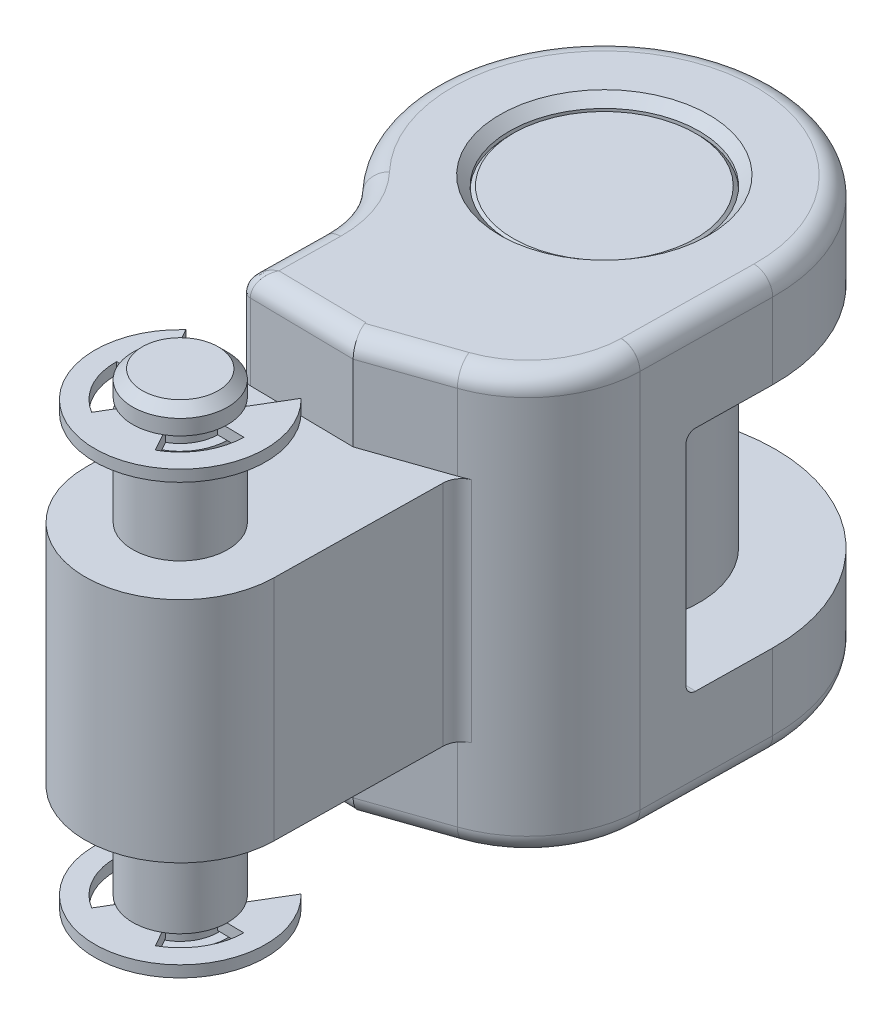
ISO-10303-21;
HEADER;
FILE_DESCRIPTION(('STEP AP214'),'2;1');
FILE_NAME('part.step','',(''),(''),'','','');
FILE_SCHEMA(('AUTOMOTIVE_DESIGN { 1 0 10303 214 1 1 1 1 }'));
ENDSEC;
DATA;
#1=APPLICATION_CONTEXT('core data for automotive mechanical design processes');
#2=APPLICATION_PROTOCOL_DEFINITION('international standard','automotive_design',2000,#1);
#3=PRODUCT_CONTEXT('',#1,'mechanical');
#4=PRODUCT('Part','Part','',(#3));
#5=PRODUCT_RELATED_PRODUCT_CATEGORY('part','',(#4));
#6=PRODUCT_DEFINITION_FORMATION('','',#4);
#7=PRODUCT_DEFINITION_CONTEXT('part definition',#1,'design');
#8=PRODUCT_DEFINITION('design','',#6,#7);
#9=PRODUCT_DEFINITION_SHAPE('','',#8);
#10=(LENGTH_UNIT() NAMED_UNIT(*) SI_UNIT(.MILLI.,.METRE.));
#11=(NAMED_UNIT(*) PLANE_ANGLE_UNIT() SI_UNIT($,.RADIAN.));
#12=(NAMED_UNIT(*) SI_UNIT($,.STERADIAN.) SOLID_ANGLE_UNIT());
#13=UNCERTAINTY_MEASURE_WITH_UNIT(LENGTH_MEASURE(1.E-05),#10,'distance_accuracy_value','');
#14=(GEOMETRIC_REPRESENTATION_CONTEXT(3) GLOBAL_UNCERTAINTY_ASSIGNED_CONTEXT((#13)) GLOBAL_UNIT_ASSIGNED_CONTEXT((#10,
#11,#12)) REPRESENTATION_CONTEXT('',''));
#15=CARTESIAN_POINT('',(0.,0.,0.));
#16=DIRECTION('',(0.,0.,1.));
#17=DIRECTION('',(1.,0.,0.));
#18=AXIS2_PLACEMENT_3D('',#15,#16,#17);
#19=CARTESIAN_POINT('',(0.789757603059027,11.,14.0134322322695));
#20=DIRECTION('',(-0.327877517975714,0.,-0.944720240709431));
#21=DIRECTION('',(-0.944720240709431,0.,0.327877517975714));
#22=AXIS2_PLACEMENT_3D('',#19,#20,#21);
#23=PLANE('',#22);
#24=DIRECTION('',(0.,1.,0.));
#25=VECTOR('',#24,1.);
#26=CARTESIAN_POINT('',(4.86355844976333,-11.000025,12.5995663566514));
#27=LINE('',#26,#25);
#28=CARTESIAN_POINT('',(4.86355844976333,6.,12.5995663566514));
#29=VERTEX_POINT('',#28);
#30=CARTESIAN_POINT('',(4.86355844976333,10.,12.5995663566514));
#31=VERTEX_POINT('',#30);
#32=EDGE_CURVE('E798',#29,#31,#27,.T.);
#33=ORIENTED_EDGE('',*,*,#32,.T.);
#34=DIRECTION('',(0.944720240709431,0.,-0.327877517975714));
#35=VECTOR('',#34,1.);
#36=CARTESIAN_POINT('',(0.789757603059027,10.,14.0134322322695));
#37=LINE('',#36,#35);
#38=CARTESIAN_POINT('',(0.789757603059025,10.,14.0134322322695));
#39=VERTEX_POINT('',#38);
#40=EDGE_CURVE('E2439',#31,#39,#37,.F.);
#41=ORIENTED_EDGE('',*,*,#40,.T.);
#42=DIRECTION('',(0.,-1.,0.));
#43=VECTOR('',#42,1.);
#44=CARTESIAN_POINT('',(0.789757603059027,11.,14.0134322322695));
#45=LINE('',#44,#43);
#46=CARTESIAN_POINT('',(0.789757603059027,6.,14.0134322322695));
#47=VERTEX_POINT('',#46);
#48=EDGE_CURVE('E666',#39,#47,#45,.T.);
#49=ORIENTED_EDGE('',*,*,#48,.T.);
#50=DIRECTION('',(0.944720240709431,0.,-0.327877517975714));
#51=VECTOR('',#50,1.);
#52=CARTESIAN_POINT('',(0.789757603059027,6.,14.0134322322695));
#53=LINE('',#52,#51);
#54=EDGE_CURVE('E656',#47,#29,#53,.T.);
#55=ORIENTED_EDGE('',*,*,#54,.T.);
#56=EDGE_LOOP('',(#33,#41,#49,#55));
#57=FACE_BOUND('',#56,.T.);
#58=ADVANCED_FACE('F14',(#57),#23,.F.);
#59=CARTESIAN_POINT('',(1.66957081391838,-11.,22.027540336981));
#60=DIRECTION('',(0.0150092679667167,0.,-0.99988735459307));
#61=DIRECTION('',(0.,-1.,0.));
#62=AXIS2_PLACEMENT_3D('',#59,#60,#61);
#63=PLANE('',#62);
#64=DIRECTION('',(0.99988735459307,0.,0.0150092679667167));
#65=VECTOR('',#64,1.);
#66=CARTESIAN_POINT('',(1.6695708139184,-11.6,22.0275403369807));
#67=LINE('',#66,#65);
#68=CARTESIAN_POINT('',(1.6695708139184,-11.6,22.0275403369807));
#69=VERTEX_POINT('',#68);
#70=CARTESIAN_POINT('',(3.06941311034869,-11.6,22.0485533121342));
#71=VERTEX_POINT('',#70);
#72=EDGE_CURVE('E2487',#69,#71,#67,.T.);
#73=ORIENTED_EDGE('',*,*,#72,.T.);
#74=DIRECTION('',(0.,-1.,0.));
#75=VECTOR('',#74,1.);
#76=CARTESIAN_POINT('',(3.06941311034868,-11.,22.0485533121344));
#77=LINE('',#76,#75);
#78=CARTESIAN_POINT('',(3.06941311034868,-11.,22.0485533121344));
#79=VERTEX_POINT('',#78);
#80=EDGE_CURVE('E1470',#79,#71,#77,.T.);
#81=ORIENTED_EDGE('',*,*,#80,.F.);
#82=DIRECTION('',(0.99988735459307,0.,0.0150092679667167));
#83=VECTOR('',#82,1.);
#84=CARTESIAN_POINT('',(1.66957081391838,-11.,22.027540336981));
#85=LINE('',#84,#83);
#86=CARTESIAN_POINT('',(2.1695144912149,-11.,22.0350449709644));
#87=VERTEX_POINT('',#86);
#88=EDGE_CURVE('E1447',#87,#79,#85,.T.);
#89=ORIENTED_EDGE('',*,*,#88,.F.);
#90=CARTESIAN_POINT('',(1.66957081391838,-11.,22.027540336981));
#91=VERTEX_POINT('',#90);
#92=EDGE_CURVE('E1411',#91,#87,#85,.T.);
#93=ORIENTED_EDGE('',*,*,#92,.F.);
#94=DIRECTION('',(0.,-1.,0.));
#95=VECTOR('',#94,1.);
#96=CARTESIAN_POINT('',(1.66957081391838,-11.,22.027540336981));
#97=LINE('',#96,#95);
#98=EDGE_CURVE('E1473',#91,#69,#97,.T.);
#99=ORIENTED_EDGE('',*,*,#98,.T.);
#100=EDGE_LOOP('',(#73,#81,#89,#93,#99));
#101=FACE_BOUND('',#100,.T.);
#102=ADVANCED_FACE('F1096',(#101),#63,.F.);
#103=CARTESIAN_POINT('',(-0.330203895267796,-11.,21.9975218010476));
#104=DIRECTION('',(0.,-1.,0.));
#105=DIRECTION('',(0.99988735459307,0.,0.0150092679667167));
#106=AXIS2_PLACEMENT_3D('',#103,#104,#105);
#107=CYLINDRICAL_SURFACE('',#106,3.4);
#108=CARTESIAN_POINT('',(-0.330203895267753,-11.6,21.9975218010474));
#109=DIRECTION('',(0.,-1.,0.));
#110=DIRECTION('',(-0.99988735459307,0.,-0.0150092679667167));
#111=AXIS2_PLACEMENT_3D('',#108,#109,#110);
#112=CIRCLE('',#111,3.4);
#113=CARTESIAN_POINT('',(1.32540978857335,-11.6,24.9671923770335));
#114=VERTEX_POINT('',#113);
#115=EDGE_CURVE('E2484',#71,#114,#112,.T.);
#116=ORIENTED_EDGE('',*,*,#115,.T.);
#117=DIRECTION('',(0.,-1.,0.));
#118=VECTOR('',#117,1.);
#119=CARTESIAN_POINT('',(1.32540978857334,-11.,24.9671923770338));
#120=LINE('',#119,#118);
#121=CARTESIAN_POINT('',(1.32540978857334,-11.,24.9671923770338));
#122=VERTEX_POINT('',#121);
#123=EDGE_CURVE('E1468',#122,#114,#120,.T.);
#124=ORIENTED_EDGE('',*,*,#123,.F.);
#125=CARTESIAN_POINT('',(-0.330203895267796,-11.,21.9975218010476));
#126=DIRECTION('',(0.,-1.,0.));
#127=DIRECTION('',(-0.99988735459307,0.,-0.0150092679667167));
#128=AXIS2_PLACEMENT_3D('',#125,#126,#127);
#129=CIRCLE('',#128,3.4);
#130=EDGE_CURVE('E1422',#79,#122,#129,.T.);
#131=ORIENTED_EDGE('',*,*,#130,.F.);
#132=ORIENTED_EDGE('',*,*,#80,.T.);
#133=EDGE_LOOP('',(#116,#124,#131,#132));
#134=FACE_BOUND('',#133,.T.);
#135=ADVANCED_FACE('F1104',(#134),#107,.F.);
#136=CARTESIAN_POINT('',(1.32540978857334,-11.,24.9671923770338));
#137=DIRECTION('',(-0.873432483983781,0.,0.486945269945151));
#138=DIRECTION('',(0.486945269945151,0.,0.873432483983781));
#139=AXIS2_PLACEMENT_3D('',#136,#137,#138);
#140=PLANE('',#139);
#141=DIRECTION('',(-0.486945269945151,0.,-0.873432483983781));
#142=VECTOR('',#141,1.);
#143=CARTESIAN_POINT('',(1.32540978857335,-11.6,24.9671923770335));
#144=LINE('',#143,#142);
#145=CARTESIAN_POINT('',(0.643686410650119,-11.6,23.7443868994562));
#146=VERTEX_POINT('',#145);
#147=EDGE_CURVE('E2480',#114,#146,#144,.T.);
#148=ORIENTED_EDGE('',*,*,#147,.T.);
#149=DIRECTION('',(0.,-1.,0.));
#150=VECTOR('',#149,1.);
#151=CARTESIAN_POINT('',(0.643686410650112,-11.,23.7443868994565));
#152=LINE('',#151,#150);
#153=CARTESIAN_POINT('',(0.643686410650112,-11.,23.7443868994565));
#154=VERTEX_POINT('',#153);
#155=EDGE_CURVE('E1466',#154,#146,#152,.T.);
#156=ORIENTED_EDGE('',*,*,#155,.F.);
#157=DIRECTION('',(-0.486945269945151,0.,-0.873432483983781));
#158=VECTOR('',#157,1.);
#159=CARTESIAN_POINT('',(1.32540978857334,-11.,24.9671923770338));
#160=LINE('',#159,#158);
#161=CARTESIAN_POINT('',(0.887159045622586,-11.,24.1811031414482));
#162=VERTEX_POINT('',#161);
#163=EDGE_CURVE('E1409',#162,#154,#160,.T.);
#164=ORIENTED_EDGE('',*,*,#163,.F.);
#165=EDGE_CURVE('E1418',#122,#162,#160,.T.);
#166=ORIENTED_EDGE('',*,*,#165,.F.);
#167=ORIENTED_EDGE('',*,*,#123,.T.);
#168=EDGE_LOOP('',(#148,#156,#164,#166,#167));
#169=FACE_BOUND('',#168,.T.);
#170=ADVANCED_FACE('F1898',(#169),#140,.F.);
#171=CARTESIAN_POINT('',(-1.3560878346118,-11.,23.7143683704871));
#172=DIRECTION('',(0.858423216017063,0.,0.512942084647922));
#173=DIRECTION('',(0.512942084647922,0.,-0.858423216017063));
#174=AXIS2_PLACEMENT_3D('',#171,#172,#173);
#175=PLANE('',#174);
#176=DIRECTION('',(-0.512942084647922,0.,0.858423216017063));
#177=VECTOR('',#176,1.);
#178=CARTESIAN_POINT('',(-1.35608783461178,-11.6,23.7143683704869));
#179=LINE('',#178,#177);
#180=CARTESIAN_POINT('',(-1.35608783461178,-11.6,23.7143683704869));
#181=VERTEX_POINT('',#180);
#182=CARTESIAN_POINT('',(-2.07420675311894,-11.6,24.9161608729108));
#183=VERTEX_POINT('',#182);
#184=EDGE_CURVE('E2473',#181,#183,#179,.T.);
#185=ORIENTED_EDGE('',*,*,#184,.T.);
#186=DIRECTION('',(0.,-1.,0.));
#187=VECTOR('',#186,1.);
#188=CARTESIAN_POINT('',(-2.0742067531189,-11.,24.916160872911));
#189=LINE('',#188,#187);
#190=CARTESIAN_POINT('',(-2.0742067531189,-11.,24.916160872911));
#191=VERTEX_POINT('',#190);
#192=EDGE_CURVE('E1461',#191,#183,#189,.T.);
#193=ORIENTED_EDGE('',*,*,#192,.F.);
#194=DIRECTION('',(-0.512942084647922,0.,0.858423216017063));
#195=VECTOR('',#194,1.);
#196=CARTESIAN_POINT('',(-1.3560878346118,-11.,23.7143683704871));
#197=LINE('',#196,#195);
#198=CARTESIAN_POINT('',(-1.61255887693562,-11.,24.1435799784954));
#199=VERTEX_POINT('',#198);
#200=EDGE_CURVE('E1426',#199,#191,#197,.T.);
#201=ORIENTED_EDGE('',*,*,#200,.F.);
#202=CARTESIAN_POINT('',(-1.3560878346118,-11.,23.7143683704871));
#203=VERTEX_POINT('',#202);
#204=EDGE_CURVE('E1428',#203,#199,#197,.T.);
#205=ORIENTED_EDGE('',*,*,#204,.F.);
#206=DIRECTION('',(0.,-1.,0.));
#207=VECTOR('',#206,1.);
#208=CARTESIAN_POINT('',(-1.3560878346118,-11.,23.7143683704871));
#209=LINE('',#208,#207);
#210=EDGE_CURVE('E1464',#203,#181,#209,.T.);
#211=ORIENTED_EDGE('',*,*,#210,.T.);
#212=EDGE_LOOP('',(#185,#193,#201,#205,#211));
#213=FACE_BOUND('',#212,.T.);
#214=ADVANCED_FACE('F1874',(#213),#175,.F.);
#215=CARTESIAN_POINT('',(-0.330203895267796,-11.,21.9975218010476));
#216=DIRECTION('',(0.,-1.,0.));
#217=DIRECTION('',(0.99988735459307,0.,0.0150092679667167));
#218=AXIS2_PLACEMENT_3D('',#215,#216,#217);
#219=CYLINDRICAL_SURFACE('',#218,3.4);
#220=CARTESIAN_POINT('',(-0.330203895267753,-11.6,21.9975218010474));
#221=DIRECTION('',(0.,-1.,0.));
#222=DIRECTION('',(0.99988735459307,0.,0.0150092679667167));
#223=AXIS2_PLACEMENT_3D('',#220,#221,#222);
#224=CIRCLE('',#223,3.4);
#225=CARTESIAN_POINT('',(-3.72982090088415,-11.6,21.9464902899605));
#226=VERTEX_POINT('',#225);
#227=EDGE_CURVE('E2470',#183,#226,#224,.T.);
#228=ORIENTED_EDGE('',*,*,#227,.T.);
#229=DIRECTION('',(0.,-1.,0.));
#230=VECTOR('',#229,1.);
#231=CARTESIAN_POINT('',(-3.72982090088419,-11.,21.9464902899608));
#232=LINE('',#231,#230);
#233=CARTESIAN_POINT('',(-3.72982090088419,-11.,21.9464902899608));
#234=VERTEX_POINT('',#233);
#235=EDGE_CURVE('E1458',#234,#226,#232,.T.);
#236=ORIENTED_EDGE('',*,*,#235,.F.);
#237=CARTESIAN_POINT('',(-0.330203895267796,-11.,21.9975218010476));
#238=DIRECTION('',(0.,-1.,0.));
#239=DIRECTION('',(0.99988735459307,0.,0.0150092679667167));
#240=AXIS2_PLACEMENT_3D('',#237,#238,#239);
#241=CIRCLE('',#240,3.4);
#242=EDGE_CURVE('E1433',#191,#234,#241,.T.);
#243=ORIENTED_EDGE('',*,*,#242,.F.);
#244=ORIENTED_EDGE('',*,*,#192,.T.);
#245=EDGE_LOOP('',(#228,#236,#243,#244));
#246=FACE_BOUND('',#245,.T.);
#247=ADVANCED_FACE('F1868',(#246),#219,.F.);
#248=CARTESIAN_POINT('',(-3.72982090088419,-11.,21.9464902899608));
#249=DIRECTION('',(0.0150092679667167,0.,-0.99988735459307));
#250=DIRECTION('',(-0.99988735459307,0.,-0.0150092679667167));
#251=AXIS2_PLACEMENT_3D('',#248,#249,#250);
#252=PLANE('',#251);
#253=DIRECTION('',(0.99988735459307,0.,0.0150092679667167));
#254=VECTOR('',#253,1.);
#255=CARTESIAN_POINT('',(-3.72982090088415,-11.6,21.9464902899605));
#256=LINE('',#255,#254);
#257=CARTESIAN_POINT('',(-2.32997860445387,-11.6,21.9675032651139));
#258=VERTEX_POINT('',#257);
#259=EDGE_CURVE('E2466',#226,#258,#256,.T.);
#260=ORIENTED_EDGE('',*,*,#259,.T.);
#261=DIRECTION('',(0.,-1.,0.));
#262=VECTOR('',#261,1.);
#263=CARTESIAN_POINT('',(-2.32997860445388,-11.,21.9675032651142));
#264=LINE('',#263,#262);
#265=CARTESIAN_POINT('',(-2.32997860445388,-11.,21.9675032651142));
#266=VERTEX_POINT('',#265);
#267=EDGE_CURVE('E1456',#266,#258,#264,.T.);
#268=ORIENTED_EDGE('',*,*,#267,.F.);
#269=DIRECTION('',(0.99988735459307,0.,0.0150092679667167));
#270=VECTOR('',#269,1.);
#271=CARTESIAN_POINT('',(-3.72982090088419,-11.,21.9464902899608));
#272=LINE('',#271,#270);
#273=CARTESIAN_POINT('',(-2.82992228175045,-11.,21.9599986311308));
#274=VERTEX_POINT('',#273);
#275=EDGE_CURVE('E1435',#274,#266,#272,.T.);
#276=ORIENTED_EDGE('',*,*,#275,.F.);
#277=EDGE_CURVE('E1436',#234,#274,#272,.T.);
#278=ORIENTED_EDGE('',*,*,#277,.F.);
#279=ORIENTED_EDGE('',*,*,#235,.T.);
#280=EDGE_LOOP('',(#260,#268,#276,#278,#279));
#281=FACE_BOUND('',#280,.T.);
#282=ADVANCED_FACE('F1873',(#281),#252,.F.);
#283=CARTESIAN_POINT('',(-2.06547410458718,-11.,21.0031188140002));
#284=DIRECTION('',(-0.873432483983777,0.,0.48694526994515));
#285=DIRECTION('',(0.48694526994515,0.,0.873432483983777));
#286=AXIS2_PLACEMENT_3D('',#283,#284,#285);
#287=PLANE('',#286);
#288=DIRECTION('',(-0.486945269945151,0.,-0.873432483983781));
#289=VECTOR('',#288,1.);
#290=CARTESIAN_POINT('',(-2.06547410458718,-11.6,21.003118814));
#291=LINE('',#290,#289);
#292=CARTESIAN_POINT('',(-2.06547410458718,-11.6,21.003118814));
#293=VERTEX_POINT('',#292);
#294=CARTESIAN_POINT('',(-3.36399961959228,-11.6,18.6739569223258));
#295=VERTEX_POINT('',#294);
#296=EDGE_CURVE('E2454',#293,#295,#291,.T.);
#297=ORIENTED_EDGE('',*,*,#296,.T.);
#298=DIRECTION('',(0.,-1.,0.));
#299=VECTOR('',#298,1.);
#300=CARTESIAN_POINT('',(-3.3639996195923,-11.,18.6739569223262));
#301=LINE('',#300,#299);
#302=CARTESIAN_POINT('',(-3.3639996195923,-11.,18.6739569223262));
#303=VERTEX_POINT('',#302);
#304=EDGE_CURVE('E1451',#303,#295,#301,.T.);
#305=ORIENTED_EDGE('',*,*,#304,.F.);
#306=DIRECTION('',(-0.486945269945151,0.,-0.873432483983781));
#307=VECTOR('',#306,1.);
#308=CARTESIAN_POINT('',(-2.06547410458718,-11.,21.0031188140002));
#309=LINE('',#308,#307);
#310=CARTESIAN_POINT('',(-2.34000938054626,-11.,20.5106855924));
#311=VERTEX_POINT('',#310);
#312=EDGE_CURVE('E1439',#311,#303,#309,.T.);
#313=ORIENTED_EDGE('',*,*,#312,.F.);
#314=CARTESIAN_POINT('',(-2.06547410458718,-11.,21.0031188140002));
#315=VERTEX_POINT('',#314);
#316=EDGE_CURVE('E1440',#315,#311,#309,.T.);
#317=ORIENTED_EDGE('',*,*,#316,.F.);
#318=DIRECTION('',(0.,-1.,0.));
#319=VECTOR('',#318,1.);
#320=CARTESIAN_POINT('',(-2.06547410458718,-11.,21.0031188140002));
#321=LINE('',#320,#319);
#322=EDGE_CURVE('E1454',#315,#293,#321,.T.);
#323=ORIENTED_EDGE('',*,*,#322,.T.);
#324=EDGE_LOOP('',(#297,#305,#313,#317,#323));
#325=FACE_BOUND('',#324,.T.);
#326=ADVANCED_FACE('F1887',(#325),#287,.F.);
#327=CARTESIAN_POINT('',(-0.330203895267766,-11.,21.9975218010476));
#328=DIRECTION('',(0.,-1.,0.));
#329=DIRECTION('',(0.99988735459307,0.,0.0150092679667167));
#330=AXIS2_PLACEMENT_3D('',#327,#328,#329);
#331=CYLINDRICAL_SURFACE('',#330,4.5);
#332=CARTESIAN_POINT('',(-0.330203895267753,-11.6,21.9975218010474));
#333=DIRECTION('',(0.,1.,0.));
#334=DIRECTION('',(0.0150092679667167,0.,-0.99988735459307));
#335=AXIS2_PLACEMENT_3D('',#332,#333,#334);
#336=CIRCLE('',#335,4.5);
#337=CARTESIAN_POINT('',(2.80198224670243,-11.6,18.7665142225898));
#338=VERTEX_POINT('',#337);
#339=EDGE_CURVE('E2452',#295,#338,#336,.T.);
#340=ORIENTED_EDGE('',*,*,#339,.T.);
#341=DIRECTION('',(0.,-1.,0.));
#342=VECTOR('',#341,1.);
#343=CARTESIAN_POINT('',(2.80198224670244,-11.,18.7665142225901));
#344=LINE('',#343,#342);
#345=CARTESIAN_POINT('',(2.80198224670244,-11.,18.7665142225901));
#346=VERTEX_POINT('',#345);
#347=EDGE_CURVE('E1444',#346,#338,#344,.T.);
#348=ORIENTED_EDGE('',*,*,#347,.F.);
#349=CARTESIAN_POINT('',(-0.330203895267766,-11.,21.9975218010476));
#350=DIRECTION('',(0.,1.,0.));
#351=DIRECTION('',(0.0150092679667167,0.,-0.99988735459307));
#352=AXIS2_PLACEMENT_3D('',#349,#350,#351);
#353=CIRCLE('',#352,4.5);
#354=EDGE_CURVE('E1442',#303,#346,#353,.T.);
#355=ORIENTED_EDGE('',*,*,#354,.F.);
#356=ORIENTED_EDGE('',*,*,#304,.T.);
#357=EDGE_LOOP('',(#340,#348,#355,#356));
#358=FACE_BOUND('',#357,.T.);
#359=ADVANCED_FACE('F1930',(#358),#331,.T.);
#360=CARTESIAN_POINT('',(1.43413163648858,-11.,21.0556512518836));
#361=DIRECTION('',(0.858423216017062,0.,0.512942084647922));
#362=DIRECTION('',(0.512942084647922,0.,-0.858423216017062));
#363=AXIS2_PLACEMENT_3D('',#360,#361,#362);
#364=PLANE('',#363);
#365=DIRECTION('',(-0.512942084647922,0.,0.858423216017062));
#366=VECTOR('',#365,1.);
#367=CARTESIAN_POINT('',(1.4341316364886,-11.6,21.0556512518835));
#368=LINE('',#367,#366);
#369=CARTESIAN_POINT('',(1.4341316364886,-11.6,21.0556512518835));
#370=VERTEX_POINT('',#369);
#371=EDGE_CURVE('E1579',#338,#370,#368,.T.);
#372=ORIENTED_EDGE('',*,*,#371,.T.);
#373=DIRECTION('',(0.,-1.,0.));
#374=VECTOR('',#373,1.);
#375=CARTESIAN_POINT('',(1.43413163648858,-11.,21.0556512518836));
#376=LINE('',#375,#374);
#377=CARTESIAN_POINT('',(1.43413163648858,-11.,21.0556512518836));
#378=VERTEX_POINT('',#377);
#379=EDGE_CURVE('E1475',#378,#370,#376,.T.);
#380=ORIENTED_EDGE('',*,*,#379,.F.);
#381=DIRECTION('',(-0.512942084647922,0.,0.858423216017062));
#382=VECTOR('',#381,1.);
#383=CARTESIAN_POINT('',(1.43413163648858,-11.,21.0556512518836));
#384=LINE('',#383,#382);
#385=CARTESIAN_POINT('',(1.72332367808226,-11.,20.5716801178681));
#386=VERTEX_POINT('',#385);
#387=EDGE_CURVE('E1448',#386,#378,#384,.T.);
#388=ORIENTED_EDGE('',*,*,#387,.F.);
#389=EDGE_CURVE('E1445',#346,#386,#384,.T.);
#390=ORIENTED_EDGE('',*,*,#389,.F.);
#391=ORIENTED_EDGE('',*,*,#347,.T.);
#392=EDGE_LOOP('',(#372,#380,#388,#390,#391));
#393=FACE_BOUND('',#392,.T.);
#394=ADVANCED_FACE('F1925',(#393),#364,.F.);
#395=CARTESIAN_POINT('',(-0.330203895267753,-11.6,21.9975218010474));
#396=DIRECTION('',(0.,-1.,0.));
#397=DIRECTION('',(0.99988735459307,0.,0.0150092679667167));
#398=AXIS2_PLACEMENT_3D('',#395,#396,#397);
#399=PLANE('',#398);
#400=ORIENTED_EDGE('',*,*,#371,.F.);
#401=ORIENTED_EDGE('',*,*,#339,.F.);
#402=ORIENTED_EDGE('',*,*,#296,.F.);
#403=CARTESIAN_POINT('',(-0.330203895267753,-11.6,21.9975218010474));
#404=DIRECTION('',(0.,-1.,0.));
#405=DIRECTION('',(-0.99988735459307,0.,-0.0150092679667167));
#406=AXIS2_PLACEMENT_3D('',#403,#404,#405);
#407=CIRCLE('',#406,2.);
#408=EDGE_CURVE('E2460',#258,#293,#407,.T.);
#409=ORIENTED_EDGE('',*,*,#408,.F.);
#410=ORIENTED_EDGE('',*,*,#259,.F.);
#411=ORIENTED_EDGE('',*,*,#227,.F.);
#412=ORIENTED_EDGE('',*,*,#184,.F.);
#413=CARTESIAN_POINT('',(-0.330203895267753,-11.6,21.9975218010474));
#414=DIRECTION('',(0.,-1.,0.));
#415=DIRECTION('',(-0.99988735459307,0.,-0.0150092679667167));
#416=AXIS2_PLACEMENT_3D('',#413,#414,#415);
#417=CIRCLE('',#416,2.);
#418=EDGE_CURVE('E2476',#146,#181,#417,.T.);
#419=ORIENTED_EDGE('',*,*,#418,.F.);
#420=ORIENTED_EDGE('',*,*,#147,.F.);
#421=ORIENTED_EDGE('',*,*,#115,.F.);
#422=ORIENTED_EDGE('',*,*,#72,.F.);
#423=CARTESIAN_POINT('',(-0.330203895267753,-11.6,21.9975218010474));
#424=DIRECTION('',(0.,-1.,0.));
#425=DIRECTION('',(-0.99988735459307,0.,-0.0150092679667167));
#426=AXIS2_PLACEMENT_3D('',#423,#424,#425);
#427=CIRCLE('',#426,2.);
#428=EDGE_CURVE('E1583',#370,#69,#427,.T.);
#429=ORIENTED_EDGE('',*,*,#428,.F.);
#430=EDGE_LOOP('',(#400,#401,#402,#409,#410,#411,#412,#419,#420,#421,#422,#429));
#431=FACE_BOUND('',#430,.T.);
#432=ADVANCED_FACE('F520',(#431),#399,.T.);
#433=CARTESIAN_POINT('',(-0.330203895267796,-11.,21.9975218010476));
#434=DIRECTION('',(0.,-1.,0.));
#435=DIRECTION('',(0.99988735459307,0.,0.0150092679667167));
#436=AXIS2_PLACEMENT_3D('',#433,#434,#435);
#437=PLANE('',#436);
#438=CARTESIAN_POINT('',(-0.330203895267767,-11.,21.9975218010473));
#439=DIRECTION('',(0.,-1.,0.));
#440=DIRECTION('',(-1.,0.,0.));
#441=AXIS2_PLACEMENT_3D('',#438,#439,#440);
#442=CIRCLE('',#441,2.5);
#443=EDGE_CURVE('E1419',#199,#162,#442,.F.);
#444=ORIENTED_EDGE('',*,*,#443,.F.);
#445=ORIENTED_EDGE('',*,*,#200,.T.);
#446=ORIENTED_EDGE('',*,*,#242,.T.);
#447=ORIENTED_EDGE('',*,*,#277,.T.);
#448=EDGE_CURVE('E1477',#311,#274,#442,.F.);
#449=ORIENTED_EDGE('',*,*,#448,.F.);
#450=ORIENTED_EDGE('',*,*,#312,.T.);
#451=ORIENTED_EDGE('',*,*,#354,.T.);
#452=ORIENTED_EDGE('',*,*,#389,.T.);
#453=EDGE_CURVE('E1480',#87,#386,#442,.F.);
#454=ORIENTED_EDGE('',*,*,#453,.F.);
#455=ORIENTED_EDGE('',*,*,#88,.T.);
#456=ORIENTED_EDGE('',*,*,#130,.T.);
#457=ORIENTED_EDGE('',*,*,#165,.T.);
#458=EDGE_LOOP('',(#444,#445,#446,#447,#449,#450,#451,#452,#454,#455,#456,#457));
#459=FACE_BOUND('',#458,.T.);
#460=ADVANCED_FACE('F517',(#459),#437,.F.);
#461=CARTESIAN_POINT('',(-0.330203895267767,13.,21.9975218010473));
#462=DIRECTION('',(0.,1.,0.));
#463=DIRECTION('',(0.,0.,1.));
#464=AXIS2_PLACEMENT_3D('',#461,#462,#463);
#465=PLANE('',#464);
#466=CARTESIAN_POINT('',(-0.330203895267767,13.,21.9975218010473));
#467=DIRECTION('',(0.,1.,0.));
#468=DIRECTION('',(0.,0.,1.));
#469=AXIS2_PLACEMENT_3D('',#466,#467,#468);
#470=CIRCLE('',#469,2.);
#471=CARTESIAN_POINT('',(-0.330203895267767,13.,23.9975218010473));
#472=VERTEX_POINT('',#471);
#473=EDGE_CURVE('E1319',#472,#472,#470,.T.);
#474=ORIENTED_EDGE('',*,*,#473,.T.);
#475=EDGE_LOOP('',(#474));
#476=FACE_BOUND('',#475,.T.);
#477=ADVANCED_FACE('F1139',(#476),#465,.T.);
#478=CARTESIAN_POINT('',(-0.330203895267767,13.,21.9975218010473));
#479=DIRECTION('',(0.,-1.,0.));
#480=DIRECTION('',(0.,0.,-1.));
#481=AXIS2_PLACEMENT_3D('',#478,#479,#480);
#482=CONICAL_SURFACE('',#481,2.,0.785398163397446);
#483=CARTESIAN_POINT('',(-0.330203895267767,12.5,21.9975218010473));
#484=DIRECTION('',(0.,1.,0.));
#485=DIRECTION('',(0.,0.,1.));
#486=AXIS2_PLACEMENT_3D('',#483,#484,#485);
#487=CIRCLE('',#486,2.5);
#488=CARTESIAN_POINT('',(-0.330203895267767,12.5,24.4975218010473));
#489=VERTEX_POINT('',#488);
#490=EDGE_CURVE('E1312',#489,#489,#487,.F.);
#491=ORIENTED_EDGE('',*,*,#490,.F.);
#492=EDGE_LOOP('',(#491));
#493=FACE_BOUND('',#492,.T.);
#494=ORIENTED_EDGE('',*,*,#473,.F.);
#495=EDGE_LOOP('',(#494));
#496=FACE_BOUND('',#495,.T.);
#497=ADVANCED_FACE('F1152',(#493,#496),#482,.T.);
#498=CARTESIAN_POINT('',(-0.330203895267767,13.,21.9975218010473));
#499=DIRECTION('',(0.,-1.,0.));
#500=DIRECTION('',(0.,0.,-1.));
#501=AXIS2_PLACEMENT_3D('',#498,#499,#500);
#502=CYLINDRICAL_SURFACE('',#501,2.5);
#503=ORIENTED_EDGE('',*,*,#490,.T.);
#504=EDGE_LOOP('',(#503));
#505=FACE_BOUND('',#504,.T.);
#506=CARTESIAN_POINT('',(-0.330203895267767,11.7,21.9975218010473));
#507=DIRECTION('',(0.,-1.,0.));
#508=DIRECTION('',(0.,0.,-1.));
#509=AXIS2_PLACEMENT_3D('',#506,#507,#508);
#510=CIRCLE('',#509,2.5);
#511=CARTESIAN_POINT('',(-0.330203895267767,11.7,19.4975218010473));
#512=VERTEX_POINT('',#511);
#513=EDGE_CURVE('E1300',#512,#512,#510,.T.);
#514=ORIENTED_EDGE('',*,*,#513,.F.);
#515=EDGE_LOOP('',(#514));
#516=FACE_BOUND('',#515,.T.);
#517=ADVANCED_FACE('F1155',(#505,#516),#502,.T.);
#518=CARTESIAN_POINT('',(0.,10.5,0.));
#519=DIRECTION('',(0.,1.,0.));
#520=DIRECTION('',(-0.999887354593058,0.,-0.0150092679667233));
#521=AXIS2_PLACEMENT_3D('',#518,#519,#520);
#522=PLANE('',#521);
#523=CARTESIAN_POINT('',(0.,10.5,0.));
#524=DIRECTION('',(0.,1.,0.));
#525=DIRECTION('',(-0.999887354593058,0.,-0.0150092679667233));
#526=AXIS2_PLACEMENT_3D('',#523,#524,#525);
#527=CIRCLE('',#526,4.8);
#528=CARTESIAN_POINT('',(-4.79945930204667,10.5,-0.0720444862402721));
#529=VERTEX_POINT('',#528);
#530=EDGE_CURVE('E1005',#529,#529,#527,.T.);
#531=ORIENTED_EDGE('',*,*,#530,.T.);
#532=EDGE_LOOP('',(#531));
#533=FACE_BOUND('',#532,.T.);
#534=ADVANCED_FACE('F602',(#533),#522,.T.);
#535=CARTESIAN_POINT('',(0.,-10.5,0.));
#536=DIRECTION('',(0.,1.,0.));
#537=DIRECTION('',(-0.999887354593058,0.,-0.0150092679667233));
#538=AXIS2_PLACEMENT_3D('',#535,#536,#537);
#539=PLANE('',#538);
#540=CARTESIAN_POINT('',(0.,-10.5,0.));
#541=DIRECTION('',(0.,1.,0.));
#542=DIRECTION('',(-0.999887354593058,0.,-0.0150092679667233));
#543=AXIS2_PLACEMENT_3D('',#540,#541,#542);
#544=CIRCLE('',#543,4.8);
#545=CARTESIAN_POINT('',(-4.79945930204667,-10.5,-0.0720444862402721));
#546=VERTEX_POINT('',#545);
#547=EDGE_CURVE('E997',#546,#546,#544,.F.);
#548=ORIENTED_EDGE('',*,*,#547,.T.);
#549=EDGE_LOOP('',(#548));
#550=FACE_BOUND('',#549,.T.);
#551=ADVANCED_FACE('F1137',(#550),#539,.F.);
#552=CARTESIAN_POINT('',(2.16979610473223,11.7,21.9975218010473));
#553=DIRECTION('',(0.,-1.,0.));
#554=DIRECTION('',(0.,0.,-1.));
#555=AXIS2_PLACEMENT_3D('',#552,#553,#554);
#556=PLANE('',#555);
#557=ORIENTED_EDGE('',*,*,#513,.T.);
#558=EDGE_LOOP('',(#557));
#559=FACE_BOUND('',#558,.T.);
#560=CARTESIAN_POINT('',(-0.330203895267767,11.7,21.9975218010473));
#561=DIRECTION('',(0.,-1.,0.));
#562=DIRECTION('',(0.,0.,-1.));
#563=AXIS2_PLACEMENT_3D('',#560,#561,#562);
#564=CIRCLE('',#563,2.);
#565=CARTESIAN_POINT('',(-0.330203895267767,11.7,19.9975218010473));
#566=VERTEX_POINT('',#565);
#567=EDGE_CURVE('E1303',#566,#566,#564,.T.);
#568=ORIENTED_EDGE('',*,*,#567,.F.);
#569=EDGE_LOOP('',(#568));
#570=FACE_BOUND('',#569,.T.);
#571=ADVANCED_FACE('F1133',(#559,#570),#556,.T.);
#572=CARTESIAN_POINT('',(-0.330203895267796,11.6,21.9975218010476));
#573=DIRECTION('',(0.,-1.,0.));
#574=DIRECTION('',(0.99988735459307,0.,0.0150092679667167));
#575=AXIS2_PLACEMENT_3D('',#572,#573,#574);
#576=PLANE('',#575);
#577=DIRECTION('',(-0.512942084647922,0.,0.858423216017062));
#578=VECTOR('',#577,1.);
#579=CARTESIAN_POINT('',(1.43413163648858,11.6,21.0556512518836));
#580=LINE('',#579,#578);
#581=CARTESIAN_POINT('',(2.80198224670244,11.6,18.7665142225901));
#582=VERTEX_POINT('',#581);
#583=CARTESIAN_POINT('',(1.43413163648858,11.6,21.0556512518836));
#584=VERTEX_POINT('',#583);
#585=EDGE_CURVE('E1346',#582,#584,#580,.T.);
#586=ORIENTED_EDGE('',*,*,#585,.T.);
#587=CARTESIAN_POINT('',(-0.330203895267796,11.6,21.9975218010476));
#588=DIRECTION('',(0.,-1.,0.));
#589=DIRECTION('',(-0.99988735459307,0.,-0.0150092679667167));
#590=AXIS2_PLACEMENT_3D('',#587,#588,#589);
#591=CIRCLE('',#590,2.);
#592=CARTESIAN_POINT('',(1.66957081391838,11.6,22.027540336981));
#593=VERTEX_POINT('',#592);
#594=EDGE_CURVE('E1343',#584,#593,#591,.T.);
#595=ORIENTED_EDGE('',*,*,#594,.T.);
#596=DIRECTION('',(0.99988735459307,0.,0.0150092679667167));
#597=VECTOR('',#596,1.);
#598=CARTESIAN_POINT('',(1.66957081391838,11.6,22.027540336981));
#599=LINE('',#598,#597);
#600=CARTESIAN_POINT('',(3.06941311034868,11.6,22.0485533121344));
#601=VERTEX_POINT('',#600);
#602=EDGE_CURVE('E1345',#593,#601,#599,.T.);
#603=ORIENTED_EDGE('',*,*,#602,.T.);
#604=CARTESIAN_POINT('',(-0.330203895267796,11.6,21.9975218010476));
#605=DIRECTION('',(0.,-1.,0.));
#606=DIRECTION('',(-0.99988735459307,0.,-0.0150092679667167));
#607=AXIS2_PLACEMENT_3D('',#604,#605,#606);
#608=CIRCLE('',#607,3.4);
#609=CARTESIAN_POINT('',(1.32540978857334,11.6,24.9671923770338));
#610=VERTEX_POINT('',#609);
#611=EDGE_CURVE('E1348',#601,#610,#608,.T.);
#612=ORIENTED_EDGE('',*,*,#611,.T.);
#613=DIRECTION('',(-0.486945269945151,0.,-0.873432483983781));
#614=VECTOR('',#613,1.);
#615=CARTESIAN_POINT('',(1.32540978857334,11.6,24.9671923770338));
#616=LINE('',#615,#614);
#617=CARTESIAN_POINT('',(0.643686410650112,11.6,23.7443868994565));
#618=VERTEX_POINT('',#617);
#619=EDGE_CURVE('E1350',#610,#618,#616,.T.);
#620=ORIENTED_EDGE('',*,*,#619,.T.);
#621=CARTESIAN_POINT('',(-0.330203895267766,11.6,21.9975218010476));
#622=DIRECTION('',(0.,-1.,0.));
#623=DIRECTION('',(-0.99988735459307,0.,-0.0150092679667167));
#624=AXIS2_PLACEMENT_3D('',#621,#622,#623);
#625=CIRCLE('',#624,2.);
#626=CARTESIAN_POINT('',(-1.3560878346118,11.6,23.7143683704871));
#627=VERTEX_POINT('',#626);
#628=EDGE_CURVE('E1353',#618,#627,#625,.T.);
#629=ORIENTED_EDGE('',*,*,#628,.T.);
#630=DIRECTION('',(-0.512942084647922,0.,0.858423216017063));
#631=VECTOR('',#630,1.);
#632=CARTESIAN_POINT('',(-1.3560878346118,11.6,23.7143683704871));
#633=LINE('',#632,#631);
#634=CARTESIAN_POINT('',(-2.0742067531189,11.6,24.916160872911));
#635=VERTEX_POINT('',#634);
#636=EDGE_CURVE('E1355',#627,#635,#633,.T.);
#637=ORIENTED_EDGE('',*,*,#636,.T.);
#638=CARTESIAN_POINT('',(-0.330203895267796,11.6,21.9975218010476));
#639=DIRECTION('',(0.,-1.,0.));
#640=DIRECTION('',(0.99988735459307,0.,0.0150092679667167));
#641=AXIS2_PLACEMENT_3D('',#638,#639,#640);
#642=CIRCLE('',#641,3.4);
#643=CARTESIAN_POINT('',(-3.72982090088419,11.6,21.9464902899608));
#644=VERTEX_POINT('',#643);
#645=EDGE_CURVE('E1357',#635,#644,#642,.T.);
#646=ORIENTED_EDGE('',*,*,#645,.T.);
#647=DIRECTION('',(0.99988735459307,0.,0.0150092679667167));
#648=VECTOR('',#647,1.);
#649=CARTESIAN_POINT('',(-3.72982090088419,11.6,21.9464902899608));
#650=LINE('',#649,#648);
#651=CARTESIAN_POINT('',(-2.32997860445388,11.6,21.9675032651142));
#652=VERTEX_POINT('',#651);
#653=EDGE_CURVE('E1359',#644,#652,#650,.T.);
#654=ORIENTED_EDGE('',*,*,#653,.T.);
#655=CARTESIAN_POINT('',(-0.330203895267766,11.6,21.9975218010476));
#656=DIRECTION('',(0.,-1.,0.));
#657=DIRECTION('',(-0.99988735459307,0.,-0.0150092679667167));
#658=AXIS2_PLACEMENT_3D('',#655,#656,#657);
#659=CIRCLE('',#658,2.);
#660=CARTESIAN_POINT('',(-2.06547410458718,11.6,21.0031188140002));
#661=VERTEX_POINT('',#660);
#662=EDGE_CURVE('E1362',#652,#661,#659,.T.);
#663=ORIENTED_EDGE('',*,*,#662,.T.);
#664=DIRECTION('',(-0.486945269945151,0.,-0.873432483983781));
#665=VECTOR('',#664,1.);
#666=CARTESIAN_POINT('',(-2.06547410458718,11.6,21.0031188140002));
#667=LINE('',#666,#665);
#668=CARTESIAN_POINT('',(-3.3639996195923,11.6,18.6739569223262));
#669=VERTEX_POINT('',#668);
#670=EDGE_CURVE('E1364',#661,#669,#667,.T.);
#671=ORIENTED_EDGE('',*,*,#670,.T.);
#672=CARTESIAN_POINT('',(-0.330203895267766,11.6,21.9975218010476));
#673=DIRECTION('',(0.,1.,0.));
#674=DIRECTION('',(0.0150092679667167,0.,-0.99988735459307));
#675=AXIS2_PLACEMENT_3D('',#672,#673,#674);
#676=CIRCLE('',#675,4.5);
#677=EDGE_CURVE('E1366',#669,#582,#676,.T.);
#678=ORIENTED_EDGE('',*,*,#677,.T.);
#679=EDGE_LOOP('',(#586,#595,#603,#612,#620,#629,#637,#646,#654,#663,#671,#678));
#680=FACE_BOUND('',#679,.T.);
#681=ADVANCED_FACE('F1136',(#680),#576,.F.);
#682=CARTESIAN_POINT('',(0.,10.5,0.));
#683=DIRECTION('',(0.,-1.,0.));
#684=DIRECTION('',(0.999887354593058,0.,0.0150092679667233));
#685=AXIS2_PLACEMENT_3D('',#682,#683,#684);
#686=CONICAL_SURFACE('',#685,4.8,0.785398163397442);
#687=CARTESIAN_POINT('',(0.,10.3,0.));
#688=DIRECTION('',(0.,1.,0.));
#689=DIRECTION('',(-0.999887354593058,0.,-0.0150092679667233));
#690=AXIS2_PLACEMENT_3D('',#687,#688,#689);
#691=CIRCLE('',#690,5.);
#692=CARTESIAN_POINT('',(-4.99943677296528,10.3,-0.0750463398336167));
#693=VERTEX_POINT('',#692);
#694=EDGE_CURVE('E990',#693,#693,#691,.F.);
#695=ORIENTED_EDGE('',*,*,#694,.F.);
#696=EDGE_LOOP('',(#695));
#697=FACE_BOUND('',#696,.T.);
#698=ORIENTED_EDGE('',*,*,#530,.F.);
#699=EDGE_LOOP('',(#698));
#700=FACE_BOUND('',#699,.T.);
#701=ADVANCED_FACE('F1169',(#697,#700),#686,.T.);
#702=CARTESIAN_POINT('',(0.,-10.3,0.));
#703=DIRECTION('',(0.,1.,0.));
#704=DIRECTION('',(-0.999887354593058,0.,-0.0150092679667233));
#705=AXIS2_PLACEMENT_3D('',#702,#703,#704);
#706=CONICAL_SURFACE('',#705,5.,0.785398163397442);
#707=ORIENTED_EDGE('',*,*,#547,.F.);
#708=EDGE_LOOP('',(#707));
#709=FACE_BOUND('',#708,.T.);
#710=CARTESIAN_POINT('',(0.,-10.3,0.));
#711=DIRECTION('',(0.,1.,0.));
#712=DIRECTION('',(-0.999887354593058,0.,-0.0150092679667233));
#713=AXIS2_PLACEMENT_3D('',#710,#711,#712);
#714=CIRCLE('',#713,5.);
#715=CARTESIAN_POINT('',(-4.99943677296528,-10.3,-0.0750463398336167));
#716=VERTEX_POINT('',#715);
#717=EDGE_CURVE('E992',#716,#716,#714,.T.);
#718=ORIENTED_EDGE('',*,*,#717,.F.);
#719=EDGE_LOOP('',(#718));
#720=FACE_BOUND('',#719,.T.);
#721=ADVANCED_FACE('F1144',(#709,#720),#706,.T.);
#722=CARTESIAN_POINT('',(-0.330203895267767,0.,21.9975218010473));
#723=DIRECTION('',(0.,-1.,0.));
#724=DIRECTION('',(0.,0.,-1.));
#725=AXIS2_PLACEMENT_3D('',#722,#723,#724);
#726=CYLINDRICAL_SURFACE('',#725,2.);
#727=ORIENTED_EDGE('',*,*,#662,.F.);
#728=DIRECTION('',(0.,-1.,0.));
#729=VECTOR('',#728,1.);
#730=CARTESIAN_POINT('',(-2.32997860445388,11.6,21.9675032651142));
#731=LINE('',#730,#729);
#732=CARTESIAN_POINT('',(-2.32997860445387,11.,21.9675032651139));
#733=VERTEX_POINT('',#732);
#734=EDGE_CURVE('E1378',#652,#733,#731,.T.);
#735=ORIENTED_EDGE('',*,*,#734,.T.);
#736=CARTESIAN_POINT('',(-0.330203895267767,11.,21.9975218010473));
#737=DIRECTION('',(0.,-1.,0.));
#738=DIRECTION('',(0.,0.,-1.));
#739=AXIS2_PLACEMENT_3D('',#736,#737,#738);
#740=CIRCLE('',#739,2.);
#741=CARTESIAN_POINT('',(-1.35608783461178,11.,23.7143683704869));
#742=VERTEX_POINT('',#741);
#743=EDGE_CURVE('E1310',#742,#733,#740,.T.);
#744=ORIENTED_EDGE('',*,*,#743,.F.);
#745=DIRECTION('',(0.,-1.,0.));
#746=VECTOR('',#745,1.);
#747=CARTESIAN_POINT('',(-1.3560878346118,11.6,23.7143683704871));
#748=LINE('',#747,#746);
#749=EDGE_CURVE('E1386',#627,#742,#748,.T.);
#750=ORIENTED_EDGE('',*,*,#749,.F.);
#751=ORIENTED_EDGE('',*,*,#628,.F.);
#752=DIRECTION('',(0.,-1.,0.));
#753=VECTOR('',#752,1.);
#754=CARTESIAN_POINT('',(0.643686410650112,11.6,23.7443868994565));
#755=LINE('',#754,#753);
#756=CARTESIAN_POINT('',(0.643686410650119,11.,23.7443868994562));
#757=VERTEX_POINT('',#756);
#758=EDGE_CURVE('E1388',#618,#757,#755,.T.);
#759=ORIENTED_EDGE('',*,*,#758,.T.);
#760=CARTESIAN_POINT('',(1.6695708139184,11.,22.0275403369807));
#761=VERTEX_POINT('',#760);
#762=EDGE_CURVE('E1311',#761,#757,#740,.T.);
#763=ORIENTED_EDGE('',*,*,#762,.F.);
#764=DIRECTION('',(0.,-1.,0.));
#765=VECTOR('',#764,1.);
#766=CARTESIAN_POINT('',(1.66957081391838,11.6,22.027540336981));
#767=LINE('',#766,#765);
#768=EDGE_CURVE('E1396',#593,#761,#767,.T.);
#769=ORIENTED_EDGE('',*,*,#768,.F.);
#770=ORIENTED_EDGE('',*,*,#594,.F.);
#771=DIRECTION('',(0.,-1.,0.));
#772=VECTOR('',#771,1.);
#773=CARTESIAN_POINT('',(1.43413163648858,11.6,21.0556512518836));
#774=LINE('',#773,#772);
#775=CARTESIAN_POINT('',(1.4341316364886,11.,21.0556512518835));
#776=VERTEX_POINT('',#775);
#777=EDGE_CURVE('E1398',#584,#776,#774,.T.);
#778=ORIENTED_EDGE('',*,*,#777,.T.);
#779=CARTESIAN_POINT('',(-2.06547410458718,11.,21.003118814));
#780=VERTEX_POINT('',#779);
#781=EDGE_CURVE('E1307',#780,#776,#740,.T.);
#782=ORIENTED_EDGE('',*,*,#781,.F.);
#783=DIRECTION('',(0.,-1.,0.));
#784=VECTOR('',#783,1.);
#785=CARTESIAN_POINT('',(-2.06547410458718,11.6,21.0031188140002));
#786=LINE('',#785,#784);
#787=EDGE_CURVE('E1376',#661,#780,#786,.T.);
#788=ORIENTED_EDGE('',*,*,#787,.F.);
#789=EDGE_LOOP('',(#727,#735,#744,#750,#751,#759,#763,#769,#770,#778,#782,#788));
#790=FACE_BOUND('',#789,.T.);
#791=ORIENTED_EDGE('',*,*,#567,.T.);
#792=EDGE_LOOP('',(#791));
#793=FACE_BOUND('',#792,.T.);
#794=ADVANCED_FACE('F1140',(#790,#793),#726,.T.);
#795=CARTESIAN_POINT('',(1.66957081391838,11.6,22.027540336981));
#796=DIRECTION('',(0.0150092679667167,0.,-0.99988735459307));
#797=DIRECTION('',(0.,-1.,0.));
#798=AXIS2_PLACEMENT_3D('',#795,#796,#797);
#799=PLANE('',#798);
#800=DIRECTION('',(0.99988735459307,0.,0.0150092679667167));
#801=VECTOR('',#800,1.);
#802=CARTESIAN_POINT('',(1.6695708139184,11.,22.0275403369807));
#803=LINE('',#802,#801);
#804=CARTESIAN_POINT('',(2.16951449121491,11.,22.0350449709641));
#805=VERTEX_POINT('',#804);
#806=EDGE_CURVE('E1481',#761,#805,#803,.T.);
#807=ORIENTED_EDGE('',*,*,#806,.T.);
#808=CARTESIAN_POINT('',(3.06941311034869,11.,22.0485533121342));
#809=VERTEX_POINT('',#808);
#810=EDGE_CURVE('E1338',#805,#809,#803,.T.);
#811=ORIENTED_EDGE('',*,*,#810,.T.);
#812=DIRECTION('',(0.,-1.,0.));
#813=VECTOR('',#812,1.);
#814=CARTESIAN_POINT('',(3.06941311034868,11.6,22.0485533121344));
#815=LINE('',#814,#813);
#816=EDGE_CURVE('E1393',#601,#809,#815,.T.);
#817=ORIENTED_EDGE('',*,*,#816,.F.);
#818=ORIENTED_EDGE('',*,*,#602,.F.);
#819=ORIENTED_EDGE('',*,*,#768,.T.);
#820=EDGE_LOOP('',(#807,#811,#817,#818,#819));
#821=FACE_BOUND('',#820,.T.);
#822=ADVANCED_FACE('F1143',(#821),#799,.F.);
#823=CARTESIAN_POINT('',(-0.330203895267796,11.6,21.9975218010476));
#824=DIRECTION('',(0.,-1.,0.));
#825=DIRECTION('',(0.99988735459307,0.,0.0150092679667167));
#826=AXIS2_PLACEMENT_3D('',#823,#824,#825);
#827=CYLINDRICAL_SURFACE('',#826,3.4);
#828=CARTESIAN_POINT('',(-0.330203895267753,11.,21.9975218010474));
#829=DIRECTION('',(0.,-1.,0.));
#830=DIRECTION('',(-0.99988735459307,0.,-0.0150092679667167));
#831=AXIS2_PLACEMENT_3D('',#828,#829,#830);
#832=CIRCLE('',#831,3.4);
#833=CARTESIAN_POINT('',(1.32540978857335,11.,24.9671923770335));
#834=VERTEX_POINT('',#833);
#835=EDGE_CURVE('E1484',#809,#834,#832,.T.);
#836=ORIENTED_EDGE('',*,*,#835,.T.);
#837=DIRECTION('',(0.,-1.,0.));
#838=VECTOR('',#837,1.);
#839=CARTESIAN_POINT('',(1.32540978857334,11.6,24.9671923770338));
#840=LINE('',#839,#838);
#841=EDGE_CURVE('E1390',#610,#834,#840,.T.);
#842=ORIENTED_EDGE('',*,*,#841,.F.);
#843=ORIENTED_EDGE('',*,*,#611,.F.);
#844=ORIENTED_EDGE('',*,*,#816,.T.);
#845=EDGE_LOOP('',(#836,#842,#843,#844));
#846=FACE_BOUND('',#845,.T.);
#847=ADVANCED_FACE('F1253',(#846),#827,.F.);
#848=CARTESIAN_POINT('',(1.32540978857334,11.6,24.9671923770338));
#849=DIRECTION('',(-0.873432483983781,0.,0.486945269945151));
#850=DIRECTION('',(0.486945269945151,0.,0.873432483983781));
#851=AXIS2_PLACEMENT_3D('',#848,#849,#850);
#852=PLANE('',#851);
#853=DIRECTION('',(-0.486945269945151,0.,-0.873432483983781));
#854=VECTOR('',#853,1.);
#855=CARTESIAN_POINT('',(1.32540978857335,11.,24.9671923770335));
#856=LINE('',#855,#854);
#857=CARTESIAN_POINT('',(0.88715904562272,11.,24.1811031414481));
#858=VERTEX_POINT('',#857);
#859=EDGE_CURVE('E1488',#834,#858,#856,.T.);
#860=ORIENTED_EDGE('',*,*,#859,.T.);
#861=EDGE_CURVE('E1487',#858,#757,#856,.T.);
#862=ORIENTED_EDGE('',*,*,#861,.T.);
#863=ORIENTED_EDGE('',*,*,#758,.F.);
#864=ORIENTED_EDGE('',*,*,#619,.F.);
#865=ORIENTED_EDGE('',*,*,#841,.T.);
#866=EDGE_LOOP('',(#860,#862,#863,#864,#865));
#867=FACE_BOUND('',#866,.T.);
#868=ADVANCED_FACE('F1549',(#867),#852,.F.);
#869=CARTESIAN_POINT('',(-1.3560878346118,11.6,23.7143683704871));
#870=DIRECTION('',(0.858423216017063,0.,0.512942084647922));
#871=DIRECTION('',(0.512942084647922,0.,-0.858423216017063));
#872=AXIS2_PLACEMENT_3D('',#869,#870,#871);
#873=PLANE('',#872);
#874=DIRECTION('',(-0.512942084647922,0.,0.858423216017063));
#875=VECTOR('',#874,1.);
#876=CARTESIAN_POINT('',(-1.35608783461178,11.,23.7143683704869));
#877=LINE('',#876,#875);
#878=CARTESIAN_POINT('',(-1.6125588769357,11.,24.1435799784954));
#879=VERTEX_POINT('',#878);
#880=EDGE_CURVE('E1493',#742,#879,#877,.T.);
#881=ORIENTED_EDGE('',*,*,#880,.T.);
#882=CARTESIAN_POINT('',(-2.07420675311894,11.,24.9161608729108));
#883=VERTEX_POINT('',#882);
#884=EDGE_CURVE('E1492',#879,#883,#877,.T.);
#885=ORIENTED_EDGE('',*,*,#884,.T.);
#886=DIRECTION('',(0.,-1.,0.));
#887=VECTOR('',#886,1.);
#888=CARTESIAN_POINT('',(-2.0742067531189,11.6,24.916160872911));
#889=LINE('',#888,#887);
#890=EDGE_CURVE('E1383',#635,#883,#889,.T.);
#891=ORIENTED_EDGE('',*,*,#890,.F.);
#892=ORIENTED_EDGE('',*,*,#636,.F.);
#893=ORIENTED_EDGE('',*,*,#749,.T.);
#894=EDGE_LOOP('',(#881,#885,#891,#892,#893));
#895=FACE_BOUND('',#894,.T.);
#896=ADVANCED_FACE('F1560',(#895),#873,.F.);
#897=CARTESIAN_POINT('',(-0.330203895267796,11.6,21.9975218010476));
#898=DIRECTION('',(0.,-1.,0.));
#899=DIRECTION('',(0.99988735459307,0.,0.0150092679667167));
#900=AXIS2_PLACEMENT_3D('',#897,#898,#899);
#901=CYLINDRICAL_SURFACE('',#900,3.4);
#902=CARTESIAN_POINT('',(-0.330203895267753,11.,21.9975218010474));
#903=DIRECTION('',(0.,-1.,0.));
#904=DIRECTION('',(0.99988735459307,0.,0.0150092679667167));
#905=AXIS2_PLACEMENT_3D('',#902,#903,#904);
#906=CIRCLE('',#905,3.4);
#907=CARTESIAN_POINT('',(-3.72982090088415,11.,21.9464902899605));
#908=VERTEX_POINT('',#907);
#909=EDGE_CURVE('E1496',#883,#908,#906,.T.);
#910=ORIENTED_EDGE('',*,*,#909,.T.);
#911=DIRECTION('',(0.,-1.,0.));
#912=VECTOR('',#911,1.);
#913=CARTESIAN_POINT('',(-3.72982090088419,11.6,21.9464902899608));
#914=LINE('',#913,#912);
#915=EDGE_CURVE('E1380',#644,#908,#914,.T.);
#916=ORIENTED_EDGE('',*,*,#915,.F.);
#917=ORIENTED_EDGE('',*,*,#645,.F.);
#918=ORIENTED_EDGE('',*,*,#890,.T.);
#919=EDGE_LOOP('',(#910,#916,#917,#918));
#920=FACE_BOUND('',#919,.T.);
#921=ADVANCED_FACE('F1564',(#920),#901,.F.);
#922=CARTESIAN_POINT('',(-3.72982090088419,11.6,21.9464902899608));
#923=DIRECTION('',(0.0150092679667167,0.,-0.99988735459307));
#924=DIRECTION('',(-0.99988735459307,0.,-0.0150092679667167));
#925=AXIS2_PLACEMENT_3D('',#922,#923,#924);
#926=PLANE('',#925);
#927=DIRECTION('',(0.99988735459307,0.,0.0150092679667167));
#928=VECTOR('',#927,1.);
#929=CARTESIAN_POINT('',(-3.72982090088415,11.,21.9464902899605));
#930=LINE('',#929,#928);
#931=CARTESIAN_POINT('',(-2.82992228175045,11.,21.9599986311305));
#932=VERTEX_POINT('',#931);
#933=EDGE_CURVE('E1500',#908,#932,#930,.T.);
#934=ORIENTED_EDGE('',*,*,#933,.T.);
#935=EDGE_CURVE('E1499',#932,#733,#930,.T.);
#936=ORIENTED_EDGE('',*,*,#935,.T.);
#937=ORIENTED_EDGE('',*,*,#734,.F.);
#938=ORIENTED_EDGE('',*,*,#653,.F.);
#939=ORIENTED_EDGE('',*,*,#915,.T.);
#940=EDGE_LOOP('',(#934,#936,#937,#938,#939));
#941=FACE_BOUND('',#940,.T.);
#942=ADVANCED_FACE('F1568',(#941),#926,.F.);
#943=CARTESIAN_POINT('',(-2.06547410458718,11.6,21.0031188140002));
#944=DIRECTION('',(-0.873432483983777,0.,0.48694526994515));
#945=DIRECTION('',(0.48694526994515,0.,0.873432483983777));
#946=AXIS2_PLACEMENT_3D('',#943,#944,#945);
#947=PLANE('',#946);
#948=DIRECTION('',(-0.486945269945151,0.,-0.873432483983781));
#949=VECTOR('',#948,1.);
#950=CARTESIAN_POINT('',(-2.06547410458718,11.,21.003118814));
#951=LINE('',#950,#949);
#952=CARTESIAN_POINT('',(-2.3400093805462,11.,20.5106855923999));
#953=VERTEX_POINT('',#952);
#954=EDGE_CURVE('E1504',#780,#953,#951,.T.);
#955=ORIENTED_EDGE('',*,*,#954,.T.);
#956=CARTESIAN_POINT('',(-3.36399961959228,11.,18.6739569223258));
#957=VERTEX_POINT('',#956);
#958=EDGE_CURVE('E1503',#953,#957,#951,.T.);
#959=ORIENTED_EDGE('',*,*,#958,.T.);
#960=DIRECTION('',(0.,-1.,0.));
#961=VECTOR('',#960,1.);
#962=CARTESIAN_POINT('',(-3.3639996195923,11.6,18.6739569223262));
#963=LINE('',#962,#961);
#964=EDGE_CURVE('E1373',#669,#957,#963,.T.);
#965=ORIENTED_EDGE('',*,*,#964,.F.);
#966=ORIENTED_EDGE('',*,*,#670,.F.);
#967=ORIENTED_EDGE('',*,*,#787,.T.);
#968=EDGE_LOOP('',(#955,#959,#965,#966,#967));
#969=FACE_BOUND('',#968,.T.);
#970=ADVANCED_FACE('F1247',(#969),#947,.F.);
#971=CARTESIAN_POINT('',(-0.330203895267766,11.6,21.9975218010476));
#972=DIRECTION('',(0.,-1.,0.));
#973=DIRECTION('',(0.99988735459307,0.,0.0150092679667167));
#974=AXIS2_PLACEMENT_3D('',#971,#972,#973);
#975=CYLINDRICAL_SURFACE('',#974,4.5);
#976=CARTESIAN_POINT('',(-0.330203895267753,11.,21.9975218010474));
#977=DIRECTION('',(0.,1.,0.));
#978=DIRECTION('',(0.0150092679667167,0.,-0.99988735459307));
#979=AXIS2_PLACEMENT_3D('',#976,#977,#978);
#980=CIRCLE('',#979,4.5);
#981=CARTESIAN_POINT('',(2.80198224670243,11.,18.7665142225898));
#982=VERTEX_POINT('',#981);
#983=EDGE_CURVE('E1341',#957,#982,#980,.T.);
#984=ORIENTED_EDGE('',*,*,#983,.T.);
#985=DIRECTION('',(0.,-1.,0.));
#986=VECTOR('',#985,1.);
#987=CARTESIAN_POINT('',(2.80198224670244,11.6,18.7665142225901));
#988=LINE('',#987,#986);
#989=EDGE_CURVE('E1368',#582,#982,#988,.T.);
#990=ORIENTED_EDGE('',*,*,#989,.F.);
#991=ORIENTED_EDGE('',*,*,#677,.F.);
#992=ORIENTED_EDGE('',*,*,#964,.T.);
#993=EDGE_LOOP('',(#984,#990,#991,#992));
#994=FACE_BOUND('',#993,.T.);
#995=ADVANCED_FACE('F1240',(#994),#975,.T.);
#996=CARTESIAN_POINT('',(1.43413163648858,11.6,21.0556512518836));
#997=DIRECTION('',(0.858423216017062,0.,0.512942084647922));
#998=DIRECTION('',(0.512942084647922,0.,-0.858423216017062));
#999=AXIS2_PLACEMENT_3D('',#996,#997,#998);
#1000=PLANE('',#999);
#1001=DIRECTION('',(-0.512942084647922,0.,0.858423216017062));
#1002=VECTOR('',#1001,1.);
#1003=CARTESIAN_POINT('',(1.4341316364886,11.,21.0556512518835));
#1004=LINE('',#1003,#1002);
#1005=CARTESIAN_POINT('',(1.72332367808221,11.,20.571680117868));
#1006=VERTEX_POINT('',#1005);
#1007=EDGE_CURVE('E1330',#982,#1006,#1004,.T.);
#1008=ORIENTED_EDGE('',*,*,#1007,.T.);
#1009=EDGE_CURVE('E1325',#1006,#776,#1004,.T.);
#1010=ORIENTED_EDGE('',*,*,#1009,.T.);
#1011=ORIENTED_EDGE('',*,*,#777,.F.);
#1012=ORIENTED_EDGE('',*,*,#585,.F.);
#1013=ORIENTED_EDGE('',*,*,#989,.T.);
#1014=EDGE_LOOP('',(#1008,#1010,#1011,#1012,#1013));
#1015=FACE_BOUND('',#1014,.T.);
#1016=ADVANCED_FACE('F1235',(#1015),#1000,.F.);
#1017=CARTESIAN_POINT('',(0.,-16.5,0.));
#1018=DIRECTION('',(0.,1.,0.));
#1019=DIRECTION('',(-0.999887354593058,0.,-0.0150092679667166));
#1020=AXIS2_PLACEMENT_3D('',#1017,#1018,#1019);
#1021=CYLINDRICAL_SURFACE('',#1020,5.);
#1022=ORIENTED_EDGE('',*,*,#694,.T.);
#1023=EDGE_LOOP('',(#1022));
#1024=FACE_BOUND('',#1023,.T.);
#1025=CARTESIAN_POINT('',(0.,10.5,0.));
#1026=DIRECTION('',(0.,-1.,0.));
#1027=DIRECTION('',(0.999887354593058,0.,0.0150092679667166));
#1028=AXIS2_PLACEMENT_3D('',#1025,#1026,#1027);
#1029=CIRCLE('',#1028,5.);
#1030=CARTESIAN_POINT('',(4.99943677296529,10.5,0.0750463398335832));
#1031=VERTEX_POINT('',#1030);
#1032=EDGE_CURVE('E677',#1031,#1031,#1029,.F.);
#1033=ORIENTED_EDGE('',*,*,#1032,.T.);
#1034=EDGE_LOOP('',(#1033));
#1035=FACE_BOUND('',#1034,.T.);
#1036=ADVANCED_FACE('F1195',(#1024,#1035),#1021,.F.);
#1037=ORIENTED_EDGE('',*,*,#717,.T.);
#1038=EDGE_LOOP('',(#1037));
#1039=FACE_BOUND('',#1038,.T.);
#1040=CARTESIAN_POINT('',(0.,-10.5,0.));
#1041=DIRECTION('',(0.,1.,0.));
#1042=DIRECTION('',(-0.999887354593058,0.,-0.0150092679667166));
#1043=AXIS2_PLACEMENT_3D('',#1040,#1041,#1042);
#1044=CIRCLE('',#1043,5.);
#1045=CARTESIAN_POINT('',(-4.99943677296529,-10.5,-0.0750463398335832));
#1046=VERTEX_POINT('',#1045);
#1047=EDGE_CURVE('E971',#1046,#1046,#1044,.F.);
#1048=ORIENTED_EDGE('',*,*,#1047,.T.);
#1049=EDGE_LOOP('',(#1048));
#1050=FACE_BOUND('',#1049,.T.);
#1051=ADVANCED_FACE('F1192',(#1039,#1050),#1021,.F.);
#1052=CARTESIAN_POINT('',(-0.0281670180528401,-6.,9.19995688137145));
#1053=DIRECTION('',(-0.873432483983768,0.,0.486945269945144));
#1054=DIRECTION('',(0.486945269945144,0.,0.873432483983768));
#1055=AXIS2_PLACEMENT_3D('',#1052,#1053,#1054);
#1056=PLANE('',#1055);
#1057=DIRECTION('',(0.,1.,0.));
#1058=VECTOR('',#1057,1.);
#1059=CARTESIAN_POINT('',(-0.597815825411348,-6.,8.17817927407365));
#1060=LINE('',#1059,#1058);
#1061=CARTESIAN_POINT('',(-0.597815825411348,-5.5,8.17817927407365));
#1062=VERTEX_POINT('',#1061);
#1063=CARTESIAN_POINT('',(-0.597815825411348,5.5,8.17817927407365));
#1064=VERTEX_POINT('',#1063);
#1065=EDGE_CURVE('E1034',#1062,#1064,#1060,.T.);
#1066=ORIENTED_EDGE('',*,*,#1065,.T.);
#1067=DIRECTION('',(0.486945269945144,0.,0.873432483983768));
#1068=VECTOR('',#1067,1.);
#1069=CARTESIAN_POINT('',(-0.0281670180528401,5.5,9.19995688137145));
#1070=LINE('',#1069,#1068);
#1071=CARTESIAN_POINT('',(-0.0281670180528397,5.5,9.19995688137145));
#1072=VERTEX_POINT('',#1071);
#1073=EDGE_CURVE('E827',#1064,#1072,#1070,.T.);
#1074=ORIENTED_EDGE('',*,*,#1073,.T.);
#1075=DIRECTION('',(0.,1.,0.));
#1076=VECTOR('',#1075,1.);
#1077=CARTESIAN_POINT('',(-0.0281670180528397,-6.,9.19995688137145));
#1078=LINE('',#1077,#1076);
#1079=CARTESIAN_POINT('',(-0.0281670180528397,-5.5,9.19995688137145));
#1080=VERTEX_POINT('',#1079);
#1081=EDGE_CURVE('E1031',#1080,#1072,#1078,.T.);
#1082=ORIENTED_EDGE('',*,*,#1081,.F.);
#1083=DIRECTION('',(0.486945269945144,0.,0.873432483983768));
#1084=VECTOR('',#1083,1.);
#1085=CARTESIAN_POINT('',(-0.0281670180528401,-5.5,9.19995688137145));
#1086=LINE('',#1085,#1084);
#1087=EDGE_CURVE('E825',#1080,#1062,#1086,.F.);
#1088=ORIENTED_EDGE('',*,*,#1087,.T.);
#1089=EDGE_LOOP('',(#1066,#1074,#1082,#1088));
#1090=FACE_BOUND('',#1089,.T.);
#1091=ADVANCED_FACE('F578',(#1090),#1056,.F.);
#1092=CARTESIAN_POINT('',(-4.19466990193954,11.,12.9384985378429));
#1093=CARTESIAN_POINT('',(-4.19466990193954,11.,12.9384985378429));
#1094=CARTESIAN_POINT('',(-4.19466990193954,11.,12.9384985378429));
#1095=CARTESIAN_POINT('',(-4.23855667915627,10.999982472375,12.9596245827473));
#1096=CARTESIAN_POINT('',(-4.22783644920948,10.9999886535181,12.9706840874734));
#1097=CARTESIAN_POINT('',(-4.21710369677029,10.999982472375,12.9817314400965));
#1098=CARTESIAN_POINT('',(-4.28245466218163,10.9971517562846,12.9807560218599));
#1099=CARTESIAN_POINT('',(-4.26109485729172,10.9985731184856,13.002958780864));
#1100=CARTESIAN_POINT('',(-4.23954321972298,10.9971517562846,13.0249753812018));
#1101=CARTESIAN_POINT('',(-4.36949572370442,10.9857864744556,13.0226555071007));
#1102=CARTESIAN_POINT('',(-4.32742552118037,10.992842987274,13.0673275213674));
#1103=CARTESIAN_POINT('',(-4.28403637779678,10.9857864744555,13.1107196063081));
#1104=CARTESIAN_POINT('',(-4.41264204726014,10.9773005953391,13.0434251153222));
#1105=CARTESIAN_POINT('',(-4.36068590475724,10.988520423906,13.0996041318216));
#1106=CARTESIAN_POINT('',(-4.30609167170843,10.9773005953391,13.1532230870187));
#1107=CARTESIAN_POINT('',(-4.49744500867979,10.9547418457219,13.0842472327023));
#1108=CARTESIAN_POINT('',(-4.42702992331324,10.9768377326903,13.163985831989));
#1109=CARTESIAN_POINT('',(-4.34944077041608,10.9547418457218,13.2367625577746));
#1110=CARTESIAN_POINT('',(-4.53911449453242,10.9407650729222,13.1043059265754));
#1111=CARTESIAN_POINT('',(-4.46029925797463,10.9694621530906,13.1962711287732));
#1112=CARTESIAN_POINT('',(-4.37074114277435,10.9407650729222,13.2778112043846));
#1113=CARTESIAN_POINT('',(-4.62023808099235,10.9074099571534,13.1433568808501));
#1114=CARTESIAN_POINT('',(-4.52668348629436,10.9513665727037,13.2606918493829));
#1115=CARTESIAN_POINT('',(-4.41220943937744,10.9074099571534,13.3577261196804));
#1116=CARTESIAN_POINT('',(-4.65972146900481,10.8881731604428,13.1623632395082));
#1117=CARTESIAN_POINT('',(-4.55997759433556,10.9406256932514,13.2930011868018));
#1118=CARTESIAN_POINT('',(-4.43239233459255,10.8881731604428,13.3966212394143));
#1119=CARTESIAN_POINT('',(-4.73578026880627,10.8445826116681,13.198976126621));
#1120=CARTESIAN_POINT('',(-4.62642290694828,10.9152796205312,13.3574811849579));
#1121=CARTESIAN_POINT('',(-4.47127164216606,10.8445826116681,13.4715468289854));
#1122=CARTESIAN_POINT('',(-4.77240823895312,10.8204112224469,13.2166079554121));
#1123=CARTESIAN_POINT('',(-4.6597411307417,10.9006525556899,13.3898139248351));
#1124=CARTESIAN_POINT('',(-4.48999492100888,10.8204112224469,13.5076290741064));
#1125=CARTESIAN_POINT('',(-4.84210469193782,10.767323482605,13.2501581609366));
#1126=CARTESIAN_POINT('',(-4.7261745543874,10.8667119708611,13.4542823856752));
#1127=CARTESIAN_POINT('',(-4.52562196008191,10.767323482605,13.5762871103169));
#1128=CARTESIAN_POINT('',(-4.87525553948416,10.7386223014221,13.2661161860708));
#1129=CARTESIAN_POINT('',(-4.75943550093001,10.8473850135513,13.4865595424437));
#1130=CARTESIAN_POINT('',(-4.54256782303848,10.7386223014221,13.608944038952));
#1131=CARTESIAN_POINT('',(-4.93739914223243,10.6769338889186,13.2960306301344));
#1132=CARTESIAN_POINT('',(-4.82549377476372,10.8028528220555,13.5506639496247));
#1133=CARTESIAN_POINT('',(-4.57433403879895,10.6769338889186,13.6701617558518));
#1134=CARTESIAN_POINT('',(-4.96650887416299,10.6441813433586,13.3100433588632));
#1135=CARTESIAN_POINT('',(-4.85840319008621,10.7776603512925,13.5825999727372));
#1136=CARTESIAN_POINT('',(-4.58921418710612,10.6441813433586,13.6988377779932));
#1137=CARTESIAN_POINT('',(-5.02003590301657,10.574933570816,13.335809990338));
#1138=CARTESIAN_POINT('',(-4.9230787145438,10.7198614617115,13.645362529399));
#1139=CARTESIAN_POINT('',(-4.61657583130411,10.574933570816,13.7515673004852));
#1140=CARTESIAN_POINT('',(-5.04460530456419,10.5386727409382,13.3476371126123));
#1141=CARTESIAN_POINT('',(-4.95490905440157,10.6873243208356,13.6762513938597));
#1142=CARTESIAN_POINT('',(-4.62913507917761,10.5386727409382,13.7757706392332));
#1143=CARTESIAN_POINT('',(-5.08859528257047,10.4630352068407,13.3688128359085));
#1144=CARTESIAN_POINT('',(-5.01604185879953,10.613228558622,13.7355760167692));
#1145=CARTESIAN_POINT('',(-4.65162162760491,10.4630352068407,13.8191052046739));
#1146=CARTESIAN_POINT('',(-5.10819533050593,10.4238668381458,13.3782478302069));
#1147=CARTESIAN_POINT('',(-5.04534983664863,10.571840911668,13.7640171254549));
#1148=CARTESIAN_POINT('',(-4.66164066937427,10.4238668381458,13.8384132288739));
#1149=CARTESIAN_POINT('',(-5.14188559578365,10.343121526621,13.3944655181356));
#1150=CARTESIAN_POINT('',(-5.09914463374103,10.4790553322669,13.8162207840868));
#1151=CARTESIAN_POINT('',(-4.67886226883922,10.343121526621,13.8716015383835));
#1152=CARTESIAN_POINT('',(-5.15616236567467,10.3017001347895,13.4013380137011));
#1153=CARTESIAN_POINT('',(-5.12358071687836,10.427983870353,13.8399340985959));
#1154=CARTESIAN_POINT('',(-4.68616018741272,10.3017001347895,13.8856655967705));
#1155=CARTESIAN_POINT('',(-5.17896180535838,10.2172255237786,13.4123131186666));
#1156=CARTESIAN_POINT('',(-5.16463756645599,10.3165325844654,13.8797765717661));
#1157=CARTESIAN_POINT('',(-4.69781467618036,10.2172255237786,13.9081253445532));
#1158=CARTESIAN_POINT('',(-5.18764437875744,10.1742586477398,13.4164927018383));
#1159=CARTESIAN_POINT('',(-5.1811780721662,10.2566724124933,13.8958278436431));
#1160=CARTESIAN_POINT('',(-4.70225298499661,10.1742586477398,13.91667855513));
#1161=CARTESIAN_POINT('',(-5.19914750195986,10.0875112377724,13.4220300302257));
#1162=CARTESIAN_POINT('',(-5.20367311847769,10.1308737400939,13.9176575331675));
#1163=CARTESIAN_POINT('',(-4.70813308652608,10.0875112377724,13.9280102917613));
#1164=CARTESIAN_POINT('',(-5.20206189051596,10.0437556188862,13.4234329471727));
#1165=CARTESIAN_POINT('',(-5.20956652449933,10.0656278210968,13.9233766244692));
#1166=CARTESIAN_POINT('',(-4.70962284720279,10.0437556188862,13.9308812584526));
#1167=CARTESIAN_POINT('',(-5.20206189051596,9.9562443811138,13.4234329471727));
#1168=CARTESIAN_POINT('',(-5.20956652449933,9.93437217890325,13.9233766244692));
#1169=CARTESIAN_POINT('',(-4.70962284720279,9.9562443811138,13.9308812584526));
#1170=CARTESIAN_POINT('',(-5.19914750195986,9.9124887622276,13.4220300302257));
#1171=CARTESIAN_POINT('',(-5.20367311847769,9.86912625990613,13.9176575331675));
#1172=CARTESIAN_POINT('',(-4.70813308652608,9.9124887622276,13.9280102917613));
#1173=CARTESIAN_POINT('',(-5.18764437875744,9.82574135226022,13.4164927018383));
#1174=CARTESIAN_POINT('',(-5.1811780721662,9.74332758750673,13.8958278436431));
#1175=CARTESIAN_POINT('',(-4.70225298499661,9.82574135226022,13.91667855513));
#1176=CARTESIAN_POINT('',(-5.17896180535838,9.78277447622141,13.4123131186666));
#1177=CARTESIAN_POINT('',(-5.16463756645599,9.68346741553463,13.8797765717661));
#1178=CARTESIAN_POINT('',(-4.69781467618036,9.78277447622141,13.9081253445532));
#1179=CARTESIAN_POINT('',(-5.15616236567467,9.69829986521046,13.4013380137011));
#1180=CARTESIAN_POINT('',(-5.12358071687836,9.57201612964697,13.8399340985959));
#1181=CARTESIAN_POINT('',(-4.68616018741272,9.69829986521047,13.8856655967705));
#1182=CARTESIAN_POINT('',(-5.14188559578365,9.65687847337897,13.3944655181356));
#1183=CARTESIAN_POINT('',(-5.09914463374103,9.52094466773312,13.8162207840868));
#1184=CARTESIAN_POINT('',(-4.67886226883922,9.65687847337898,13.8716015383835));
#1185=CARTESIAN_POINT('',(-5.10819533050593,9.57613316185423,13.3782478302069));
#1186=CARTESIAN_POINT('',(-5.04534983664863,9.42815908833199,13.7640171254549));
#1187=CARTESIAN_POINT('',(-4.66164066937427,9.57613316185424,13.8384132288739));
#1188=CARTESIAN_POINT('',(-5.08859528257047,9.53696479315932,13.3688128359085));
#1189=CARTESIAN_POINT('',(-5.01604185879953,9.38677144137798,13.7355760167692));
#1190=CARTESIAN_POINT('',(-4.65162162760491,9.53696479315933,13.8191052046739));
#1191=CARTESIAN_POINT('',(-5.04460530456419,9.46132725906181,13.3476371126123));
#1192=CARTESIAN_POINT('',(-4.95490905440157,9.31267567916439,13.6762513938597));
#1193=CARTESIAN_POINT('',(-4.62913507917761,9.46132725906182,13.7757706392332));
#1194=CARTESIAN_POINT('',(-5.02003590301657,9.42506642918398,13.335809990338));
#1195=CARTESIAN_POINT('',(-4.92307871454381,9.28013853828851,13.645362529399));
#1196=CARTESIAN_POINT('',(-4.61657583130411,9.42506642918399,13.7515673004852));
#1197=CARTESIAN_POINT('',(-4.96650887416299,9.35581865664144,13.3100433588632));
#1198=CARTESIAN_POINT('',(-4.85840319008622,9.2223396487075,13.5825999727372));
#1199=CARTESIAN_POINT('',(-4.58921418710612,9.35581865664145,13.6988377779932));
#1200=CARTESIAN_POINT('',(-4.93739914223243,9.3230661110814,13.2960306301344));
#1201=CARTESIAN_POINT('',(-4.82549377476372,9.19714717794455,13.5506639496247));
#1202=CARTESIAN_POINT('',(-4.57433403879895,9.32306611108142,13.6701617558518));
#1203=CARTESIAN_POINT('',(-4.87525553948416,9.2613776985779,13.2661161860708));
#1204=CARTESIAN_POINT('',(-4.75943550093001,9.15261498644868,13.4865595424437));
#1205=CARTESIAN_POINT('',(-4.54256782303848,9.26137769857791,13.608944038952));
#1206=CARTESIAN_POINT('',(-4.84210469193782,9.23267651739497,13.2501581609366));
#1207=CARTESIAN_POINT('',(-4.7261745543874,9.13328802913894,13.4542823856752));
#1208=CARTESIAN_POINT('',(-4.52562196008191,9.23267651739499,13.5762871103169));
#1209=CARTESIAN_POINT('',(-4.77240823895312,9.17958877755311,13.2166079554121));
#1210=CARTESIAN_POINT('',(-4.6597411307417,9.09934744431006,13.3898139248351));
#1211=CARTESIAN_POINT('',(-4.48999492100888,9.17958877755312,13.5076290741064));
#1212=CARTESIAN_POINT('',(-4.73578026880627,9.15541738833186,13.198976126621));
#1213=CARTESIAN_POINT('',(-4.62642290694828,9.08472037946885,13.3574811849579));
#1214=CARTESIAN_POINT('',(-4.47127164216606,9.15541738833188,13.4715468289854));
#1215=CARTESIAN_POINT('',(-4.65972146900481,9.11182683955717,13.1623632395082));
#1216=CARTESIAN_POINT('',(-4.55997759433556,9.05937430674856,13.2930011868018));
#1217=CARTESIAN_POINT('',(-4.43239233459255,9.11182683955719,13.3966212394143));
#1218=CARTESIAN_POINT('',(-4.62023808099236,9.09259004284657,13.1433568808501));
#1219=CARTESIAN_POINT('',(-4.52668348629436,9.04863342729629,13.2606918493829));
#1220=CARTESIAN_POINT('',(-4.41220943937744,9.09259004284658,13.3577261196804));
#1221=CARTESIAN_POINT('',(-4.53911449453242,9.05923492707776,13.1043059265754));
#1222=CARTESIAN_POINT('',(-4.46029925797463,9.03053784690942,13.1962711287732));
#1223=CARTESIAN_POINT('',(-4.37074114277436,9.05923492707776,13.2778112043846));
#1224=CARTESIAN_POINT('',(-4.49744500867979,9.04525815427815,13.0842472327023));
#1225=CARTESIAN_POINT('',(-4.42702992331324,9.02316226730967,13.163985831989));
#1226=CARTESIAN_POINT('',(-4.34944077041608,9.04525815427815,13.2367625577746));
#1227=CARTESIAN_POINT('',(-4.41264204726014,9.02269940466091,13.0434251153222));
#1228=CARTESIAN_POINT('',(-4.36068590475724,9.01147957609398,13.0996041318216));
#1229=CARTESIAN_POINT('',(-4.30609167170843,9.02269940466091,13.1532230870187));
#1230=CARTESIAN_POINT('',(-4.36949572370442,9.01421352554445,13.0226555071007));
#1231=CARTESIAN_POINT('',(-4.32742552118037,9.00715701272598,13.0673275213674));
#1232=CARTESIAN_POINT('',(-4.28403637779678,9.01421352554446,13.1107196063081));
#1233=CARTESIAN_POINT('',(-4.28245466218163,9.00284824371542,12.9807560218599));
#1234=CARTESIAN_POINT('',(-4.26109485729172,9.00142688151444,13.002958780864));
#1235=CARTESIAN_POINT('',(-4.23954321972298,9.00284824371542,13.0249753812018));
#1236=CARTESIAN_POINT('',(-4.23855667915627,9.00001752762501,12.9596245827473));
#1237=CARTESIAN_POINT('',(-4.22783644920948,9.00001134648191,12.9706840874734));
#1238=CARTESIAN_POINT('',(-4.21710369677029,9.00001752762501,12.9817314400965));
#1239=CARTESIAN_POINT('',(-4.19466990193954,9.,12.9384985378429));
#1240=CARTESIAN_POINT('',(-4.19466990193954,9.,12.9384985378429));
#1241=CARTESIAN_POINT('',(-4.19466990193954,9.,12.9384985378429));
#1242=(BOUNDED_SURFACE() B_SPLINE_SURFACE(3,2,((#1092,#1093,#1094),(#1095,#1096,#1097),(#1098,
#1099,#1100),(#1101,#1102,#1103),(#1104,#1105,#1106),(#1107,#1108,#1109),(#1110,#1111,#1112),
(#1113,#1114,#1115),(#1116,#1117,#1118),(#1119,#1120,#1121),(#1122,#1123,#1124),(#1125,#1126,
#1127),(#1128,#1129,#1130),(#1131,#1132,#1133),(#1134,#1135,#1136),(#1137,#1138,#1139),(#1140,
#1141,#1142),(#1143,#1144,#1145),(#1146,#1147,#1148),(#1149,#1150,#1151),(#1152,#1153,#1154),
(#1155,#1156,#1157),(#1158,#1159,#1160),(#1161,#1162,#1163),(#1164,#1165,#1166),(#1167,#1168,
#1169),(#1170,#1171,#1172),(#1173,#1174,#1175),(#1176,#1177,#1178),(#1179,#1180,#1181),(#1182,
#1183,#1184),(#1185,#1186,#1187),(#1188,#1189,#1190),(#1191,#1192,#1193),(#1194,#1195,#1196),
(#1197,#1198,#1199),(#1200,#1201,#1202),(#1203,#1204,#1205),(#1206,#1207,#1208),(#1209,#1210,
#1211),(#1212,#1213,#1214),(#1215,#1216,#1217),(#1218,#1219,#1220),(#1221,#1222,#1223),(#1224,
#1225,#1226),(#1227,#1228,#1229),(#1230,#1231,#1232),(#1233,#1234,#1235),(#1236,#1237,#1238),
(#1239,#1240,#1241)),.UNSPECIFIED.,.F.,.F.,.F.) B_SPLINE_SURFACE_WITH_KNOTS((4,2,2,2,2,2,2,2,2,
2,2,2,2,2,2,2,2,2,2,2,2,2,2,2,4),(3,3),(0.,0.0923950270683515,0.184004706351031,
0.274077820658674,0.361932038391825,0.446989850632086,0.528816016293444,0.607156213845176,
0.681975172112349,0.753489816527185,0.822188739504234,0.888824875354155,0.954367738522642,
1.01991060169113,1.08654673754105,1.1552456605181,1.22676030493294,1.30157926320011,
1.37991946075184,1.4617456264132,1.54680343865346,1.63465765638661,1.72473077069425,
1.81634044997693,1.90873547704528),(0.,1.),
.UNSPECIFIED.) GEOMETRIC_REPRESENTATION_ITEM() RATIONAL_B_SPLINE_SURFACE(((1.,1.,1.),(1.,
1.00000566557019,1.),(1.,0.998576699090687,1.),(1.,0.992910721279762,1.),(1.,0.988697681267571,
1.),(1.,0.977617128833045,1.),(1.,0.970795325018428,1.),(1.,0.954789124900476,1.),(1.,
0.945667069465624,1.),(1.,0.925487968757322,1.),(1.,0.914501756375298,1.),(1.,0.891169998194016,
1.),(1.,0.8788919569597,1.),(1.,0.853706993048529,1.),(1.,0.840849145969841,1.),(1.,
0.815387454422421,1.),(1.,0.802798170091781,1.),(1.,0.778880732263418,1.),(1.,0.76752143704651,
1.),(1.,0.747118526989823,1.),(1.,0.738001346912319,1.),(1.,0.723039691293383,1.),(1.,
0.717105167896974,1.),(1.,0.709170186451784,1.),(1.,0.707106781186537,1.),(1.,0.707106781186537,
1.),(1.,0.709170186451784,1.),(1.,0.717105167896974,1.),(1.,0.723039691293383,1.),(1.,
0.738001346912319,1.),(1.,0.747118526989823,1.),(1.,0.767521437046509,1.),(1.,0.778880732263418,
1.),(1.,0.802798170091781,1.),(1.,0.81538745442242,1.),(1.,0.840849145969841,1.),(1.,
0.853706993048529,1.),(1.,0.8788919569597,1.),(1.,0.891169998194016,1.),(1.,0.914501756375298,
1.),(1.,0.925487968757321,1.),(1.,0.945667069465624,1.),(1.,0.954789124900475,1.),(1.,
0.970795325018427,1.),(1.,0.977617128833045,1.),(1.,0.988697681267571,1.),(1.,0.992910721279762,
1.),(1.,0.998576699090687,1.),(1.,1.00000566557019,1.),(1.,1.,1.))) REPRESENTATION_ITEM('') SURFACE());
#1243=CARTESIAN_POINT('',(-4.70211821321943,10.,13.430937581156));
#1244=DIRECTION('',(0.,1.,0.));
#1245=DIRECTION('',(-0.999887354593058,0.,-0.0150092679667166));
#1246=AXIS2_PLACEMENT_3D('',#1243,#1244,#1245);
#1247=CIRCLE('',#1246,0.5);
#1248=CARTESIAN_POINT('',(-5.20206189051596,10.,13.4234329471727));
#1249=VERTEX_POINT('',#1248);
#1250=CARTESIAN_POINT('',(-4.70962284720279,10.,13.9308812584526));
#1251=VERTEX_POINT('',#1250);
#1252=EDGE_CURVE('E587',#1249,#1251,#1247,.T.);
#1253=ORIENTED_EDGE('',*,*,#1252,.T.);
#1254=CARTESIAN_POINT('',(-4.19466990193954,10.,12.9384985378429));
#1255=DIRECTION('',(-0.887614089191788,0.,-0.460587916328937));
#1256=DIRECTION('',(-0.460587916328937,0.,0.887614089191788));
#1257=AXIS2_PLACEMENT_3D('',#1254,#1255,#1256);
#1258=ELLIPSE('',#1257,1.11803398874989,1.);
#1259=CARTESIAN_POINT('',(-4.19466990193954,11.,12.9384985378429));
#1260=VERTEX_POINT('',#1259);
#1261=EDGE_CURVE('E645',#1260,#1251,#1258,.F.);
#1262=ORIENTED_EDGE('',*,*,#1261,.F.);
#1263=CARTESIAN_POINT('',(-4.19466990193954,10.,12.9384985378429));
#1264=DIRECTION('',(-0.433738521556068,0.,-0.901038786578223));
#1265=DIRECTION('',(-0.901038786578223,0.,0.433738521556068));
#1266=AXIS2_PLACEMENT_3D('',#1263,#1264,#1265);
#1267=ELLIPSE('',#1266,1.11803398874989,1.);
#1268=EDGE_CURVE('E642',#1249,#1260,#1267,.T.);
#1269=ORIENTED_EDGE('',*,*,#1268,.F.);
#1270=EDGE_LOOP('',(#1253,#1262,#1269));
#1271=FACE_BOUND('',#1270,.T.);
#1272=ADVANCED_FACE('F570',(#1271),#1242,.T.);
#1273=CARTESIAN_POINT('',(2.16979610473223,11.,21.9975218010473));
#1274=DIRECTION('',(0.,1.,0.));
#1275=DIRECTION('',(0.,0.,1.));
#1276=AXIS2_PLACEMENT_3D('',#1273,#1274,#1275);
#1277=PLANE('',#1276);
#1278=ORIENTED_EDGE('',*,*,#1009,.F.);
#1279=CARTESIAN_POINT('',(-0.330203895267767,11.,21.9975218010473));
#1280=DIRECTION('',(0.,-1.,0.));
#1281=DIRECTION('',(0.,0.,-1.));
#1282=AXIS2_PLACEMENT_3D('',#1279,#1280,#1281);
#1283=CIRCLE('',#1282,2.5);
#1284=EDGE_CURVE('E1295',#953,#1006,#1283,.T.);
#1285=ORIENTED_EDGE('',*,*,#1284,.F.);
#1286=ORIENTED_EDGE('',*,*,#954,.F.);
#1287=ORIENTED_EDGE('',*,*,#781,.T.);
#1288=EDGE_LOOP('',(#1278,#1285,#1286,#1287));
#1289=FACE_BOUND('',#1288,.T.);
#1290=ADVANCED_FACE('F577',(#1289),#1277,.T.);
#1291=ORIENTED_EDGE('',*,*,#935,.F.);
#1292=EDGE_CURVE('E1298',#879,#932,#1283,.T.);
#1293=ORIENTED_EDGE('',*,*,#1292,.F.);
#1294=ORIENTED_EDGE('',*,*,#880,.F.);
#1295=ORIENTED_EDGE('',*,*,#743,.T.);
#1296=EDGE_LOOP('',(#1291,#1293,#1294,#1295));
#1297=FACE_BOUND('',#1296,.T.);
#1298=ADVANCED_FACE('F1149',(#1297),#1277,.T.);
#1299=ORIENTED_EDGE('',*,*,#861,.F.);
#1300=EDGE_CURVE('E1304',#805,#858,#1283,.T.);
#1301=ORIENTED_EDGE('',*,*,#1300,.F.);
#1302=ORIENTED_EDGE('',*,*,#806,.F.);
#1303=ORIENTED_EDGE('',*,*,#762,.T.);
#1304=EDGE_LOOP('',(#1299,#1301,#1302,#1303));
#1305=FACE_BOUND('',#1304,.T.);
#1306=ADVANCED_FACE('F1151',(#1305),#1277,.T.);
#1307=CARTESIAN_POINT('',(-0.330203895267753,11.,21.9975218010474));
#1308=DIRECTION('',(0.,-1.,0.));
#1309=DIRECTION('',(0.99988735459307,0.,0.0150092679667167));
#1310=AXIS2_PLACEMENT_3D('',#1307,#1308,#1309);
#1311=PLANE('',#1310);
#1312=EDGE_CURVE('E1527',#1006,#805,#1283,.T.);
#1313=ORIENTED_EDGE('',*,*,#1312,.F.);
#1314=ORIENTED_EDGE('',*,*,#1007,.F.);
#1315=ORIENTED_EDGE('',*,*,#983,.F.);
#1316=ORIENTED_EDGE('',*,*,#958,.F.);
#1317=EDGE_CURVE('E1299',#932,#953,#1283,.T.);
#1318=ORIENTED_EDGE('',*,*,#1317,.F.);
#1319=ORIENTED_EDGE('',*,*,#933,.F.);
#1320=ORIENTED_EDGE('',*,*,#909,.F.);
#1321=ORIENTED_EDGE('',*,*,#884,.F.);
#1322=EDGE_CURVE('E1580',#858,#879,#1283,.T.);
#1323=ORIENTED_EDGE('',*,*,#1322,.F.);
#1324=ORIENTED_EDGE('',*,*,#859,.F.);
#1325=ORIENTED_EDGE('',*,*,#835,.F.);
#1326=ORIENTED_EDGE('',*,*,#810,.F.);
#1327=EDGE_LOOP('',(#1313,#1314,#1315,#1316,#1318,#1319,#1320,#1321,#1323,#1324,#1325,#1326));
#1328=FACE_BOUND('',#1327,.T.);
#1329=ADVANCED_FACE('F1107',(#1328),#1311,.T.);
#1330=CARTESIAN_POINT('',(0.,10.5,0.));
#1331=DIRECTION('',(0.,1.,0.));
#1332=DIRECTION('',(-0.999887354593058,0.,-0.0150092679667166));
#1333=AXIS2_PLACEMENT_3D('',#1330,#1331,#1332);
#1334=CONICAL_SURFACE('',#1333,5.,0.78539816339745);
#1335=CARTESIAN_POINT('',(0.,11.,0.));
#1336=DIRECTION('',(0.,-1.,0.));
#1337=DIRECTION('',(0.999887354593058,0.,0.0150092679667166));
#1338=AXIS2_PLACEMENT_3D('',#1335,#1336,#1337);
#1339=CIRCLE('',#1338,5.5);
#1340=CARTESIAN_POINT('',(5.49938045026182,11.,0.0825509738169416));
#1341=VERTEX_POINT('',#1340);
#1342=EDGE_CURVE('E965',#1341,#1341,#1339,.T.);
#1343=ORIENTED_EDGE('',*,*,#1342,.F.);
#1344=EDGE_LOOP('',(#1343));
#1345=FACE_BOUND('',#1344,.T.);
#1346=ORIENTED_EDGE('',*,*,#1032,.F.);
#1347=EDGE_LOOP('',(#1346));
#1348=FACE_BOUND('',#1347,.T.);
#1349=ADVANCED_FACE('F557',(#1345,#1348),#1334,.F.);
#1350=CARTESIAN_POINT('',(-10.1459337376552,10.,9.64676259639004));
#1351=DIRECTION('',(0.,-1.,0.));
#1352=DIRECTION('',(0.999887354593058,0.,0.0150092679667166));
#1353=AXIS2_PLACEMENT_3D('',#1350,#1351,#1352);
#1354=TOROIDAL_SURFACE('',#1353,6.,1.);
#1355=CARTESIAN_POINT('',(-4.14660961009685,10.,9.73681820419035));
#1356=DIRECTION('',(0.0150092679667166,0.,-0.999887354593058));
#1357=DIRECTION('',(-0.999887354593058,0.,-0.0150092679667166));
#1358=AXIS2_PLACEMENT_3D('',#1355,#1356,#1357);
#1359=CIRCLE('',#1358,1.);
#1360=CARTESIAN_POINT('',(-5.14649696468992,10.,9.7218089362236));
#1361=VERTEX_POINT('',#1360);
#1362=CARTESIAN_POINT('',(-4.14660961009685,11.,9.73681820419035));
#1363=VERTEX_POINT('',#1362);
#1364=EDGE_CURVE('E789',#1361,#1363,#1359,.T.);
#1365=ORIENTED_EDGE('',*,*,#1364,.T.);
#1366=CARTESIAN_POINT('',(-10.1459337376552,11.,9.64676259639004));
#1367=DIRECTION('',(0.,-1.,0.));
#1368=DIRECTION('',(0.999887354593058,0.,0.0150092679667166));
#1369=AXIS2_PLACEMENT_3D('',#1366,#1367,#1368);
#1370=CIRCLE('',#1369,6.);
#1371=CARTESIAN_POINT('',(-5.79767642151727,11.,5.51243576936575));
#1372=VERTEX_POINT('',#1371);
#1373=EDGE_CURVE('E767',#1372,#1363,#1370,.T.);
#1374=ORIENTED_EDGE('',*,*,#1373,.F.);
#1375=CARTESIAN_POINT('',(-5.79767642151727,10.,5.51243576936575));
#1376=DIRECTION('',(-0.689054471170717,0.,-0.724709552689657));
#1377=DIRECTION('',(-0.724709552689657,0.,0.689054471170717));
#1378=AXIS2_PLACEMENT_3D('',#1375,#1376,#1377);
#1379=CIRCLE('',#1378,1.);
#1380=CARTESIAN_POINT('',(-6.52238597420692,10.,6.20149024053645));
#1381=VERTEX_POINT('',#1380);
#1382=EDGE_CURVE('E806',#1381,#1372,#1379,.T.);
#1383=ORIENTED_EDGE('',*,*,#1382,.F.);
#1384=CARTESIAN_POINT('',(-10.1459337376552,10.,9.64676259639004));
#1385=DIRECTION('',(0.,-1.,0.));
#1386=DIRECTION('',(0.999887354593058,0.,0.0150092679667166));
#1387=AXIS2_PLACEMENT_3D('',#1384,#1385,#1386);
#1388=CIRCLE('',#1387,5.);
#1389=EDGE_CURVE('E774',#1361,#1381,#1388,.F.);
#1390=ORIENTED_EDGE('',*,*,#1389,.F.);
#1391=EDGE_LOOP('',(#1365,#1374,#1383,#1390));
#1392=FACE_BOUND('',#1391,.T.);
#1393=ADVANCED_FACE('F553',(#1392),#1354,.T.);
#1394=CARTESIAN_POINT('',(0.,10.,0.));
#1395=DIRECTION('',(0.,-1.,0.));
#1396=DIRECTION('',(0.999887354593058,0.,0.0150092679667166));
#1397=AXIS2_PLACEMENT_3D('',#1394,#1395,#1396);
#1398=TOROIDAL_SURFACE('',#1397,8.,1.);
#1399=ORIENTED_EDGE('',*,*,#1382,.T.);
#1400=CARTESIAN_POINT('',(0.,11.,0.));
#1401=DIRECTION('',(0.,-1.,0.));
#1402=DIRECTION('',(0.999887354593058,0.,0.0150092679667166));
#1403=AXIS2_PLACEMENT_3D('',#1400,#1401,#1402);
#1404=CIRCLE('',#1403,8.);
#1405=CARTESIAN_POINT('',(7.99909883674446,11.,0.120074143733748));
#1406=VERTEX_POINT('',#1405);
#1407=EDGE_CURVE('E765',#1406,#1372,#1404,.F.);
#1408=ORIENTED_EDGE('',*,*,#1407,.F.);
#1409=CARTESIAN_POINT('',(7.99909883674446,10.,0.120074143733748));
#1410=DIRECTION('',(-0.0150092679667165,0.,0.999887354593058));
#1411=DIRECTION('',(0.999887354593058,0.,0.0150092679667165));
#1412=AXIS2_PLACEMENT_3D('',#1409,#1410,#1411);
#1413=CIRCLE('',#1412,1.);
#1414=CARTESIAN_POINT('',(8.99898619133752,10.,0.135083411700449));
#1415=VERTEX_POINT('',#1414);
#1416=EDGE_CURVE('E802',#1415,#1406,#1413,.T.);
#1417=ORIENTED_EDGE('',*,*,#1416,.F.);
#1418=CARTESIAN_POINT('',(0.,10.,0.));
#1419=DIRECTION('',(0.,-1.,0.));
#1420=DIRECTION('',(0.999887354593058,0.,0.0150092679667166));
#1421=AXIS2_PLACEMENT_3D('',#1418,#1419,#1420);
#1422=CIRCLE('',#1421,9.);
#1423=EDGE_CURVE('E777',#1381,#1415,#1422,.T.);
#1424=ORIENTED_EDGE('',*,*,#1423,.F.);
#1425=EDGE_LOOP('',(#1399,#1408,#1417,#1424));
#1426=FACE_BOUND('',#1425,.T.);
#1427=ADVANCED_FACE('F549',(#1426),#1398,.T.);
#1428=CARTESIAN_POINT('',(8.8038657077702,10.,13.1336190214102));
#1429=DIRECTION('',(0.999887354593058,0.,0.0150092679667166));
#1430=DIRECTION('',(0.,1.,0.));
#1431=AXIS2_PLACEMENT_3D('',#1428,#1429,#1430);
#1432=CYLINDRICAL_SURFACE('',#1431,1.);
#1433=CARTESIAN_POINT('',(0.440837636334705,10.,13.0080819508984));
#1434=DIRECTION('',(-0.944720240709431,0.,0.327877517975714));
#1435=DIRECTION('',(0.327877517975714,0.,0.944720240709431));
#1436=AXIS2_PLACEMENT_3D('',#1433,#1434,#1435);
#1437=ELLIPSE('',#1436,1.06417777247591,1.);
#1438=CARTESIAN_POINT('',(0.440837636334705,11.,13.0080819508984));
#1439=VERTEX_POINT('',#1438);
#1440=EDGE_CURVE('E529',#1439,#39,#1437,.F.);
#1441=ORIENTED_EDGE('',*,*,#1440,.F.);
#1442=DIRECTION('',(0.999887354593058,0.,0.0150092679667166));
#1443=VECTOR('',#1442,1.);
#1444=CARTESIAN_POINT('',(8.8038657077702,11.,13.1336190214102));
#1445=LINE('',#1444,#1443);
#1446=EDGE_CURVE('E636',#1260,#1439,#1445,.T.);
#1447=ORIENTED_EDGE('',*,*,#1446,.F.);
#1448=ORIENTED_EDGE('',*,*,#1261,.T.);
#1449=DIRECTION('',(0.999887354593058,0.,0.0150092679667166));
#1450=VECTOR('',#1449,1.);
#1451=CARTESIAN_POINT('',(0.789757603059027,10.,14.0134322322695));
#1452=LINE('',#1451,#1450);
#1453=EDGE_CURVE('E639',#39,#1251,#1452,.F.);
#1454=ORIENTED_EDGE('',*,*,#1453,.F.);
#1455=EDGE_LOOP('',(#1441,#1447,#1448,#1454));
#1456=FACE_BOUND('',#1455,.T.);
#1457=ADVANCED_FACE('F552',(#1456),#1432,.T.);
#1458=CARTESIAN_POINT('',(0.,6.,0.));
#1459=DIRECTION('',(0.,-1.,0.));
#1460=DIRECTION('',(0.999887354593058,0.,0.0150092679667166));
#1461=AXIS2_PLACEMENT_3D('',#1458,#1459,#1460);
#1462=CYLINDRICAL_SURFACE('',#1461,9.);
#1463=DIRECTION('',(0.,-1.,0.));
#1464=VECTOR('',#1463,1.);
#1465=CARTESIAN_POINT('',(-6.52238597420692,6.,6.20149024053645));
#1466=LINE('',#1465,#1464);
#1467=CARTESIAN_POINT('',(-6.52238597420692,6.,6.20149024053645));
#1468=VERTEX_POINT('',#1467);
#1469=EDGE_CURVE('E720',#1468,#1381,#1466,.F.);
#1470=ORIENTED_EDGE('',*,*,#1469,.T.);
#1471=ORIENTED_EDGE('',*,*,#1423,.T.);
#1472=DIRECTION('',(0.,-1.,0.));
#1473=VECTOR('',#1472,1.);
#1474=CARTESIAN_POINT('',(8.99898619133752,6.,0.135083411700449));
#1475=LINE('',#1474,#1473);
#1476=CARTESIAN_POINT('',(8.99898619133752,6.,0.135083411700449));
#1477=VERTEX_POINT('',#1476);
#1478=EDGE_CURVE('E974',#1477,#1415,#1475,.F.);
#1479=ORIENTED_EDGE('',*,*,#1478,.F.);
#1480=CARTESIAN_POINT('',(0.,6.,0.));
#1481=DIRECTION('',(0.,1.,0.));
#1482=DIRECTION('',(-0.999887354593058,0.,-0.0150092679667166));
#1483=AXIS2_PLACEMENT_3D('',#1480,#1481,#1482);
#1484=CIRCLE('',#1483,9.);
#1485=EDGE_CURVE('E982',#1468,#1477,#1484,.F.);
#1486=ORIENTED_EDGE('',*,*,#1485,.F.);
#1487=EDGE_LOOP('',(#1470,#1471,#1479,#1486));
#1488=FACE_BOUND('',#1487,.T.);
#1489=ADVANCED_FACE('F2190',(#1488),#1462,.T.);
#1490=CARTESIAN_POINT('',(0.,5.5,0.));
#1491=DIRECTION('',(0.,1.,0.));
#1492=DIRECTION('',(-0.999887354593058,0.,-0.0150092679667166));
#1493=AXIS2_PLACEMENT_3D('',#1490,#1491,#1492);
#1494=TOROIDAL_SURFACE('',#1493,7.7,0.5);
#1495=CARTESIAN_POINT('',(-2.01951252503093,5.5,7.9474253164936));
#1496=CARTESIAN_POINT('',(-2.01949490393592,5.52416395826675,7.9474655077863));
#1497=CARTESIAN_POINT('',(-2.02034529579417,5.54828968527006,7.94540900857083));
#1498=CARTESIAN_POINT('',(-2.02363625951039,5.59564405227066,7.93743671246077));
#1499=CARTESIAN_POINT('',(-2.02606754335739,5.61887709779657,7.93154345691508));
#1500=CARTESIAN_POINT('',(-2.03237276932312,5.66388923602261,7.91623623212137));
#1501=CARTESIAN_POINT('',(-2.03624456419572,5.68567043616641,7.90682750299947));
#1502=CARTESIAN_POINT('',(-2.04522171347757,5.72738722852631,7.88496550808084));
#1503=CARTESIAN_POINT('',(-2.05032860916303,5.74732047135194,7.87250843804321));
#1504=CARTESIAN_POINT('',(-2.0619354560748,5.78631859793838,7.84412285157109));
#1505=CARTESIAN_POINT('',(-2.0685067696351,5.80523098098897,7.82801524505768));
#1506=CARTESIAN_POINT('',(-2.08254277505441,5.84042290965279,7.79349967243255));
#1507=CARTESIAN_POINT('',(-2.09000768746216,5.85670180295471,7.77509113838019));
#1508=CARTESIAN_POINT('',(-2.10707689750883,5.8893912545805,7.73284811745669));
#1509=CARTESIAN_POINT('',(-2.11681956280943,5.90525123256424,7.70864417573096));
#1510=CARTESIAN_POINT('',(-2.1369491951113,5.93323285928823,7.65840235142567));
#1511=CARTESIAN_POINT('',(-2.14733686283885,5.94535035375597,7.6323624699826));
#1512=CARTESIAN_POINT('',(-2.17069281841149,5.9680495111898,7.57352202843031));
#1513=CARTESIAN_POINT('',(-2.18375103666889,5.97779725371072,7.54043582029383));
#1514=CARTESIAN_POINT('',(-2.21007990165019,5.99211230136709,7.47329999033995));
#1515=CARTESIAN_POINT('',(-2.22335025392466,5.99668624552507,7.43925166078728));
#1516=CARTESIAN_POINT('',(-2.24145364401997,5.99949647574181,7.39249861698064));
#1517=CARTESIAN_POINT('',(-2.24631745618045,5.99991129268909,7.37990734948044));
#1518=CARTESIAN_POINT('',(-2.25171573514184,5.99999574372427,7.36589875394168));
#1519=CARTESIAN_POINT('',(-2.25225960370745,5.99999999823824,7.36448702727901));
#1520=CARTESIAN_POINT('',(-2.25280334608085,6.,7.36307524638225));
#1521=B_SPLINE_CURVE_WITH_KNOTS('',3,(#1495,#1496,#1497,#1498,#1499,#1500,#1501,#1502,#1503,
#1504,#1505,#1506,#1507,#1508,#1509,#1510,#1511,#1512,#1513,#1514,#1515,#1516,#1517,#1518,#1519,
#1520),.UNSPECIFIED.,.F.,.F.,(4,2,2,2,2,2,2,2,2,2,2,2,4),(0.,0.072329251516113,
0.144237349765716,0.21603868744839,0.287930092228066,0.364735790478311,0.44156048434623,
0.53282786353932,0.624196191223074,0.734432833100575,0.844527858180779,0.885028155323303,
0.889566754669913),.UNSPECIFIED.);
#1522=CARTESIAN_POINT('',(-2.01951252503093,5.5,7.9474253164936));
#1523=VERTEX_POINT('',#1522);
#1524=CARTESIAN_POINT('',(-2.25280334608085,6.,7.36307524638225));
#1525=VERTEX_POINT('',#1524);
#1526=EDGE_CURVE('E803',#1523,#1525,#1521,.T.);
#1527=ORIENTED_EDGE('',*,*,#1526,.T.);
#1528=CARTESIAN_POINT('',(0.,6.,0.));
#1529=DIRECTION('',(0.,1.,0.));
#1530=DIRECTION('',(-0.999887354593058,0.,-0.0150092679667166));
#1531=AXIS2_PLACEMENT_3D('',#1528,#1529,#1530);
#1532=CIRCLE('',#1531,7.7);
#1533=CARTESIAN_POINT('',(-0.295104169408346,6.,7.69434295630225));
#1534=VERTEX_POINT('',#1533);
#1535=EDGE_CURVE('E817',#1534,#1525,#1532,.F.);
#1536=ORIENTED_EDGE('',*,*,#1535,.F.);
#1537=CARTESIAN_POINT('',(-0.597815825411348,5.5,8.17817927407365));
#1538=CARTESIAN_POINT('',(-0.597836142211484,5.5257001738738,8.178209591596));
#1539=CARTESIAN_POINT('',(-0.596606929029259,5.55137440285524,8.17628317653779));
#1540=CARTESIAN_POINT('',(-0.591812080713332,5.60185679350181,8.16876026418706));
#1541=CARTESIAN_POINT('',(-0.588255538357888,5.62666793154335,8.16317804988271));
#1542=CARTESIAN_POINT('',(-0.578969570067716,5.67480432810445,8.148588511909));
#1543=CARTESIAN_POINT('',(-0.573241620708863,5.69813058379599,8.13958351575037));
#1544=CARTESIAN_POINT('',(-0.559868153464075,5.74277988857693,8.11852934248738));
#1545=CARTESIAN_POINT('',(-0.552221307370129,5.76410153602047,8.10647805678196));
#1546=CARTESIAN_POINT('',(-0.534913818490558,5.80524027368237,8.07915508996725));
#1547=CARTESIAN_POINT('',(-0.525176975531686,5.82494370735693,8.06376118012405));
#1548=CARTESIAN_POINT('',(-0.504268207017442,5.86139055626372,8.03063548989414));
#1549=CARTESIAN_POINT('',(-0.493095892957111,5.8781331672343,8.01290307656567));
#1550=CARTESIAN_POINT('',(-0.468308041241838,5.91020019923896,7.97346876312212));
#1551=CARTESIAN_POINT('',(-0.454559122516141,5.92514795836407,7.95154475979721));
#1552=CARTESIAN_POINT('',(-0.426084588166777,5.95102917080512,7.90601019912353));
#1553=CARTESIAN_POINT('',(-0.411358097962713,5.96195897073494,7.88239813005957));
#1554=CARTESIAN_POINT('',(-0.380293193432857,5.98034450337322,7.83243902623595));
#1555=CARTESIAN_POINT('',(-0.363912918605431,5.9875179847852,7.80601478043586));
#1556=CARTESIAN_POINT('',(-0.330881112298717,5.99721532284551,7.75254921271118));
#1557=CARTESIAN_POINT('',(-0.314230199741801,5.9997485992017,7.72550925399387));
#1558=CARTESIAN_POINT('',(-0.296791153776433,5.9999940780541,7.69709258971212));
#1559=CARTESIAN_POINT('',(-0.295947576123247,6.00000001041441,7.69571775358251));
#1560=CARTESIAN_POINT('',(-0.29510416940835,6.,7.69434295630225));
#1561=B_SPLINE_CURVE_WITH_KNOTS('',3,(#1537,#1538,#1539,#1540,#1541,#1542,#1543,#1544,#1545,
#1546,#1547,#1548,#1549,#1550,#1551,#1552,#1553,#1554,#1555,#1556,#1557,#1558,#1559,#1560),
.UNSPECIFIED.,.F.,.F.,(4,2,2,2,2,2,2,2,2,2,2,4),(0.,0.0769584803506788,0.15361806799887,
0.230225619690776,0.306886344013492,0.3870586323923,0.467252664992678,0.556548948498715,
0.645926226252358,0.741299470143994,0.836478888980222,0.841317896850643),.UNSPECIFIED.);
#1562=EDGE_CURVE('E888',#1064,#1534,#1561,.T.);
#1563=ORIENTED_EDGE('',*,*,#1562,.F.);
#1564=CARTESIAN_POINT('',(0.,5.5,0.));
#1565=DIRECTION('',(0.,1.,0.));
#1566=DIRECTION('',(-0.999887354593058,0.,-0.0150092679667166));
#1567=AXIS2_PLACEMENT_3D('',#1564,#1565,#1566);
#1568=CIRCLE('',#1567,8.2);
#1569=EDGE_CURVE('E835',#1523,#1064,#1568,.T.);
#1570=ORIENTED_EDGE('',*,*,#1569,.F.);
#1571=EDGE_LOOP('',(#1527,#1536,#1563,#1570));
#1572=FACE_BOUND('',#1571,.T.);
#1573=ADVANCED_FACE('F883',(#1572),#1494,.F.);
#1574=CARTESIAN_POINT('',(0.408549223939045,5.5,8.9564842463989));
#1575=DIRECTION('',(-0.486945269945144,0.,-0.873432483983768));
#1576=DIRECTION('',(-0.873432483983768,0.,0.486945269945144));
#1577=AXIS2_PLACEMENT_3D('',#1574,#1575,#1576);
#1578=CYLINDRICAL_SURFACE('',#1577,0.5);
#1579=ORIENTED_EDGE('',*,*,#1562,.T.);
#1580=DIRECTION('',(0.486945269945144,0.,0.873432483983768));
#1581=VECTOR('',#1580,1.);
#1582=CARTESIAN_POINT('',(-0.161099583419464,6.,7.93470663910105));
#1583=LINE('',#1582,#1581);
#1584=CARTESIAN_POINT('',(0.26333492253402,6.,8.69601372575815));
#1585=VERTEX_POINT('',#1584);
#1586=EDGE_CURVE('E819',#1585,#1534,#1583,.F.);
#1587=ORIENTED_EDGE('',*,*,#1586,.F.);
#1588=CARTESIAN_POINT('',(-0.0281670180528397,5.5,9.19995688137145));
#1589=CARTESIAN_POINT('',(-0.0281870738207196,5.52536334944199,9.19998938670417));
#1590=CARTESIAN_POINT('',(-0.0270328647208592,5.55069802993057,9.19803283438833));
#1591=CARTESIAN_POINT('',(-0.0225378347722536,5.60049422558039,9.19040477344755));
#1592=CARTESIAN_POINT('',(-0.0192064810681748,5.62495903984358,9.18474934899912));
#1593=CARTESIAN_POINT('',(-0.0105203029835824,5.67241070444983,9.1699889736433));
#1594=CARTESIAN_POINT('',(-0.00516720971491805,5.69539879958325,9.1608869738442));
#1595=CARTESIAN_POINT('',(0.00731391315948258,5.73940917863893,9.13963609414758));
#1596=CARTESIAN_POINT('',(0.014443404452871,5.76042982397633,9.12748470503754));
#1597=CARTESIAN_POINT('',(0.0306029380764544,5.80112942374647,9.09989709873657));
#1598=CARTESIAN_POINT('',(0.0397118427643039,5.82068384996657,9.08432412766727));
#1599=CARTESIAN_POINT('',(0.0592546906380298,5.85690664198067,9.05084524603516));
#1600=CARTESIAN_POINT('',(0.0696889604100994,5.87357429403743,9.03293876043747));
#1601=CARTESIAN_POINT('',(0.0930018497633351,5.90584232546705,8.99284086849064));
#1602=CARTESIAN_POINT('',(0.106021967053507,5.92102372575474,8.97039494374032));
#1603=CARTESIAN_POINT('',(0.132987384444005,5.94743031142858,8.92377861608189));
#1604=CARTESIAN_POINT('',(0.146933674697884,5.95865117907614,8.89960636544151));
#1605=CARTESIAN_POINT('',(0.177360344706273,5.97837313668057,8.84671364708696));
#1606=CARTESIAN_POINT('',(0.193925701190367,5.98628905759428,8.81782446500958));
#1607=CARTESIAN_POINT('',(0.227346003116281,5.99697103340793,8.7593355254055));
#1608=CARTESIAN_POINT('',(0.244200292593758,5.99974750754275,8.72973732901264));
#1609=CARTESIAN_POINT('',(0.261773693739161,5.999994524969,8.69876592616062));
#1610=CARTESIAN_POINT('',(0.262554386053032,6.00000000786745,8.69738980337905));
#1611=CARTESIAN_POINT('',(0.26333492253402,6.,8.69601372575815));
#1612=B_SPLINE_CURVE_WITH_KNOTS('',3,(#1588,#1589,#1590,#1591,#1592,#1593,#1594,#1595,#1596,
#1597,#1598,#1599,#1600,#1601,#1602,#1603,#1604,#1605,#1606,#1607,#1608,#1609,#1610,#1611),
.UNSPECIFIED.,.F.,.F.,(4,2,2,2,2,2,2,2,2,2,2,4),(0.,0.0759434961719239,0.151558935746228,
0.227109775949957,0.302722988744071,0.382223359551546,0.46174335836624,0.55157959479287,
0.64151346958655,0.743798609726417,0.845876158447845,0.850622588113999),.UNSPECIFIED.);
#1613=EDGE_CURVE('E866',#1072,#1585,#1612,.T.);
#1614=ORIENTED_EDGE('',*,*,#1613,.F.);
#1615=ORIENTED_EDGE('',*,*,#1073,.F.);
#1616=EDGE_LOOP('',(#1579,#1587,#1614,#1615));
#1617=FACE_BOUND('',#1616,.T.);
#1618=ADVANCED_FACE('F877',(#1617),#1578,.F.);
#1619=CARTESIAN_POINT('',(0.,5.5,0.));
#1620=DIRECTION('',(0.,1.,0.));
#1621=DIRECTION('',(-0.999887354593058,0.,-0.0150092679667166));
#1622=AXIS2_PLACEMENT_3D('',#1619,#1620,#1621);
#1623=TOROIDAL_SURFACE('',#1622,8.7,0.5);
#1624=ORIENTED_EDGE('',*,*,#1613,.T.);
#1625=CARTESIAN_POINT('',(0.,6.,0.));
#1626=DIRECTION('',(0.,1.,0.));
#1627=DIRECTION('',(-0.999887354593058,0.,-0.0150092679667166));
#1628=AXIS2_PLACEMENT_3D('',#1625,#1626,#1627);
#1629=CIRCLE('',#1628,8.7);
#1630=CARTESIAN_POINT('',(7.66502300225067,6.,4.115509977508));
#1631=VERTEX_POINT('',#1630);
#1632=EDGE_CURVE('E821',#1631,#1585,#1629,.F.);
#1633=ORIENTED_EDGE('',*,*,#1632,.F.);
#1634=CARTESIAN_POINT('',(7.95589236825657,5.5,4.61993253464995));
#1635=CARTESIAN_POINT('',(7.95591050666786,5.52536056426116,4.61996616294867));
#1636=CARTESIAN_POINT('',(7.95479269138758,5.55069243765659,4.61798872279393));
#1637=CARTESIAN_POINT('',(7.95043223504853,5.60048296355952,4.61028358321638));
#1638=CARTESIAN_POINT('',(7.94719880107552,5.62494491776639,4.60457213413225));
#1639=CARTESIAN_POINT('',(7.938755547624,5.67239092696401,4.58967305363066));
#1640=CARTESIAN_POINT('',(7.9335474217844,5.69537622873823,4.58048840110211));
#1641=CARTESIAN_POINT('',(7.92137939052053,5.73938132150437,4.55905951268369));
#1642=CARTESIAN_POINT('',(7.91441804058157,5.76039947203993,4.54681275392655));
#1643=CARTESIAN_POINT('',(7.89859997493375,5.80109535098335,4.51903148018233));
#1644=CARTESIAN_POINT('',(7.88966416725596,5.82064846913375,4.50336022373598));
#1645=CARTESIAN_POINT('',(7.87043427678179,5.85686924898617,4.46970454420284));
#1646=CARTESIAN_POINT('',(7.8601398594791,5.8735361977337,4.45171955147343));
#1647=CARTESIAN_POINT('',(7.83706005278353,5.90580568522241,4.41148904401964));
#1648=CARTESIAN_POINT('',(7.82412478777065,5.92098890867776,4.38899355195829));
#1649=CARTESIAN_POINT('',(7.79722288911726,5.947399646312,4.34233936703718));
#1650=CARTESIAN_POINT('',(7.78325514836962,5.95862283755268,4.31817889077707));
#1651=CARTESIAN_POINT('',(7.75263769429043,5.9783561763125,4.2653747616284));
#1652=CARTESIAN_POINT('',(7.73588380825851,5.9862784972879,4.23657242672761));
#1653=CARTESIAN_POINT('',(7.70190473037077,5.99696894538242,4.17836119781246));
#1654=CARTESIAN_POINT('',(7.68468056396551,5.99974749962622,4.14895365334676));
#1655=CARTESIAN_POINT('',(7.66662641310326,5.99999452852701,4.11823726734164));
#1656=CARTESIAN_POINT('',(7.66582472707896,6.00000000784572,4.11687354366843));
#1657=CARTESIAN_POINT('',(7.66502300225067,6.,4.115509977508));
#1658=B_SPLINE_CURVE_WITH_KNOTS('',3,(#1634,#1635,#1636,#1637,#1638,#1639,#1640,#1641,#1642,
#1643,#1644,#1645,#1646,#1647,#1648,#1649,#1650,#1651,#1652,#1653,#1654,#1655,#1656,#1657),
.UNSPECIFIED.,.F.,.F.,(4,2,2,2,2,2,2,2,2,2,2,4),(0.,0.0759351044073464,0.151541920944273,
0.227084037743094,0.30268859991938,0.38218319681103,0.46169740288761,0.551537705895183,
0.641475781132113,0.743820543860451,0.845957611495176,0.850703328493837),.UNSPECIFIED.);
#1659=CARTESIAN_POINT('',(7.95589236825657,5.5,4.61993253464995));
#1660=VERTEX_POINT('',#1659);
#1661=EDGE_CURVE('E627',#1660,#1631,#1658,.T.);
#1662=ORIENTED_EDGE('',*,*,#1661,.F.);
#1663=CARTESIAN_POINT('',(0.,5.5,0.));
#1664=DIRECTION('',(0.,1.,0.));
#1665=DIRECTION('',(-0.999887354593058,0.,-0.0150092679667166));
#1666=AXIS2_PLACEMENT_3D('',#1663,#1664,#1665);
#1667=CIRCLE('',#1666,9.2);
#1668=EDGE_CURVE('E831',#1072,#1660,#1667,.T.);
#1669=ORIENTED_EDGE('',*,*,#1668,.F.);
#1670=EDGE_LOOP('',(#1624,#1633,#1662,#1669));
#1671=FACE_BOUND('',#1670,.T.);
#1672=ADVANCED_FACE('F873',(#1671),#1623,.F.);
#1673=CARTESIAN_POINT('',(0.,-6.,0.));
#1674=DIRECTION('',(0.,1.,0.));
#1675=DIRECTION('',(-0.999887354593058,0.,-0.0150092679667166));
#1676=AXIS2_PLACEMENT_3D('',#1673,#1674,#1675);
#1677=CYLINDRICAL_SURFACE('',#1676,9.2);
#1678=ORIENTED_EDGE('',*,*,#1081,.T.);
#1679=ORIENTED_EDGE('',*,*,#1668,.T.);
#1680=DIRECTION('',(0.,1.,0.));
#1681=VECTOR('',#1680,1.);
#1682=CARTESIAN_POINT('',(7.95589236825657,-6.,4.61993253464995));
#1683=LINE('',#1682,#1681);
#1684=CARTESIAN_POINT('',(7.95589236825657,-5.5,4.61993253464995));
#1685=VERTEX_POINT('',#1684);
#1686=EDGE_CURVE('E1028',#1685,#1660,#1683,.T.);
#1687=ORIENTED_EDGE('',*,*,#1686,.F.);
#1688=CARTESIAN_POINT('',(0.,-5.5,0.));
#1689=DIRECTION('',(0.,1.,0.));
#1690=DIRECTION('',(-0.999887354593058,0.,-0.0150092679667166));
#1691=AXIS2_PLACEMENT_3D('',#1688,#1689,#1690);
#1692=CIRCLE('',#1691,9.2);
#1693=EDGE_CURVE('E829',#1685,#1080,#1692,.F.);
#1694=ORIENTED_EDGE('',*,*,#1693,.T.);
#1695=EDGE_LOOP('',(#1678,#1679,#1687,#1694));
#1696=FACE_BOUND('',#1695,.T.);
#1697=ADVANCED_FACE('F876',(#1696),#1677,.F.);
#1698=CARTESIAN_POINT('',(0.,-10.,0.));
#1699=DIRECTION('',(0.,1.,0.));
#1700=DIRECTION('',(-0.999887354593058,0.,-0.0150092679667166));
#1701=AXIS2_PLACEMENT_3D('',#1698,#1699,#1700);
#1702=TOROIDAL_SURFACE('',#1701,8.,1.);
#1703=CARTESIAN_POINT('',(7.99909883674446,-10.,0.120074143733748));
#1704=DIRECTION('',(-0.0150092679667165,0.,0.999887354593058));
#1705=DIRECTION('',(0.999887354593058,0.,0.0150092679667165));
#1706=AXIS2_PLACEMENT_3D('',#1703,#1704,#1705);
#1707=CIRCLE('',#1706,1.);
#1708=CARTESIAN_POINT('',(7.99909883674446,-11.,0.120074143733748));
#1709=VERTEX_POINT('',#1708);
#1710=CARTESIAN_POINT('',(8.99898619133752,-10.,0.135083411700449));
#1711=VERTEX_POINT('',#1710);
#1712=EDGE_CURVE('E788',#1709,#1711,#1707,.T.);
#1713=ORIENTED_EDGE('',*,*,#1712,.F.);
#1714=CARTESIAN_POINT('',(0.,-11.,0.));
#1715=DIRECTION('',(0.,1.,0.));
#1716=DIRECTION('',(-0.999887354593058,0.,-0.0150092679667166));
#1717=AXIS2_PLACEMENT_3D('',#1714,#1715,#1716);
#1718=CIRCLE('',#1717,8.);
#1719=CARTESIAN_POINT('',(-5.79767642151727,-11.,5.51243576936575));
#1720=VERTEX_POINT('',#1719);
#1721=EDGE_CURVE('E745',#1720,#1709,#1718,.F.);
#1722=ORIENTED_EDGE('',*,*,#1721,.F.);
#1723=CARTESIAN_POINT('',(-5.79767642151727,-10.,5.51243576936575));
#1724=DIRECTION('',(-0.689054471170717,0.,-0.724709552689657));
#1725=DIRECTION('',(-0.724709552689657,0.,0.689054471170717));
#1726=AXIS2_PLACEMENT_3D('',#1723,#1724,#1725);
#1727=CIRCLE('',#1726,1.);
#1728=CARTESIAN_POINT('',(-6.52238597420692,-10.,6.20149024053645));
#1729=VERTEX_POINT('',#1728);
#1730=EDGE_CURVE('E792',#1720,#1729,#1727,.T.);
#1731=ORIENTED_EDGE('',*,*,#1730,.T.);
#1732=CARTESIAN_POINT('',(0.,-10.,0.));
#1733=DIRECTION('',(0.,1.,0.));
#1734=DIRECTION('',(-0.999887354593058,0.,-0.0150092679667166));
#1735=AXIS2_PLACEMENT_3D('',#1732,#1733,#1734);
#1736=CIRCLE('',#1735,9.);
#1737=EDGE_CURVE('E760',#1711,#1729,#1736,.T.);
#1738=ORIENTED_EDGE('',*,*,#1737,.F.);
#1739=EDGE_LOOP('',(#1713,#1722,#1731,#1738));
#1740=FACE_BOUND('',#1739,.T.);
#1741=ADVANCED_FACE('F1207',(#1740),#1702,.T.);
#1742=CARTESIAN_POINT('',(0.,-11.,0.));
#1743=DIRECTION('',(0.,-1.,0.));
#1744=DIRECTION('',(0.999887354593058,0.,0.0150092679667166));
#1745=AXIS2_PLACEMENT_3D('',#1742,#1743,#1744);
#1746=CONICAL_SURFACE('',#1745,5.5,0.785398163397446);
#1747=ORIENTED_EDGE('',*,*,#1047,.F.);
#1748=EDGE_LOOP('',(#1747));
#1749=FACE_BOUND('',#1748,.T.);
#1750=CARTESIAN_POINT('',(0.,-11.,0.));
#1751=DIRECTION('',(0.,1.,0.));
#1752=DIRECTION('',(-0.999887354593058,0.,-0.0150092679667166));
#1753=AXIS2_PLACEMENT_3D('',#1750,#1751,#1752);
#1754=CIRCLE('',#1753,5.5);
#1755=CARTESIAN_POINT('',(-5.49938045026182,-11.,-0.0825509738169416));
#1756=VERTEX_POINT('',#1755);
#1757=EDGE_CURVE('E968',#1756,#1756,#1754,.T.);
#1758=ORIENTED_EDGE('',*,*,#1757,.F.);
#1759=EDGE_LOOP('',(#1758));
#1760=FACE_BOUND('',#1759,.T.);
#1761=ADVANCED_FACE('F1186',(#1749,#1760),#1746,.F.);
#1762=CARTESIAN_POINT('',(0.,10.5,0.));
#1763=DIRECTION('',(0.,-1.,0.));
#1764=DIRECTION('',(0.999887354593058,0.,0.0150092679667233));
#1765=AXIS2_PLACEMENT_3D('',#1762,#1763,#1764);
#1766=CYLINDRICAL_SURFACE('',#1765,5.);
#1767=CARTESIAN_POINT('',(0.,-6.,0.));
#1768=DIRECTION('',(0.,1.,0.));
#1769=DIRECTION('',(-0.999887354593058,0.,-0.0150092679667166));
#1770=AXIS2_PLACEMENT_3D('',#1767,#1768,#1769);
#1771=CIRCLE('',#1770,5.);
#1772=CARTESIAN_POINT('',(-4.99943677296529,-6.,-0.0750463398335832));
#1773=VERTEX_POINT('',#1772);
#1774=EDGE_CURVE('E962',#1773,#1773,#1771,.T.);
#1775=ORIENTED_EDGE('',*,*,#1774,.T.);
#1776=EDGE_LOOP('',(#1775));
#1777=FACE_BOUND('',#1776,.T.);
#1778=CARTESIAN_POINT('',(0.,6.,0.));
#1779=DIRECTION('',(0.,1.,0.));
#1780=DIRECTION('',(-0.999887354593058,0.,-0.0150092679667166));
#1781=AXIS2_PLACEMENT_3D('',#1778,#1779,#1780);
#1782=CIRCLE('',#1781,5.);
#1783=CARTESIAN_POINT('',(-4.99943677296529,6.,-0.0750463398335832));
#1784=VERTEX_POINT('',#1783);
#1785=EDGE_CURVE('E958',#1784,#1784,#1782,.T.);
#1786=ORIENTED_EDGE('',*,*,#1785,.F.);
#1787=EDGE_LOOP('',(#1786));
#1788=FACE_BOUND('',#1787,.T.);
#1789=ADVANCED_FACE('F1176',(#1777,#1788),#1766,.T.);
#1790=CARTESIAN_POINT('',(0.,6.,0.));
#1791=DIRECTION('',(0.,-1.,0.));
#1792=DIRECTION('',(0.999887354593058,0.,0.0150092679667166));
#1793=AXIS2_PLACEMENT_3D('',#1790,#1791,#1792);
#1794=CYLINDRICAL_SURFACE('',#1793,9.);
#1795=DIRECTION('',(0.,-1.,0.));
#1796=VECTOR('',#1795,1.);
#1797=CARTESIAN_POINT('',(-6.52238597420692,6.,6.20149024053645));
#1798=LINE('',#1797,#1796);
#1799=CARTESIAN_POINT('',(-6.52238597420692,-6.,6.20149024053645));
#1800=VERTEX_POINT('',#1799);
#1801=EDGE_CURVE('E709',#1729,#1800,#1798,.F.);
#1802=ORIENTED_EDGE('',*,*,#1801,.T.);
#1803=CARTESIAN_POINT('',(0.,-6.,0.));
#1804=DIRECTION('',(0.,1.,0.));
#1805=DIRECTION('',(-0.999887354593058,0.,-0.0150092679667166));
#1806=AXIS2_PLACEMENT_3D('',#1803,#1804,#1805);
#1807=CIRCLE('',#1806,9.);
#1808=CARTESIAN_POINT('',(8.99898619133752,-6.,0.135083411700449));
#1809=VERTEX_POINT('',#1808);
#1810=EDGE_CURVE('E980',#1809,#1800,#1807,.T.);
#1811=ORIENTED_EDGE('',*,*,#1810,.F.);
#1812=DIRECTION('',(0.,-1.,0.));
#1813=VECTOR('',#1812,1.);
#1814=CARTESIAN_POINT('',(8.99898619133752,6.,0.135083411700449));
#1815=LINE('',#1814,#1813);
#1816=EDGE_CURVE('E977',#1711,#1809,#1815,.F.);
#1817=ORIENTED_EDGE('',*,*,#1816,.F.);
#1818=ORIENTED_EDGE('',*,*,#1737,.T.);
#1819=EDGE_LOOP('',(#1802,#1811,#1817,#1818));
#1820=FACE_BOUND('',#1819,.T.);
#1821=ADVANCED_FACE('F1185',(#1820),#1794,.T.);
#1822=CARTESIAN_POINT('',(0.,-5.5,0.));
#1823=DIRECTION('',(0.,1.,0.));
#1824=DIRECTION('',(-0.999887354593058,0.,-0.0150092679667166));
#1825=AXIS2_PLACEMENT_3D('',#1822,#1823,#1824);
#1826=TOROIDAL_SURFACE('',#1825,8.7,0.5);
#1827=CARTESIAN_POINT('',(7.95589236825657,-5.5,4.61993253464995));
#1828=CARTESIAN_POINT('',(7.95591050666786,-5.52536056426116,4.61996616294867));
#1829=CARTESIAN_POINT('',(7.95479269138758,-5.55069243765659,4.61798872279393));
#1830=CARTESIAN_POINT('',(7.95043223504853,-5.60048296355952,4.61028358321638));
#1831=CARTESIAN_POINT('',(7.94719880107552,-5.62494491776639,4.60457213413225));
#1832=CARTESIAN_POINT('',(7.938755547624,-5.67239092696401,4.58967305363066));
#1833=CARTESIAN_POINT('',(7.9335474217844,-5.69537622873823,4.58048840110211));
#1834=CARTESIAN_POINT('',(7.92137939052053,-5.73938132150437,4.55905951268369));
#1835=CARTESIAN_POINT('',(7.91441804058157,-5.76039947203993,4.54681275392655));
#1836=CARTESIAN_POINT('',(7.89859997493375,-5.80109535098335,4.51903148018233));
#1837=CARTESIAN_POINT('',(7.88966416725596,-5.82064846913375,4.50336022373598));
#1838=CARTESIAN_POINT('',(7.8704342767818,-5.85686924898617,4.46970454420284));
#1839=CARTESIAN_POINT('',(7.8601398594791,-5.8735361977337,4.45171955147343));
#1840=CARTESIAN_POINT('',(7.83706005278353,-5.90580568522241,4.41148904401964));
#1841=CARTESIAN_POINT('',(7.82412478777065,-5.92098890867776,4.38899355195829));
#1842=CARTESIAN_POINT('',(7.79722288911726,-5.947399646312,4.34233936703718));
#1843=CARTESIAN_POINT('',(7.78325514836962,-5.95862283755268,4.31817889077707));
#1844=CARTESIAN_POINT('',(7.75263769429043,-5.9783561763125,4.2653747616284));
#1845=CARTESIAN_POINT('',(7.73588380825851,-5.9862784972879,4.23657242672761));
#1846=CARTESIAN_POINT('',(7.70190473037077,-5.99696894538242,4.17836119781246));
#1847=CARTESIAN_POINT('',(7.68468056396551,-5.99974749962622,4.14895365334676));
#1848=CARTESIAN_POINT('',(7.66662641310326,-5.99999452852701,4.11823726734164));
#1849=CARTESIAN_POINT('',(7.66582472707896,-6.00000000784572,4.11687354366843));
#1850=CARTESIAN_POINT('',(7.66502300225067,-6.,4.115509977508));
#1851=B_SPLINE_CURVE_WITH_KNOTS('',3,(#1827,#1828,#1829,#1830,#1831,#1832,#1833,#1834,#1835,
#1836,#1837,#1838,#1839,#1840,#1841,#1842,#1843,#1844,#1845,#1846,#1847,#1848,#1849,#1850),
.UNSPECIFIED.,.F.,.F.,(4,2,2,2,2,2,2,2,2,2,2,4),(0.,0.0759351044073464,0.151541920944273,
0.227084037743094,0.30268859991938,0.38218319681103,0.46169740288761,0.551537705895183,
0.641475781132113,0.743820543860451,0.845957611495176,0.850703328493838),.UNSPECIFIED.);
#1852=CARTESIAN_POINT('',(7.66502300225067,-6.,4.115509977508));
#1853=VERTEX_POINT('',#1852);
#1854=EDGE_CURVE('E620',#1685,#1853,#1851,.T.);
#1855=ORIENTED_EDGE('',*,*,#1854,.T.);
#1856=CARTESIAN_POINT('',(0.,-6.,0.));
#1857=DIRECTION('',(0.,1.,0.));
#1858=DIRECTION('',(-0.999887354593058,0.,-0.0150092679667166));
#1859=AXIS2_PLACEMENT_3D('',#1856,#1857,#1858);
#1860=CIRCLE('',#1859,8.7);
#1861=CARTESIAN_POINT('',(0.26333492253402,-6.,8.69601372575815));
#1862=VERTEX_POINT('',#1861);
#1863=EDGE_CURVE('E843',#1862,#1853,#1860,.T.);
#1864=ORIENTED_EDGE('',*,*,#1863,.F.);
#1865=CARTESIAN_POINT('',(-0.0281670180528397,-5.5,9.19995688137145));
#1866=CARTESIAN_POINT('',(-0.0281870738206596,-5.52536334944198,9.19998938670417));
#1867=CARTESIAN_POINT('',(-0.027032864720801,-5.55069802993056,9.19803283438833));
#1868=CARTESIAN_POINT('',(-0.0225378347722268,-5.60049422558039,9.19040477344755));
#1869=CARTESIAN_POINT('',(-0.0192064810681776,-5.62495903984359,9.18474934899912));
#1870=CARTESIAN_POINT('',(-0.0105203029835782,-5.67241070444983,9.1699889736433));
#1871=CARTESIAN_POINT('',(-0.00516720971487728,-5.69539879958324,9.1608869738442));
#1872=CARTESIAN_POINT('',(0.0073139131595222,-5.73940917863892,9.13963609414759));
#1873=CARTESIAN_POINT('',(0.0144434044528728,-5.76042982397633,9.12748470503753));
#1874=CARTESIAN_POINT('',(0.0306029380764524,-5.80112942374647,9.09989709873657));
#1875=CARTESIAN_POINT('',(0.0397118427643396,-5.82068384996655,9.08432412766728));
#1876=CARTESIAN_POINT('',(0.0592546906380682,-5.85690664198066,9.05084524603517));
#1877=CARTESIAN_POINT('',(0.0696889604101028,-5.87357429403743,9.03293876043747));
#1878=CARTESIAN_POINT('',(0.0930018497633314,-5.90584232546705,8.99284086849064));
#1879=CARTESIAN_POINT('',(0.10602196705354,-5.92102372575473,8.97039494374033));
#1880=CARTESIAN_POINT('',(0.132987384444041,-5.94743031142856,8.9237786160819));
#1881=CARTESIAN_POINT('',(0.146933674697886,-5.95865117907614,8.89960636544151));
#1882=CARTESIAN_POINT('',(0.17736034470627,-5.97837313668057,8.84671364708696));
#1883=CARTESIAN_POINT('',(0.193925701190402,-5.98628905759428,8.8178244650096));
#1884=CARTESIAN_POINT('',(0.227346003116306,-5.99697103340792,8.75933552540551));
#1885=CARTESIAN_POINT('',(0.244200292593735,-5.99974750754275,8.72973732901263));
#1886=CARTESIAN_POINT('',(0.261773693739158,-5.999994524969,8.69876592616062));
#1887=CARTESIAN_POINT('',(0.26255438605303,-6.00000000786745,8.69738980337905));
#1888=CARTESIAN_POINT('',(0.263334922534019,-6.,8.69601372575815));
#1889=B_SPLINE_CURVE_WITH_KNOTS('',3,(#1865,#1866,#1867,#1868,#1869,#1870,#1871,#1872,#1873,
#1874,#1875,#1876,#1877,#1878,#1879,#1880,#1881,#1882,#1883,#1884,#1885,#1886,#1887,#1888),
.UNSPECIFIED.,.F.,.F.,(4,2,2,2,2,2,2,2,2,2,2,4),(0.,0.0759434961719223,0.151558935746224,
0.227109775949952,0.302722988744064,0.382223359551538,0.461743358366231,0.551579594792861,
0.641513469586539,0.743798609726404,0.845876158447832,0.850622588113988),.UNSPECIFIED.);
#1890=EDGE_CURVE('E628',#1080,#1862,#1889,.T.);
#1891=ORIENTED_EDGE('',*,*,#1890,.F.);
#1892=ORIENTED_EDGE('',*,*,#1693,.F.);
#1893=EDGE_LOOP('',(#1855,#1864,#1891,#1892));
#1894=FACE_BOUND('',#1893,.T.);
#1895=ADVANCED_FACE('F616',(#1894),#1826,.F.);
#1896=CARTESIAN_POINT('',(-3.49764070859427,-5.5,1.9499613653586));
#1897=DIRECTION('',(0.486945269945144,0.,0.873432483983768));
#1898=DIRECTION('',(0.873432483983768,0.,-0.486945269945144));
#1899=AXIS2_PLACEMENT_3D('',#1896,#1897,#1898);
#1900=CYLINDRICAL_SURFACE('',#1899,0.5);
#1901=ORIENTED_EDGE('',*,*,#1890,.T.);
#1902=DIRECTION('',(0.486945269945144,0.,0.873432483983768));
#1903=VECTOR('',#1902,1.);
#1904=CARTESIAN_POINT('',(-3.49764070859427,-6.,1.9499613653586));
#1905=LINE('',#1904,#1903);
#1906=CARTESIAN_POINT('',(-0.29510416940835,-6.,7.69434295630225));
#1907=VERTEX_POINT('',#1906);
#1908=EDGE_CURVE('E845',#1907,#1862,#1905,.T.);
#1909=ORIENTED_EDGE('',*,*,#1908,.F.);
#1910=CARTESIAN_POINT('',(-0.597815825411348,-5.5,8.17817927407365));
#1911=CARTESIAN_POINT('',(-0.597836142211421,-5.52570017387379,8.178209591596));
#1912=CARTESIAN_POINT('',(-0.596606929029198,-5.55137440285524,8.1762831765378));
#1913=CARTESIAN_POINT('',(-0.591812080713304,-5.60185679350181,8.16876026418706));
#1914=CARTESIAN_POINT('',(-0.588255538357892,-5.62666793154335,8.16317804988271));
#1915=CARTESIAN_POINT('',(-0.578969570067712,-5.67480432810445,8.148588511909));
#1916=CARTESIAN_POINT('',(-0.573241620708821,-5.69813058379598,8.13958351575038));
#1917=CARTESIAN_POINT('',(-0.559868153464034,-5.74277988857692,8.11852934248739));
#1918=CARTESIAN_POINT('',(-0.552221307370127,-5.76410153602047,8.10647805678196));
#1919=CARTESIAN_POINT('',(-0.534913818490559,-5.80524027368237,8.07915508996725));
#1920=CARTESIAN_POINT('',(-0.525176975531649,-5.82494370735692,8.06376118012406));
#1921=CARTESIAN_POINT('',(-0.504268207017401,-5.86139055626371,8.03063548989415));
#1922=CARTESIAN_POINT('',(-0.493095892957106,-5.8781331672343,8.01290307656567));
#1923=CARTESIAN_POINT('',(-0.468308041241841,-5.91020019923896,7.97346876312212));
#1924=CARTESIAN_POINT('',(-0.454559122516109,-5.92514795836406,7.95154475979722));
#1925=CARTESIAN_POINT('',(-0.42608458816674,-5.95102917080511,7.90601019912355));
#1926=CARTESIAN_POINT('',(-0.411358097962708,-5.96195897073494,7.88239813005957));
#1927=CARTESIAN_POINT('',(-0.380293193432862,-5.98034450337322,7.83243902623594));
#1928=CARTESIAN_POINT('',(-0.363912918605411,-5.9875179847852,7.80601478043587));
#1929=CARTESIAN_POINT('',(-0.33088111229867,-5.9972153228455,7.75254921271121));
#1930=CARTESIAN_POINT('',(-0.314230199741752,-5.9997485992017,7.72550925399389));
#1931=CARTESIAN_POINT('',(-0.296791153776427,-5.9999940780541,7.69709258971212));
#1932=CARTESIAN_POINT('',(-0.295947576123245,-6.00000001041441,7.69571775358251));
#1933=CARTESIAN_POINT('',(-0.295104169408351,-6.,7.69434295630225));
#1934=B_SPLINE_CURVE_WITH_KNOTS('',3,(#1910,#1911,#1912,#1913,#1914,#1915,#1916,#1917,#1918,
#1919,#1920,#1921,#1922,#1923,#1924,#1925,#1926,#1927,#1928,#1929,#1930,#1931,#1932,#1933),
.UNSPECIFIED.,.F.,.F.,(4,2,2,2,2,2,2,2,2,2,2,4),(0.,0.0769584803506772,0.153618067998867,
0.230225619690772,0.306886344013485,0.387058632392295,0.46725266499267,0.556548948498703,
0.645926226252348,0.741299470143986,0.836478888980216,0.841317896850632),.UNSPECIFIED.);
#1935=EDGE_CURVE('E925',#1062,#1907,#1934,.T.);
#1936=ORIENTED_EDGE('',*,*,#1935,.F.);
#1937=ORIENTED_EDGE('',*,*,#1087,.F.);
#1938=EDGE_LOOP('',(#1901,#1909,#1936,#1937));
#1939=FACE_BOUND('',#1938,.T.);
#1940=ADVANCED_FACE('F921',(#1939),#1900,.F.);
#1941=CARTESIAN_POINT('',(0.,-5.5,0.));
#1942=DIRECTION('',(0.,1.,0.));
#1943=DIRECTION('',(-0.999887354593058,0.,-0.0150092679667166));
#1944=AXIS2_PLACEMENT_3D('',#1941,#1942,#1943);
#1945=TOROIDAL_SURFACE('',#1944,7.7,0.5);
#1946=ORIENTED_EDGE('',*,*,#1935,.T.);
#1947=CARTESIAN_POINT('',(0.,-6.,0.));
#1948=DIRECTION('',(0.,1.,0.));
#1949=DIRECTION('',(-0.999887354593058,0.,-0.0150092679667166));
#1950=AXIS2_PLACEMENT_3D('',#1947,#1948,#1949);
#1951=CIRCLE('',#1950,7.7);
#1952=CARTESIAN_POINT('',(-2.25280334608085,-6.,7.36307524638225));
#1953=VERTEX_POINT('',#1952);
#1954=EDGE_CURVE('E847',#1953,#1907,#1951,.T.);
#1955=ORIENTED_EDGE('',*,*,#1954,.F.);
#1956=CARTESIAN_POINT('',(-2.01951252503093,-5.5,7.9474253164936));
#1957=CARTESIAN_POINT('',(-2.01949490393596,-5.52416395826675,7.94746550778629));
#1958=CARTESIAN_POINT('',(-2.0203452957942,-5.54828968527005,7.94540900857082));
#1959=CARTESIAN_POINT('',(-2.02363625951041,-5.59564405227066,7.93743671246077));
#1960=CARTESIAN_POINT('',(-2.02606754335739,-5.61887709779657,7.93154345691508));
#1961=CARTESIAN_POINT('',(-2.03237276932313,-5.66388923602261,7.91623623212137));
#1962=CARTESIAN_POINT('',(-2.03624456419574,-5.68567043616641,7.90682750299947));
#1963=CARTESIAN_POINT('',(-2.04522171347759,-5.7273872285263,7.88496550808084));
#1964=CARTESIAN_POINT('',(-2.05032860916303,-5.74732047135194,7.8725084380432));
#1965=CARTESIAN_POINT('',(-2.0619354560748,-5.78631859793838,7.84412285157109));
#1966=CARTESIAN_POINT('',(-2.06850676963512,-5.80523098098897,7.82801524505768));
#1967=CARTESIAN_POINT('',(-2.08254277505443,-5.84042290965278,7.79349967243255));
#1968=CARTESIAN_POINT('',(-2.09000768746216,-5.85670180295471,7.77509113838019));
#1969=CARTESIAN_POINT('',(-2.10707689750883,-5.8893912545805,7.73284811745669));
#1970=CARTESIAN_POINT('',(-2.11681956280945,-5.90525123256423,7.70864417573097));
#1971=CARTESIAN_POINT('',(-2.13694919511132,-5.93323285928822,7.65840235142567));
#1972=CARTESIAN_POINT('',(-2.14733686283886,-5.94535035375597,7.6323624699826));
#1973=CARTESIAN_POINT('',(-2.17069281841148,-5.96804951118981,7.57352202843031));
#1974=CARTESIAN_POINT('',(-2.18375103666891,-5.97779725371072,7.54043582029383));
#1975=CARTESIAN_POINT('',(-2.21007990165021,-5.99211230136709,7.47329999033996));
#1976=CARTESIAN_POINT('',(-2.22335025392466,-5.99668624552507,7.43925166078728));
#1977=CARTESIAN_POINT('',(-2.24145364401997,-5.99949647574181,7.39249861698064));
#1978=CARTESIAN_POINT('',(-2.24631745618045,-5.99991129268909,7.37990734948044));
#1979=CARTESIAN_POINT('',(-2.25171573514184,-5.99999574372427,7.36589875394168));
#1980=CARTESIAN_POINT('',(-2.25225960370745,-5.99999999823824,7.36448702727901));
#1981=CARTESIAN_POINT('',(-2.25280334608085,-6.,7.36307524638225));
#1982=B_SPLINE_CURVE_WITH_KNOTS('',3,(#1956,#1957,#1958,#1959,#1960,#1961,#1962,#1963,#1964,
#1965,#1966,#1967,#1968,#1969,#1970,#1971,#1972,#1973,#1974,#1975,#1976,#1977,#1978,#1979,#1980,
#1981),.UNSPECIFIED.,.F.,.F.,(4,2,2,2,2,2,2,2,2,2,2,2,4),(0.,0.0723292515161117,
0.144237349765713,0.216038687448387,0.287930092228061,0.364735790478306,0.441560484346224,
0.532827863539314,0.624196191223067,0.734432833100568,0.844527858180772,0.885028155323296,
0.889566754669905),.UNSPECIFIED.);
#1983=CARTESIAN_POINT('',(-2.01951252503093,-5.5,7.9474253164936));
#1984=VERTEX_POINT('',#1983);
#1985=EDGE_CURVE('E901',#1984,#1953,#1982,.T.);
#1986=ORIENTED_EDGE('',*,*,#1985,.F.);
#1987=CARTESIAN_POINT('',(0.,-5.5,0.));
#1988=DIRECTION('',(0.,1.,0.));
#1989=DIRECTION('',(-0.999887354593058,0.,-0.0150092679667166));
#1990=AXIS2_PLACEMENT_3D('',#1987,#1988,#1989);
#1991=CIRCLE('',#1990,8.2);
#1992=EDGE_CURVE('E833',#1062,#1984,#1991,.F.);
#1993=ORIENTED_EDGE('',*,*,#1992,.F.);
#1994=EDGE_LOOP('',(#1946,#1955,#1986,#1993));
#1995=FACE_BOUND('',#1994,.T.);
#1996=ADVANCED_FACE('F917',(#1995),#1945,.F.);
#1997=CARTESIAN_POINT('',(0.,-6.,0.));
#1998=DIRECTION('',(0.,1.,0.));
#1999=DIRECTION('',(-0.999887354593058,0.,-0.0150092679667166));
#2000=AXIS2_PLACEMENT_3D('',#1997,#1998,#1999);
#2001=CYLINDRICAL_SURFACE('',#2000,8.2);
#2002=DIRECTION('',(0.,1.,0.));
#2003=VECTOR('',#2002,1.);
#2004=CARTESIAN_POINT('',(-2.01951252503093,-6.,7.9474253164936));
#2005=LINE('',#2004,#2003);
#2006=EDGE_CURVE('E1037',#1984,#1523,#2005,.T.);
#2007=ORIENTED_EDGE('',*,*,#2006,.T.);
#2008=ORIENTED_EDGE('',*,*,#1569,.T.);
#2009=ORIENTED_EDGE('',*,*,#1065,.F.);
#2010=ORIENTED_EDGE('',*,*,#1992,.T.);
#2011=EDGE_LOOP('',(#2007,#2008,#2009,#2010));
#2012=FACE_BOUND('',#2011,.T.);
#2013=ADVANCED_FACE('F920',(#2012),#2001,.F.);
#2014=CARTESIAN_POINT('',(-10.1459337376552,-10.,9.64676259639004));
#2015=DIRECTION('',(0.,1.,0.));
#2016=DIRECTION('',(-0.999887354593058,0.,-0.0150092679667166));
#2017=AXIS2_PLACEMENT_3D('',#2014,#2015,#2016);
#2018=TOROIDAL_SURFACE('',#2017,6.,1.);
#2019=CARTESIAN_POINT('',(-4.14660961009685,-10.,9.73681820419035));
#2020=DIRECTION('',(0.0150092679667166,0.,-0.999887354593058));
#2021=DIRECTION('',(-0.999887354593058,0.,-0.0150092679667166));
#2022=AXIS2_PLACEMENT_3D('',#2019,#2020,#2021);
#2023=CIRCLE('',#2022,1.);
#2024=CARTESIAN_POINT('',(-4.14660961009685,-11.,9.73681820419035));
#2025=VERTEX_POINT('',#2024);
#2026=CARTESIAN_POINT('',(-5.14649696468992,-10.,9.7218089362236));
#2027=VERTEX_POINT('',#2026);
#2028=EDGE_CURVE('E795',#2025,#2027,#2023,.T.);
#2029=ORIENTED_EDGE('',*,*,#2028,.T.);
#2030=CARTESIAN_POINT('',(-10.1459337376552,-10.,9.64676259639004));
#2031=DIRECTION('',(0.,1.,0.));
#2032=DIRECTION('',(-0.999887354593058,0.,-0.0150092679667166));
#2033=AXIS2_PLACEMENT_3D('',#2030,#2031,#2032);
#2034=CIRCLE('',#2033,5.);
#2035=EDGE_CURVE('E758',#1729,#2027,#2034,.F.);
#2036=ORIENTED_EDGE('',*,*,#2035,.F.);
#2037=ORIENTED_EDGE('',*,*,#1730,.F.);
#2038=CARTESIAN_POINT('',(-10.1459337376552,-11.,9.64676259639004));
#2039=DIRECTION('',(0.,1.,0.));
#2040=DIRECTION('',(-0.999887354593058,0.,-0.0150092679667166));
#2041=AXIS2_PLACEMENT_3D('',#2038,#2039,#2040);
#2042=CIRCLE('',#2041,6.);
#2043=EDGE_CURVE('E747',#2025,#1720,#2042,.T.);
#2044=ORIENTED_EDGE('',*,*,#2043,.F.);
#2045=EDGE_LOOP('',(#2029,#2036,#2037,#2044));
#2046=FACE_BOUND('',#2045,.T.);
#2047=ADVANCED_FACE('F910',(#2046),#2018,.T.);
#2048=CARTESIAN_POINT('',(-2.44872413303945,5.5,7.69095427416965));
#2049=DIRECTION('',(-0.512942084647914,0.,0.85842321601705));
#2050=DIRECTION('',(0.85842321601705,0.,0.512942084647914));
#2051=AXIS2_PLACEMENT_3D('',#2048,#2049,#2050);
#2052=CYLINDRICAL_SURFACE('',#2051,0.5);
#2053=CARTESIAN_POINT('',(-5.18474418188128,5.5,12.2697619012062));
#2054=DIRECTION('',(0.999887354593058,0.,0.0150092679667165));
#2055=DIRECTION('',(-0.0150092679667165,0.,0.999887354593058));
#2056=AXIS2_PLACEMENT_3D('',#2053,#2054,#2055);
#2057=ELLIPSE('',#2056,1.,0.5);
#2058=CARTESIAN_POINT('',(-5.18474418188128,6.,12.2697619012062));
#2059=VERTEX_POINT('',#2058);
#2060=CARTESIAN_POINT('',(-5.19975344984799,5.5,13.2696492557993));
#2061=VERTEX_POINT('',#2060);
#2062=EDGE_CURVE('E854',#2059,#2061,#2057,.T.);
#2063=ORIENTED_EDGE('',*,*,#2062,.F.);
#2064=DIRECTION('',(0.512942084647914,0.,-0.85842321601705));
#2065=VECTOR('',#2064,1.);
#2066=CARTESIAN_POINT('',(-5.62896505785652,6.,13.0131782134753));
#2067=LINE('',#2066,#2065);
#2068=EDGE_CURVE('E815',#1525,#2059,#2067,.F.);
#2069=ORIENTED_EDGE('',*,*,#2068,.F.);
#2070=ORIENTED_EDGE('',*,*,#1526,.F.);
#2071=DIRECTION('',(0.512942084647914,0.,-0.85842321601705));
#2072=VECTOR('',#2071,1.);
#2073=CARTESIAN_POINT('',(-2.01951252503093,5.5,7.9474253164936));
#2074=LINE('',#2073,#2072);
#2075=EDGE_CURVE('E839',#2061,#1523,#2074,.T.);
#2076=ORIENTED_EDGE('',*,*,#2075,.F.);
#2077=EDGE_LOOP('',(#2063,#2069,#2070,#2076));
#2078=FACE_BOUND('',#2077,.T.);
#2079=ADVANCED_FACE('F539',(#2078),#2052,.F.);
#2080=CARTESIAN_POINT('',(-10.1459337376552,6.,9.64676259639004));
#2081=DIRECTION('',(0.,-1.,0.));
#2082=DIRECTION('',(0.999887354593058,0.,0.0150092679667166));
#2083=AXIS2_PLACEMENT_3D('',#2080,#2081,#2082);
#2084=CYLINDRICAL_SURFACE('',#2083,5.);
#2085=DIRECTION('',(0.,-1.,0.));
#2086=VECTOR('',#2085,1.);
#2087=CARTESIAN_POINT('',(-5.14649696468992,6.,9.7218089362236));
#2088=LINE('',#2087,#2086);
#2089=CARTESIAN_POINT('',(-5.14649696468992,6.,9.7218089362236));
#2090=VERTEX_POINT('',#2089);
#2091=EDGE_CURVE('E715',#1361,#2090,#2088,.T.);
#2092=ORIENTED_EDGE('',*,*,#2091,.F.);
#2093=ORIENTED_EDGE('',*,*,#1389,.T.);
#2094=ORIENTED_EDGE('',*,*,#1469,.F.);
#2095=CARTESIAN_POINT('',(-10.1459337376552,6.,9.64676259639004));
#2096=DIRECTION('',(0.,1.,0.));
#2097=DIRECTION('',(-0.999887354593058,0.,-0.0150092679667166));
#2098=AXIS2_PLACEMENT_3D('',#2095,#2096,#2097);
#2099=CIRCLE('',#2098,5.);
#2100=EDGE_CURVE('E725',#2090,#1468,#2099,.T.);
#2101=ORIENTED_EDGE('',*,*,#2100,.F.);
#2102=EDGE_LOOP('',(#2092,#2093,#2094,#2101));
#2103=FACE_BOUND('',#2102,.T.);
#2104=ADVANCED_FACE('F564',(#2103),#2084,.F.);
#2105=CARTESIAN_POINT('',(-3.86446600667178,10.,-9.0590232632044));
#2106=DIRECTION('',(-0.0150092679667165,0.,0.999887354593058));
#2107=DIRECTION('',(0.999887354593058,0.,0.0150092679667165));
#2108=AXIS2_PLACEMENT_3D('',#2105,#2106,#2107);
#2109=CYLINDRICAL_SURFACE('',#2108,1.);
#2110=DIRECTION('',(-0.0150092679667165,0.,0.999887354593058));
#2111=VECTOR('',#2110,1.);
#2112=CARTESIAN_POINT('',(-5.40468700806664,10.,26.921912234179));
#2113=LINE('',#2112,#2111);
#2114=EDGE_CURVE('E754',#1249,#1361,#2113,.F.);
#2115=ORIENTED_EDGE('',*,*,#2114,.F.);
#2116=ORIENTED_EDGE('',*,*,#1268,.T.);
#2117=DIRECTION('',(-0.0150092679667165,0.,0.999887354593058));
#2118=VECTOR('',#2117,1.);
#2119=CARTESIAN_POINT('',(-3.86446600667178,11.,-9.0590232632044));
#2120=LINE('',#2119,#2118);
#2121=EDGE_CURVE('E769',#1363,#1260,#2120,.T.);
#2122=ORIENTED_EDGE('',*,*,#2121,.F.);
#2123=ORIENTED_EDGE('',*,*,#1364,.F.);
#2124=EDGE_LOOP('',(#2115,#2116,#2122,#2123));
#2125=FACE_BOUND('',#2124,.T.);
#2126=ADVANCED_FACE('F559',(#2125),#2109,.T.);
#2127=CARTESIAN_POINT('',(-4.70211821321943,11.,13.430937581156));
#2128=DIRECTION('',(0.,-1.,0.));
#2129=DIRECTION('',(0.999887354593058,0.,0.0150092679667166));
#2130=AXIS2_PLACEMENT_3D('',#2127,#2128,#2129);
#2131=CYLINDRICAL_SURFACE('',#2130,0.5);
#2132=CARTESIAN_POINT('',(-4.70211821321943,6.,13.430937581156));
#2133=DIRECTION('',(0.,-1.,0.));
#2134=DIRECTION('',(0.999887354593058,0.,0.0150092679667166));
#2135=AXIS2_PLACEMENT_3D('',#2132,#2133,#2134);
#2136=CIRCLE('',#2135,0.5);
#2137=CARTESIAN_POINT('',(-4.70962284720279,6.,13.9308812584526));
#2138=VERTEX_POINT('',#2137);
#2139=CARTESIAN_POINT('',(-5.20206189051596,6.,13.4234329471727));
#2140=VERTEX_POINT('',#2139);
#2141=EDGE_CURVE('E947',#2138,#2140,#2136,.T.);
#2142=ORIENTED_EDGE('',*,*,#2141,.F.);
#2143=DIRECTION('',(0.,-1.,0.));
#2144=VECTOR('',#2143,1.);
#2145=CARTESIAN_POINT('',(-4.70962284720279,11.,13.9308812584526));
#2146=LINE('',#2145,#2144);
#2147=EDGE_CURVE('E652',#1251,#2138,#2146,.T.);
#2148=ORIENTED_EDGE('',*,*,#2147,.F.);
#2149=ORIENTED_EDGE('',*,*,#1252,.F.);
#2150=DIRECTION('',(0.,-1.,0.));
#2151=VECTOR('',#2150,1.);
#2152=CARTESIAN_POINT('',(-5.20206189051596,6.,13.4234329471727));
#2153=LINE('',#2152,#2151);
#2154=EDGE_CURVE('E945',#2140,#1249,#2153,.F.);
#2155=ORIENTED_EDGE('',*,*,#2154,.F.);
#2156=EDGE_LOOP('',(#2142,#2148,#2149,#2155));
#2157=FACE_BOUND('',#2156,.T.);
#2158=ADVANCED_FACE('F563',(#2157),#2131,.T.);
#2159=ORIENTED_EDGE('',*,*,#1312,.T.);
#2160=ORIENTED_EDGE('',*,*,#1300,.T.);
#2161=ORIENTED_EDGE('',*,*,#1322,.T.);
#2162=ORIENTED_EDGE('',*,*,#1292,.T.);
#2163=ORIENTED_EDGE('',*,*,#1317,.T.);
#2164=ORIENTED_EDGE('',*,*,#1284,.T.);
#2165=EDGE_LOOP('',(#2159,#2160,#2161,#2162,#2163,#2164));
#2166=FACE_BOUND('',#2165,.T.);
#2167=CARTESIAN_POINT('',(-0.330203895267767,6.,21.9975218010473));
#2168=DIRECTION('',(0.,-1.,0.));
#2169=DIRECTION('',(0.,0.,-1.));
#2170=AXIS2_PLACEMENT_3D('',#2167,#2168,#2169);
#2171=CIRCLE('',#2170,2.5);
#2172=CARTESIAN_POINT('',(-0.330203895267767,6.,19.4975218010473));
#2173=VERTEX_POINT('',#2172);
#2174=EDGE_CURVE('E1000',#2173,#2173,#2171,.T.);
#2175=ORIENTED_EDGE('',*,*,#2174,.F.);
#2176=EDGE_LOOP('',(#2175));
#2177=FACE_BOUND('',#2176,.T.);
#2178=ADVANCED_FACE('F1146',(#2166,#2177),#502,.T.);
#2179=CARTESIAN_POINT('',(0.789757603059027,11.,14.0134322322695));
#2180=DIRECTION('',(0.0150092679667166,0.,-0.999887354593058));
#2181=DIRECTION('',(-0.999887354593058,0.,-0.0150092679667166));
#2182=AXIS2_PLACEMENT_3D('',#2179,#2180,#2181);
#2183=PLANE('',#2182);
#2184=ORIENTED_EDGE('',*,*,#1453,.T.);
#2185=ORIENTED_EDGE('',*,*,#2147,.T.);
#2186=DIRECTION('',(0.999887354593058,0.,0.0150092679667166));
#2187=VECTOR('',#2186,1.);
#2188=CARTESIAN_POINT('',(0.789757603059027,6.,14.0134322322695));
#2189=LINE('',#2188,#2187);
#2190=EDGE_CURVE('E484',#2138,#47,#2189,.T.);
#2191=ORIENTED_EDGE('',*,*,#2190,.T.);
#2192=ORIENTED_EDGE('',*,*,#48,.F.);
#2193=EDGE_LOOP('',(#2184,#2185,#2191,#2192));
#2194=FACE_BOUND('',#2193,.T.);
#2195=ADVANCED_FACE('F1114',(#2194),#2183,.F.);
#2196=CARTESIAN_POINT('',(9.13406960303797,11.,-8.86390277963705));
#2197=DIRECTION('',(0.,-1.,0.));
#2198=DIRECTION('',(0.999887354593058,0.,0.0150092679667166));
#2199=AXIS2_PLACEMENT_3D('',#2196,#2197,#2198);
#2200=PLANE('',#2199);
#2201=DIRECTION('',(0.327877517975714,0.,0.944720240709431));
#2202=VECTOR('',#2201,1.);
#2203=CARTESIAN_POINT('',(0.789757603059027,11.,14.0134322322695));
#2204=LINE('',#2203,#2202);
#2205=CARTESIAN_POINT('',(0.461880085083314,11.,13.0687119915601));
#2206=VERTEX_POINT('',#2205);
#2207=EDGE_CURVE('E500',#1439,#2206,#2204,.T.);
#2208=ORIENTED_EDGE('',*,*,#2207,.T.);
#2209=DIRECTION('',(0.944720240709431,0.,-0.327877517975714));
#2210=VECTOR('',#2209,1.);
#2211=CARTESIAN_POINT('',(14.9954602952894,11.,8.0246428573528));
#2212=LINE('',#2211,#2210);
#2213=CARTESIAN_POINT('',(4.53568093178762,11.,11.654846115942));
#2214=VERTEX_POINT('',#2213);
#2215=EDGE_CURVE('E2440',#2206,#2214,#2212,.T.);
#2216=ORIENTED_EDGE('',*,*,#2215,.T.);
#2217=CARTESIAN_POINT('',(2.89629334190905,11.,6.93124491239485));
#2218=DIRECTION('',(0.,-1.,0.));
#2219=DIRECTION('',(0.,0.,-1.));
#2220=AXIS2_PLACEMENT_3D('',#2217,#2218,#2219);
#2221=CIRCLE('',#2220,5.);
#2222=CARTESIAN_POINT('',(7.89548227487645,11.,7.02130052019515));
#2223=VERTEX_POINT('',#2222);
#2224=EDGE_CURVE('E593',#2214,#2223,#2221,.F.);
#2225=ORIENTED_EDGE('',*,*,#2224,.T.);
#2226=CARTESIAN_POINT('',(2.89629334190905,11.,6.93124491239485));
#2227=DIRECTION('',(0.,-1.,0.));
#2228=DIRECTION('',(0.999887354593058,0.,0.0150092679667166));
#2229=AXIS2_PLACEMENT_3D('',#2226,#2227,#2228);
#2230=CIRCLE('',#2229,5.);
#2231=CARTESIAN_POINT('',(7.89573011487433,11.,7.00629125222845));
#2232=VERTEX_POINT('',#2231);
#2233=EDGE_CURVE('E772',#2223,#2232,#2230,.F.);
#2234=ORIENTED_EDGE('',*,*,#2233,.T.);
#2235=DIRECTION('',(0.0150092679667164,0.,-0.999887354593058));
#2236=VECTOR('',#2235,1.);
#2237=CARTESIAN_POINT('',(8.13418224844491,11.,-8.8789120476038));
#2238=LINE('',#2237,#2236);
#2239=EDGE_CURVE('E762',#2232,#1406,#2238,.T.);
#2240=ORIENTED_EDGE('',*,*,#2239,.T.);
#2241=ORIENTED_EDGE('',*,*,#1407,.T.);
#2242=ORIENTED_EDGE('',*,*,#1373,.T.);
#2243=ORIENTED_EDGE('',*,*,#2121,.T.);
#2244=ORIENTED_EDGE('',*,*,#1446,.T.);
#2245=EDGE_LOOP('',(#2208,#2216,#2225,#2234,#2240,#2241,#2242,#2243,#2244));
#2246=FACE_BOUND('',#2245,.T.);
#2247=ORIENTED_EDGE('',*,*,#1342,.T.);
#2248=EDGE_LOOP('',(#2247));
#2249=FACE_BOUND('',#2248,.T.);
#2250=ADVANCED_FACE('F547',(#2246,#2249),#2200,.F.);
#2251=CARTESIAN_POINT('',(8.13418224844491,10.,-8.8789120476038));
#2252=DIRECTION('',(0.0150092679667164,0.,-0.999887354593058));
#2253=DIRECTION('',(-0.999887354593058,0.,-0.0150092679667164));
#2254=AXIS2_PLACEMENT_3D('',#2251,#2252,#2253);
#2255=CYLINDRICAL_SURFACE('',#2254,1.);
#2256=ORIENTED_EDGE('',*,*,#1416,.T.);
#2257=ORIENTED_EDGE('',*,*,#2239,.F.);
#2258=CARTESIAN_POINT('',(7.89573011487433,10.,7.00629125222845));
#2259=DIRECTION('',(-0.0150092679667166,0.,0.999887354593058));
#2260=DIRECTION('',(0.999887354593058,0.,0.0150092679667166));
#2261=AXIS2_PLACEMENT_3D('',#2258,#2259,#2260);
#2262=CIRCLE('',#2261,1.);
#2263=CARTESIAN_POINT('',(8.89561746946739,10.,7.02130052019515));
#2264=VERTEX_POINT('',#2263);
#2265=EDGE_CURVE('E799',#2264,#2232,#2262,.T.);
#2266=ORIENTED_EDGE('',*,*,#2265,.F.);
#2267=DIRECTION('',(0.0150092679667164,0.,-0.999887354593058));
#2268=VECTOR('',#2267,1.);
#2269=CARTESIAN_POINT('',(8.74382863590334,10.,17.1331684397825));
#2270=LINE('',#2269,#2268);
#2271=EDGE_CURVE('E779',#1415,#2264,#2270,.F.);
#2272=ORIENTED_EDGE('',*,*,#2271,.F.);
#2273=EDGE_LOOP('',(#2256,#2257,#2266,#2272));
#2274=FACE_BOUND('',#2273,.T.);
#2275=ADVANCED_FACE('F540',(#2274),#2255,.T.);
#2276=CARTESIAN_POINT('',(0.,6.,0.));
#2277=DIRECTION('',(0.,1.,0.));
#2278=DIRECTION('',(-0.999887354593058,0.,-0.0150092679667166));
#2279=AXIS2_PLACEMENT_3D('',#2276,#2277,#2278);
#2280=PLANE('',#2279);
#2281=ORIENTED_EDGE('',*,*,#1785,.T.);
#2282=EDGE_LOOP('',(#2281));
#2283=FACE_BOUND('',#2282,.T.);
#2284=DIRECTION('',(0.0150092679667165,0.,-0.999887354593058));
#2285=VECTOR('',#2284,1.);
#2286=CARTESIAN_POINT('',(8.93144448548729,6.,4.6345765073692));
#2287=LINE('',#2286,#2285);
#2288=CARTESIAN_POINT('',(8.93894911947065,6.,4.1346328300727));
#2289=VERTEX_POINT('',#2288);
#2290=EDGE_CURVE('E1019',#2289,#1477,#2287,.T.);
#2291=ORIENTED_EDGE('',*,*,#2290,.F.);
#2292=DIRECTION('',(0.999887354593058,0.,0.0150092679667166));
#2293=VECTOR('',#2292,1.);
#2294=CARTESIAN_POINT('',(7.96339700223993,6.,4.1199888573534));
#2295=LINE('',#2294,#2293);
#2296=EDGE_CURVE('E823',#2289,#1631,#2295,.F.);
#2297=ORIENTED_EDGE('',*,*,#2296,.T.);
#2298=ORIENTED_EDGE('',*,*,#1632,.T.);
#2299=ORIENTED_EDGE('',*,*,#1586,.T.);
#2300=ORIENTED_EDGE('',*,*,#1535,.T.);
#2301=ORIENTED_EDGE('',*,*,#2068,.T.);
#2302=DIRECTION('',(-0.0150092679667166,0.,0.999887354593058));
#2303=VECTOR('',#2302,1.);
#2304=CARTESIAN_POINT('',(-5.16453872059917,6.,10.92371456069));
#2305=LINE('',#2304,#2303);
#2306=EDGE_CURVE('E1012',#2090,#2059,#2305,.T.);
#2307=ORIENTED_EDGE('',*,*,#2306,.F.);
#2308=ORIENTED_EDGE('',*,*,#2100,.T.);
#2309=ORIENTED_EDGE('',*,*,#1485,.T.);
#2310=EDGE_LOOP('',(#2291,#2297,#2298,#2299,#2300,#2301,#2307,#2308,#2309));
#2311=FACE_BOUND('',#2310,.T.);
#2312=ADVANCED_FACE('F546',(#2283,#2311),#2280,.F.);
#2313=CARTESIAN_POINT('',(8.93894911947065,5.5,4.1346328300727));
#2314=DIRECTION('',(-0.999887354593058,0.,-0.0150092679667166));
#2315=DIRECTION('',(0.,-1.,0.));
#2316=AXIS2_PLACEMENT_3D('',#2313,#2314,#2315);
#2317=CYLINDRICAL_SURFACE('',#2316,0.5);
#2318=ORIENTED_EDGE('',*,*,#1661,.T.);
#2319=ORIENTED_EDGE('',*,*,#2296,.F.);
#2320=CARTESIAN_POINT('',(8.93894911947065,5.5,4.1346328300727));
#2321=DIRECTION('',(-0.999887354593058,0.,-0.0150092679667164));
#2322=DIRECTION('',(-0.0150092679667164,0.,0.999887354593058));
#2323=AXIS2_PLACEMENT_3D('',#2320,#2321,#2322);
#2324=CIRCLE('',#2323,0.5);
#2325=CARTESIAN_POINT('',(8.93144448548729,5.5,4.6345765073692));
#2326=VERTEX_POINT('',#2325);
#2327=EDGE_CURVE('E852',#2326,#2289,#2324,.T.);
#2328=ORIENTED_EDGE('',*,*,#2327,.F.);
#2329=DIRECTION('',(0.999887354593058,0.,0.0150092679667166));
#2330=VECTOR('',#2329,1.);
#2331=CARTESIAN_POINT('',(8.93144448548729,5.5,4.6345765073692));
#2332=LINE('',#2331,#2330);
#2333=EDGE_CURVE('E812',#1660,#2326,#2332,.T.);
#2334=ORIENTED_EDGE('',*,*,#2333,.F.);
#2335=EDGE_LOOP('',(#2318,#2319,#2328,#2334));
#2336=FACE_BOUND('',#2335,.T.);
#2337=ADVANCED_FACE('F566',(#2336),#2317,.F.);
#2338=CARTESIAN_POINT('',(8.93144448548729,-6.,4.6345765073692));
#2339=DIRECTION('',(-0.0150092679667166,0.,0.999887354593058));
#2340=DIRECTION('',(0.999887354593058,0.,0.0150092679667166));
#2341=AXIS2_PLACEMENT_3D('',#2338,#2339,#2340);
#2342=PLANE('',#2341);
#2343=ORIENTED_EDGE('',*,*,#1686,.T.);
#2344=ORIENTED_EDGE('',*,*,#2333,.T.);
#2345=DIRECTION('',(0.,1.,0.));
#2346=VECTOR('',#2345,1.);
#2347=CARTESIAN_POINT('',(8.93144448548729,-6.,4.6345765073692));
#2348=LINE('',#2347,#2346);
#2349=CARTESIAN_POINT('',(8.93144448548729,-5.5,4.6345765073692));
#2350=VERTEX_POINT('',#2349);
#2351=EDGE_CURVE('E1025',#2350,#2326,#2348,.T.);
#2352=ORIENTED_EDGE('',*,*,#2351,.F.);
#2353=DIRECTION('',(0.999887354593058,0.,0.0150092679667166));
#2354=VECTOR('',#2353,1.);
#2355=CARTESIAN_POINT('',(8.93144448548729,-5.5,4.6345765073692));
#2356=LINE('',#2355,#2354);
#2357=EDGE_CURVE('E784',#2350,#1685,#2356,.F.);
#2358=ORIENTED_EDGE('',*,*,#2357,.T.);
#2359=EDGE_LOOP('',(#2343,#2344,#2352,#2358));
#2360=FACE_BOUND('',#2359,.T.);
#2361=ADVANCED_FACE('F614',(#2360),#2342,.F.);
#2362=CARTESIAN_POINT('',(-0.0600370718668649,-5.5,3.99954941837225));
#2363=DIRECTION('',(0.999887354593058,0.,0.0150092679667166));
#2364=DIRECTION('',(0.,1.,0.));
#2365=AXIS2_PLACEMENT_3D('',#2362,#2363,#2364);
#2366=CYLINDRICAL_SURFACE('',#2365,0.5);
#2367=CARTESIAN_POINT('',(8.93894911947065,-5.5,4.1346328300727));
#2368=DIRECTION('',(-0.999887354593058,0.,-0.0150092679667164));
#2369=DIRECTION('',(-0.0150092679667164,0.,0.999887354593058));
#2370=AXIS2_PLACEMENT_3D('',#2367,#2368,#2369);
#2371=CIRCLE('',#2370,0.5);
#2372=CARTESIAN_POINT('',(8.93894911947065,-6.,4.1346328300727));
#2373=VERTEX_POINT('',#2372);
#2374=EDGE_CURVE('E478',#2373,#2350,#2371,.T.);
#2375=ORIENTED_EDGE('',*,*,#2374,.F.);
#2376=DIRECTION('',(0.999887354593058,0.,0.0150092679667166));
#2377=VECTOR('',#2376,1.);
#2378=CARTESIAN_POINT('',(-0.0600370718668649,-6.,3.99954941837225));
#2379=LINE('',#2378,#2377);
#2380=EDGE_CURVE('E841',#1853,#2373,#2379,.T.);
#2381=ORIENTED_EDGE('',*,*,#2380,.F.);
#2382=ORIENTED_EDGE('',*,*,#1854,.F.);
#2383=ORIENTED_EDGE('',*,*,#2357,.F.);
#2384=EDGE_LOOP('',(#2375,#2381,#2382,#2383));
#2385=FACE_BOUND('',#2384,.T.);
#2386=ADVANCED_FACE('F609',(#2385),#2366,.F.);
#2387=CARTESIAN_POINT('',(7.74394128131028,-10.,17.1181591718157));
#2388=DIRECTION('',(0.0150092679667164,0.,-0.999887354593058));
#2389=DIRECTION('',(-0.999887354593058,0.,-0.0150092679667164));
#2390=AXIS2_PLACEMENT_3D('',#2387,#2388,#2389);
#2391=CYLINDRICAL_SURFACE('',#2390,1.);
#2392=ORIENTED_EDGE('',*,*,#1712,.T.);
#2393=DIRECTION('',(0.0150092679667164,0.,-0.999887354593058));
#2394=VECTOR('',#2393,1.);
#2395=CARTESIAN_POINT('',(8.74382863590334,-10.,17.1331684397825));
#2396=LINE('',#2395,#2394);
#2397=CARTESIAN_POINT('',(8.89561746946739,-10.,7.02130052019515));
#2398=VERTEX_POINT('',#2397);
#2399=EDGE_CURVE('E782',#2398,#1711,#2396,.T.);
#2400=ORIENTED_EDGE('',*,*,#2399,.F.);
#2401=CARTESIAN_POINT('',(7.89573011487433,-10.,7.00629125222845));
#2402=DIRECTION('',(-0.0150092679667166,0.,0.999887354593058));
#2403=DIRECTION('',(0.999887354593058,0.,0.0150092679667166));
#2404=AXIS2_PLACEMENT_3D('',#2401,#2402,#2403);
#2405=CIRCLE('',#2404,1.);
#2406=CARTESIAN_POINT('',(7.89573011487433,-11.,7.00629125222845));
#2407=VERTEX_POINT('',#2406);
#2408=EDGE_CURVE('E785',#2407,#2398,#2405,.T.);
#2409=ORIENTED_EDGE('',*,*,#2408,.F.);
#2410=DIRECTION('',(0.0150092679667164,0.,-0.999887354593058));
#2411=VECTOR('',#2410,1.);
#2412=CARTESIAN_POINT('',(8.13418224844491,-11.,-8.8789120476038));
#2413=LINE('',#2412,#2411);
#2414=EDGE_CURVE('E743',#1709,#2407,#2413,.F.);
#2415=ORIENTED_EDGE('',*,*,#2414,.F.);
#2416=EDGE_LOOP('',(#2392,#2400,#2409,#2415));
#2417=FACE_BOUND('',#2416,.T.);
#2418=ADVANCED_FACE('F613',(#2417),#2391,.T.);
#2419=CARTESIAN_POINT('',(9.13406960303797,-11.,-8.86390277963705));
#2420=DIRECTION('',(0.,1.,0.));
#2421=DIRECTION('',(0.999887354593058,0.,0.0150092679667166));
#2422=AXIS2_PLACEMENT_3D('',#2419,#2420,#2421);
#2423=PLANE('',#2422);
#2424=ORIENTED_EDGE('',*,*,#1757,.T.);
#2425=EDGE_LOOP('',(#2424));
#2426=FACE_BOUND('',#2425,.T.);
#2427=CARTESIAN_POINT('',(2.89629334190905,-11.,6.93124491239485));
#2428=DIRECTION('',(0.,1.,0.));
#2429=DIRECTION('',(-0.999887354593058,0.,-0.0150092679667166));
#2430=AXIS2_PLACEMENT_3D('',#2427,#2428,#2429);
#2431=CIRCLE('',#2430,5.);
#2432=CARTESIAN_POINT('',(7.89548227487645,-11.,7.02130052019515));
#2433=VERTEX_POINT('',#2432);
#2434=EDGE_CURVE('E751',#2407,#2433,#2431,.F.);
#2435=ORIENTED_EDGE('',*,*,#2434,.T.);
#2436=CARTESIAN_POINT('',(2.89629334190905,-11.,6.93124491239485));
#2437=DIRECTION('',(0.,1.,0.));
#2438=DIRECTION('',(0.,0.,1.));
#2439=AXIS2_PLACEMENT_3D('',#2436,#2437,#2438);
#2440=CIRCLE('',#2439,5.);
#2441=CARTESIAN_POINT('',(4.53568093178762,-11.,11.654846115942));
#2442=VERTEX_POINT('',#2441);
#2443=EDGE_CURVE('E2429',#2433,#2442,#2440,.F.);
#2444=ORIENTED_EDGE('',*,*,#2443,.T.);
#2445=DIRECTION('',(-0.944720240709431,0.,0.327877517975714));
#2446=VECTOR('',#2445,1.);
#2447=CARTESIAN_POINT('',(14.9954602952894,-11.,8.0246428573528));
#2448=LINE('',#2447,#2446);
#2449=CARTESIAN_POINT('',(0.461880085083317,-11.,13.0687119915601));
#2450=VERTEX_POINT('',#2449);
#2451=EDGE_CURVE('E487',#2442,#2450,#2448,.T.);
#2452=ORIENTED_EDGE('',*,*,#2451,.T.);
#2453=DIRECTION('',(-0.327877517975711,0.,-0.944720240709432));
#2454=VECTOR('',#2453,1.);
#2455=CARTESIAN_POINT('',(0.789757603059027,-11.,14.0134322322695));
#2456=LINE('',#2455,#2454);
#2457=CARTESIAN_POINT('',(0.440837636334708,-11.,13.0080819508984));
#2458=VERTEX_POINT('',#2457);
#2459=EDGE_CURVE('E457',#2450,#2458,#2456,.T.);
#2460=ORIENTED_EDGE('',*,*,#2459,.T.);
#2461=DIRECTION('',(0.999887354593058,0.,0.0150092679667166));
#2462=VECTOR('',#2461,1.);
#2463=CARTESIAN_POINT('',(-4.19466990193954,-11.,12.9384985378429));
#2464=LINE('',#2463,#2462);
#2465=CARTESIAN_POINT('',(-4.19466990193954,-11.,12.9384985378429));
#2466=VERTEX_POINT('',#2465);
#2467=EDGE_CURVE('E468',#2458,#2466,#2464,.F.);
#2468=ORIENTED_EDGE('',*,*,#2467,.T.);
#2469=DIRECTION('',(-0.0150092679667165,0.,0.999887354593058));
#2470=VECTOR('',#2469,1.);
#2471=CARTESIAN_POINT('',(-3.86446600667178,-11.,-9.0590232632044));
#2472=LINE('',#2471,#2470);
#2473=EDGE_CURVE('E749',#2466,#2025,#2472,.F.);
#2474=ORIENTED_EDGE('',*,*,#2473,.T.);
#2475=ORIENTED_EDGE('',*,*,#2043,.T.);
#2476=ORIENTED_EDGE('',*,*,#1721,.T.);
#2477=ORIENTED_EDGE('',*,*,#2414,.T.);
#2478=EDGE_LOOP('',(#2435,#2444,#2452,#2460,#2468,#2474,#2475,#2476,#2477));
#2479=FACE_BOUND('',#2478,.T.);
#2480=ADVANCED_FACE('F1081',(#2426,#2479),#2423,.F.);
#2481=CARTESIAN_POINT('',(-0.330203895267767,-13.,21.9975218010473));
#2482=DIRECTION('',(0.,1.,0.));
#2483=DIRECTION('',(0.,0.,1.));
#2484=AXIS2_PLACEMENT_3D('',#2481,#2482,#2483);
#2485=PLANE('',#2484);
#2486=CARTESIAN_POINT('',(-0.330203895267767,-13.,21.9975218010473));
#2487=DIRECTION('',(0.,1.,0.));
#2488=DIRECTION('',(0.,0.,1.));
#2489=AXIS2_PLACEMENT_3D('',#2486,#2487,#2488);
#2490=CIRCLE('',#2489,2.);
#2491=CARTESIAN_POINT('',(-0.330203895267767,-13.,23.9975218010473));
#2492=VERTEX_POINT('',#2491);
#2493=EDGE_CURVE('E1316',#2492,#2492,#2490,.F.);
#2494=ORIENTED_EDGE('',*,*,#2493,.T.);
#2495=EDGE_LOOP('',(#2494));
#2496=FACE_BOUND('',#2495,.T.);
#2497=ADVANCED_FACE('F607',(#2496),#2485,.F.);
#2498=CARTESIAN_POINT('',(0.804766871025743,-10.,13.0135448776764));
#2499=DIRECTION('',(-0.999887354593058,0.,-0.0150092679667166));
#2500=DIRECTION('',(0.,-1.,0.));
#2501=AXIS2_PLACEMENT_3D('',#2498,#2499,#2500);
#2502=CYLINDRICAL_SURFACE('',#2501,1.);
#2503=CARTESIAN_POINT('',(0.440837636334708,-10.,13.0080819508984));
#2504=DIRECTION('',(-0.944720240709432,0.,0.327877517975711));
#2505=DIRECTION('',(-0.327877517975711,0.,-0.944720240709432));
#2506=AXIS2_PLACEMENT_3D('',#2503,#2504,#2505);
#2507=ELLIPSE('',#2506,1.06417777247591,1.);
#2508=CARTESIAN_POINT('',(0.789757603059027,-10.,14.0134322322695));
#2509=VERTEX_POINT('',#2508);
#2510=EDGE_CURVE('E455',#2509,#2458,#2507,.F.);
#2511=ORIENTED_EDGE('',*,*,#2510,.F.);
#2512=DIRECTION('',(0.999887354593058,0.,0.0150092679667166));
#2513=VECTOR('',#2512,1.);
#2514=CARTESIAN_POINT('',(-2.13371744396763,-10.,13.9695480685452));
#2515=LINE('',#2514,#2513);
#2516=CARTESIAN_POINT('',(-4.70962284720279,-10.,13.9308812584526));
#2517=VERTEX_POINT('',#2516);
#2518=EDGE_CURVE('E466',#2517,#2509,#2515,.T.);
#2519=ORIENTED_EDGE('',*,*,#2518,.F.);
#2520=CARTESIAN_POINT('',(-4.19466990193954,-10.,12.9384985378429));
#2521=DIRECTION('',(-0.887614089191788,0.,-0.460587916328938));
#2522=DIRECTION('',(-0.460587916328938,0.,0.887614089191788));
#2523=AXIS2_PLACEMENT_3D('',#2520,#2521,#2522);
#2524=ELLIPSE('',#2523,1.1180339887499,1.);
#2525=EDGE_CURVE('E650',#2517,#2466,#2524,.F.);
#2526=ORIENTED_EDGE('',*,*,#2525,.T.);
#2527=ORIENTED_EDGE('',*,*,#2467,.F.);
#2528=EDGE_LOOP('',(#2511,#2519,#2526,#2527));
#2529=FACE_BOUND('',#2528,.T.);
#2530=ADVANCED_FACE('F464',(#2529),#2502,.T.);
#2531=CARTESIAN_POINT('',(-4.19466990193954,-9.,12.9384985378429));
#2532=CARTESIAN_POINT('',(-4.19466990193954,-9.,12.9384985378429));
#2533=CARTESIAN_POINT('',(-4.19466990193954,-9.,12.9384985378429));
#2534=CARTESIAN_POINT('',(-4.23855667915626,-9.00001752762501,12.9596245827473));
#2535=CARTESIAN_POINT('',(-4.22783644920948,-9.00001134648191,12.9706840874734));
#2536=CARTESIAN_POINT('',(-4.21710369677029,-9.00001752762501,12.9817314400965));
#2537=CARTESIAN_POINT('',(-4.28245466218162,-9.00284824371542,12.9807560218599));
#2538=CARTESIAN_POINT('',(-4.26109485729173,-9.00142688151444,13.002958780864));
#2539=CARTESIAN_POINT('',(-4.23954321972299,-9.00284824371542,13.0249753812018));
#2540=CARTESIAN_POINT('',(-4.36949572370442,-9.01421352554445,13.0226555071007));
#2541=CARTESIAN_POINT('',(-4.32742552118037,-9.00715701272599,13.0673275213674));
#2542=CARTESIAN_POINT('',(-4.28403637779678,-9.01421352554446,13.1107196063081));
#2543=CARTESIAN_POINT('',(-4.41264204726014,-9.0226994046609,13.0434251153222));
#2544=CARTESIAN_POINT('',(-4.36068590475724,-9.01147957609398,13.0996041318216));
#2545=CARTESIAN_POINT('',(-4.30609167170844,-9.02269940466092,13.1532230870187));
#2546=CARTESIAN_POINT('',(-4.49744500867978,-9.04525815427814,13.0842472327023));
#2547=CARTESIAN_POINT('',(-4.42702992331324,-9.02316226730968,13.163985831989));
#2548=CARTESIAN_POINT('',(-4.34944077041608,-9.04525815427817,13.2367625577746));
#2549=CARTESIAN_POINT('',(-4.53911449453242,-9.05923492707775,13.1043059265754));
#2550=CARTESIAN_POINT('',(-4.46029925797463,-9.03053784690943,13.1962711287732));
#2551=CARTESIAN_POINT('',(-4.37074114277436,-9.05923492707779,13.2778112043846));
#2552=CARTESIAN_POINT('',(-4.62023808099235,-9.09259004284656,13.1433568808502));
#2553=CARTESIAN_POINT('',(-4.52668348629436,-9.0486334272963,13.260691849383));
#2554=CARTESIAN_POINT('',(-4.41220943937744,-9.0925900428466,13.3577261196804));
#2555=CARTESIAN_POINT('',(-4.6597214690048,-9.11182683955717,13.1623632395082));
#2556=CARTESIAN_POINT('',(-4.55997759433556,-9.05937430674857,13.2930011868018));
#2557=CARTESIAN_POINT('',(-4.43239233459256,-9.11182683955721,13.3966212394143));
#2558=CARTESIAN_POINT('',(-4.73578026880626,-9.15541738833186,13.198976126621));
#2559=CARTESIAN_POINT('',(-4.62642290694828,-9.08472037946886,13.3574811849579));
#2560=CARTESIAN_POINT('',(-4.47127164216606,-9.1554173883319,13.4715468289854));
#2561=CARTESIAN_POINT('',(-4.77240823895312,-9.1795887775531,13.2166079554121));
#2562=CARTESIAN_POINT('',(-4.6597411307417,-9.09934744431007,13.3898139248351));
#2563=CARTESIAN_POINT('',(-4.48999492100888,-9.17958877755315,13.5076290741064));
#2564=CARTESIAN_POINT('',(-4.84210469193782,-9.23267651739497,13.2501581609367));
#2565=CARTESIAN_POINT('',(-4.7261745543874,-9.13328802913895,13.4542823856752));
#2566=CARTESIAN_POINT('',(-4.52562196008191,-9.23267651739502,13.5762871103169));
#2567=CARTESIAN_POINT('',(-4.87525553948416,-9.26137769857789,13.2661161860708));
#2568=CARTESIAN_POINT('',(-4.75943550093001,-9.15261498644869,13.4865595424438));
#2569=CARTESIAN_POINT('',(-4.54256782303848,-9.26137769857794,13.608944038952));
#2570=CARTESIAN_POINT('',(-4.93739914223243,-9.32306611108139,13.2960306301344));
#2571=CARTESIAN_POINT('',(-4.82549377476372,-9.19714717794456,13.5506639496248));
#2572=CARTESIAN_POINT('',(-4.57433403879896,-9.32306611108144,13.6701617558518));
#2573=CARTESIAN_POINT('',(-4.966508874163,-9.35581865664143,13.3100433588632));
#2574=CARTESIAN_POINT('',(-4.85840319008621,-9.22233964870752,13.5825999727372));
#2575=CARTESIAN_POINT('',(-4.58921418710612,-9.35581865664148,13.6988377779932));
#2576=CARTESIAN_POINT('',(-5.02003590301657,-9.42506642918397,13.335809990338));
#2577=CARTESIAN_POINT('',(-4.9230787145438,-9.28013853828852,13.6453625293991));
#2578=CARTESIAN_POINT('',(-4.61657583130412,-9.42506642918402,13.7515673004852));
#2579=CARTESIAN_POINT('',(-5.0446053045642,-9.4613272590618,13.3476371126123));
#2580=CARTESIAN_POINT('',(-4.95490905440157,-9.3126756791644,13.6762513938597));
#2581=CARTESIAN_POINT('',(-4.62913507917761,-9.46132725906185,13.7757706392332));
#2582=CARTESIAN_POINT('',(-5.08859528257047,-9.53696479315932,13.3688128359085));
#2583=CARTESIAN_POINT('',(-5.01604185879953,-9.386771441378,13.7355760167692));
#2584=CARTESIAN_POINT('',(-4.65162162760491,-9.53696479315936,13.8191052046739));
#2585=CARTESIAN_POINT('',(-5.10819533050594,-9.57613316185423,13.3782478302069));
#2586=CARTESIAN_POINT('',(-5.04534983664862,-9.42815908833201,13.7640171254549));
#2587=CARTESIAN_POINT('',(-4.66164066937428,-9.57613316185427,13.8384132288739));
#2588=CARTESIAN_POINT('',(-5.14188559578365,-9.65687847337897,13.3944655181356));
#2589=CARTESIAN_POINT('',(-5.09914463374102,-9.52094466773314,13.8162207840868));
#2590=CARTESIAN_POINT('',(-4.67886226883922,-9.656878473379,13.8716015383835));
#2591=CARTESIAN_POINT('',(-5.15616236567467,-9.69829986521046,13.4013380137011));
#2592=CARTESIAN_POINT('',(-5.12358071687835,-9.57201612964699,13.8399340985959));
#2593=CARTESIAN_POINT('',(-4.68616018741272,-9.69829986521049,13.8856655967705));
#2594=CARTESIAN_POINT('',(-5.17896180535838,-9.7827744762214,13.4123131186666));
#2595=CARTESIAN_POINT('',(-5.16463756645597,-9.68346741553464,13.8797765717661));
#2596=CARTESIAN_POINT('',(-4.69781467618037,-9.78277447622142,13.9081253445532));
#2597=CARTESIAN_POINT('',(-5.18764437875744,-9.82574135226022,13.4164927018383));
#2598=CARTESIAN_POINT('',(-5.18117807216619,-9.74332758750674,13.8958278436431));
#2599=CARTESIAN_POINT('',(-4.70225298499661,-9.82574135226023,13.9166785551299));
#2600=CARTESIAN_POINT('',(-5.19914750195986,-9.9124887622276,13.4220300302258));
#2601=CARTESIAN_POINT('',(-5.20367311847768,-9.86912625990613,13.9176575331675));
#2602=CARTESIAN_POINT('',(-4.70813308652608,-9.91248876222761,13.9280102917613));
#2603=CARTESIAN_POINT('',(-5.20206189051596,-9.9562443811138,13.4234329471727));
#2604=CARTESIAN_POINT('',(-5.20956652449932,-9.93437217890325,13.9233766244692));
#2605=CARTESIAN_POINT('',(-4.70962284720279,-9.9562443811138,13.9308812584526));
#2606=CARTESIAN_POINT('',(-5.20206189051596,-10.0437556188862,13.4234329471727));
#2607=CARTESIAN_POINT('',(-5.20956652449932,-10.0656278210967,13.9233766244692));
#2608=CARTESIAN_POINT('',(-4.70962284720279,-10.0437556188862,13.9308812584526));
#2609=CARTESIAN_POINT('',(-5.19914750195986,-10.0875112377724,13.4220300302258));
#2610=CARTESIAN_POINT('',(-5.20367311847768,-10.1308737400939,13.9176575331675));
#2611=CARTESIAN_POINT('',(-4.70813308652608,-10.0875112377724,13.9280102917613));
#2612=CARTESIAN_POINT('',(-5.18764437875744,-10.1742586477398,13.4164927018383));
#2613=CARTESIAN_POINT('',(-5.18117807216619,-10.2566724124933,13.8958278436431));
#2614=CARTESIAN_POINT('',(-4.70225298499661,-10.1742586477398,13.9166785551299));
#2615=CARTESIAN_POINT('',(-5.17896180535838,-10.2172255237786,13.4123131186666));
#2616=CARTESIAN_POINT('',(-5.16463756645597,-10.3165325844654,13.8797765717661));
#2617=CARTESIAN_POINT('',(-4.69781467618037,-10.2172255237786,13.9081253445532));
#2618=CARTESIAN_POINT('',(-5.15616236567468,-10.3017001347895,13.4013380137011));
#2619=CARTESIAN_POINT('',(-5.12358071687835,-10.427983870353,13.8399340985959));
#2620=CARTESIAN_POINT('',(-4.68616018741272,-10.3017001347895,13.8856655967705));
#2621=CARTESIAN_POINT('',(-5.14188559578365,-10.343121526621,13.3944655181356));
#2622=CARTESIAN_POINT('',(-5.09914463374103,-10.4790553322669,13.8162207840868));
#2623=CARTESIAN_POINT('',(-4.67886226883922,-10.343121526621,13.8716015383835));
#2624=CARTESIAN_POINT('',(-5.10819533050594,-10.4238668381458,13.3782478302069));
#2625=CARTESIAN_POINT('',(-5.04534983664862,-10.571840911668,13.7640171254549));
#2626=CARTESIAN_POINT('',(-4.66164066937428,-10.4238668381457,13.8384132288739));
#2627=CARTESIAN_POINT('',(-5.08859528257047,-10.4630352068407,13.3688128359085));
#2628=CARTESIAN_POINT('',(-5.01604185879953,-10.613228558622,13.7355760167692));
#2629=CARTESIAN_POINT('',(-4.65162162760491,-10.4630352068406,13.8191052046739));
#2630=CARTESIAN_POINT('',(-5.0446053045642,-10.5386727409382,13.3476371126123));
#2631=CARTESIAN_POINT('',(-4.95490905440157,-10.6873243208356,13.6762513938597));
#2632=CARTESIAN_POINT('',(-4.62913507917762,-10.5386727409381,13.7757706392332));
#2633=CARTESIAN_POINT('',(-5.02003590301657,-10.574933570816,13.335809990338));
#2634=CARTESIAN_POINT('',(-4.92307871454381,-10.7198614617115,13.6453625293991));
#2635=CARTESIAN_POINT('',(-4.61657583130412,-10.574933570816,13.7515673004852));
#2636=CARTESIAN_POINT('',(-4.966508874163,-10.6441813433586,13.3100433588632));
#2637=CARTESIAN_POINT('',(-4.85840319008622,-10.7776603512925,13.5825999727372));
#2638=CARTESIAN_POINT('',(-4.58921418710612,-10.6441813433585,13.6988377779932));
#2639=CARTESIAN_POINT('',(-4.93739914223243,-10.6769338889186,13.2960306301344));
#2640=CARTESIAN_POINT('',(-4.82549377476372,-10.8028528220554,13.5506639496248));
#2641=CARTESIAN_POINT('',(-4.57433403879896,-10.6769338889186,13.6701617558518));
#2642=CARTESIAN_POINT('',(-4.87525553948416,-10.7386223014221,13.2661161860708));
#2643=CARTESIAN_POINT('',(-4.75943550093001,-10.8473850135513,13.4865595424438));
#2644=CARTESIAN_POINT('',(-4.54256782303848,-10.7386223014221,13.608944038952));
#2645=CARTESIAN_POINT('',(-4.84210469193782,-10.767323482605,13.2501581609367));
#2646=CARTESIAN_POINT('',(-4.7261745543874,-10.8667119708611,13.4542823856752));
#2647=CARTESIAN_POINT('',(-4.52562196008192,-10.767323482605,13.5762871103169));
#2648=CARTESIAN_POINT('',(-4.77240823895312,-10.8204112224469,13.2166079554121));
#2649=CARTESIAN_POINT('',(-4.6597411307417,-10.9006525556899,13.3898139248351));
#2650=CARTESIAN_POINT('',(-4.48999492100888,-10.8204112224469,13.5076290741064));
#2651=CARTESIAN_POINT('',(-4.73578026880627,-10.8445826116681,13.198976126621));
#2652=CARTESIAN_POINT('',(-4.62642290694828,-10.9152796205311,13.3574811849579));
#2653=CARTESIAN_POINT('',(-4.47127164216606,-10.8445826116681,13.4715468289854));
#2654=CARTESIAN_POINT('',(-4.6597214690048,-10.8881731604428,13.1623632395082));
#2655=CARTESIAN_POINT('',(-4.55997759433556,-10.9406256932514,13.2930011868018));
#2656=CARTESIAN_POINT('',(-4.43239233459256,-10.8881731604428,13.3966212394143));
#2657=CARTESIAN_POINT('',(-4.62023808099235,-10.9074099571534,13.1433568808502));
#2658=CARTESIAN_POINT('',(-4.52668348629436,-10.9513665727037,13.260691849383));
#2659=CARTESIAN_POINT('',(-4.41220943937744,-10.9074099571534,13.3577261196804));
#2660=CARTESIAN_POINT('',(-4.53911449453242,-10.9407650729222,13.1043059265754));
#2661=CARTESIAN_POINT('',(-4.46029925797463,-10.9694621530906,13.1962711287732));
#2662=CARTESIAN_POINT('',(-4.37074114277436,-10.9407650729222,13.2778112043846));
#2663=CARTESIAN_POINT('',(-4.49744500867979,-10.9547418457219,13.0842472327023));
#2664=CARTESIAN_POINT('',(-4.42702992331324,-10.9768377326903,13.163985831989));
#2665=CARTESIAN_POINT('',(-4.34944077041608,-10.9547418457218,13.2367625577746));
#2666=CARTESIAN_POINT('',(-4.41264204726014,-10.9773005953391,13.0434251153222));
#2667=CARTESIAN_POINT('',(-4.36068590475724,-10.988520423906,13.0996041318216));
#2668=CARTESIAN_POINT('',(-4.30609167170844,-10.9773005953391,13.1532230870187));
#2669=CARTESIAN_POINT('',(-4.36949572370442,-10.9857864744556,13.0226555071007));
#2670=CARTESIAN_POINT('',(-4.32742552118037,-10.992842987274,13.0673275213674));
#2671=CARTESIAN_POINT('',(-4.28403637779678,-10.9857864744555,13.1107196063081));
#2672=CARTESIAN_POINT('',(-4.28245466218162,-10.9971517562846,12.9807560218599));
#2673=CARTESIAN_POINT('',(-4.26109485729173,-10.9985731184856,13.002958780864));
#2674=CARTESIAN_POINT('',(-4.23954321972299,-10.9971517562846,13.0249753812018));
#2675=CARTESIAN_POINT('',(-4.23855667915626,-10.999982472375,12.9596245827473));
#2676=CARTESIAN_POINT('',(-4.22783644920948,-10.9999886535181,12.9706840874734));
#2677=CARTESIAN_POINT('',(-4.21710369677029,-10.999982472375,12.9817314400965));
#2678=CARTESIAN_POINT('',(-4.19466990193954,-11.,12.9384985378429));
#2679=CARTESIAN_POINT('',(-4.19466990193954,-11.,12.9384985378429));
#2680=CARTESIAN_POINT('',(-4.19466990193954,-11.,12.9384985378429));
#2681=(BOUNDED_SURFACE() B_SPLINE_SURFACE(3,2,((#2531,#2532,#2533),(#2534,#2535,#2536),(#2537,
#2538,#2539),(#2540,#2541,#2542),(#2543,#2544,#2545),(#2546,#2547,#2548),(#2549,#2550,#2551),
(#2552,#2553,#2554),(#2555,#2556,#2557),(#2558,#2559,#2560),(#2561,#2562,#2563),(#2564,#2565,
#2566),(#2567,#2568,#2569),(#2570,#2571,#2572),(#2573,#2574,#2575),(#2576,#2577,#2578),(#2579,
#2580,#2581),(#2582,#2583,#2584),(#2585,#2586,#2587),(#2588,#2589,#2590),(#2591,#2592,#2593),
(#2594,#2595,#2596),(#2597,#2598,#2599),(#2600,#2601,#2602),(#2603,#2604,#2605),(#2606,#2607,
#2608),(#2609,#2610,#2611),(#2612,#2613,#2614),(#2615,#2616,#2617),(#2618,#2619,#2620),(#2621,
#2622,#2623),(#2624,#2625,#2626),(#2627,#2628,#2629),(#2630,#2631,#2632),(#2633,#2634,#2635),
(#2636,#2637,#2638),(#2639,#2640,#2641),(#2642,#2643,#2644),(#2645,#2646,#2647),(#2648,#2649,
#2650),(#2651,#2652,#2653),(#2654,#2655,#2656),(#2657,#2658,#2659),(#2660,#2661,#2662),(#2663,
#2664,#2665),(#2666,#2667,#2668),(#2669,#2670,#2671),(#2672,#2673,#2674),(#2675,#2676,#2677),
(#2678,#2679,#2680)),.UNSPECIFIED.,.F.,.F.,.F.) B_SPLINE_SURFACE_WITH_KNOTS((4,2,2,2,2,2,2,2,2,
2,2,2,2,2,2,2,2,2,2,2,2,2,2,2,4),(3,3),(0.,0.0923950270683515,0.184004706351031,
0.274077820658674,0.361932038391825,0.446989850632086,0.528816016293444,0.607156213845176,
0.681975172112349,0.753489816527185,0.822188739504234,0.888824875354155,0.954367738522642,
1.01991060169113,1.08654673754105,1.1552456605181,1.22676030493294,1.30157926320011,
1.37991946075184,1.4617456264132,1.54680343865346,1.63465765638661,1.72473077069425,
1.81634044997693,1.90873547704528),(0.,1.),
.UNSPECIFIED.) GEOMETRIC_REPRESENTATION_ITEM() RATIONAL_B_SPLINE_SURFACE(((1.,1.,1.),(1.,
1.00000566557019,1.),(1.,0.998576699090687,1.),(1.,0.992910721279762,1.),(1.,0.98869768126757,
1.),(1.,0.977617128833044,1.),(1.,0.970795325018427,1.),(1.,0.954789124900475,1.),(1.,
0.945667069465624,1.),(1.,0.925487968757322,1.),(1.,0.914501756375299,1.),(1.,0.891169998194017,
1.),(1.,0.8788919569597,1.),(1.,0.853706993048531,1.),(1.,0.840849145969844,1.),(1.,
0.815387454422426,1.),(1.,0.802798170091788,1.),(1.,0.778880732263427,1.),(1.,0.767521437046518,
1.),(1.,0.747118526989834,1.),(1.,0.738001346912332,1.),(1.,0.723039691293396,1.),(1.,
0.717105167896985,1.),(1.,0.709170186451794,1.),(1.,0.707106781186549,1.),(1.,0.707106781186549,
1.),(1.,0.709170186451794,1.),(1.,0.717105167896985,1.),(1.,0.723039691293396,1.),(1.,
0.738001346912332,1.),(1.,0.747118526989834,1.),(1.,0.767521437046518,1.),(1.,0.778880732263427,
1.),(1.,0.802798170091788,1.),(1.,0.815387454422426,1.),(1.,0.840849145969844,1.),(1.,
0.853706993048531,1.),(1.,0.8788919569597,1.),(1.,0.891169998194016,1.),(1.,0.914501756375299,
1.),(1.,0.925487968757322,1.),(1.,0.945667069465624,1.),(1.,0.954789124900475,1.),(1.,
0.970795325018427,1.),(1.,0.977617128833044,1.),(1.,0.98869768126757,1.),(1.,0.992910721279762,
1.),(1.,0.998576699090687,1.),(1.,1.00000566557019,1.),(1.,1.,1.))) REPRESENTATION_ITEM('') SURFACE());
#2682=CARTESIAN_POINT('',(-4.19466990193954,-10.,12.9384985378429));
#2683=DIRECTION('',(-0.433738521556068,0.,-0.901038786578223));
#2684=DIRECTION('',(-0.901038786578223,0.,0.433738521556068));
#2685=AXIS2_PLACEMENT_3D('',#2682,#2683,#2684);
#2686=ELLIPSE('',#2685,1.11803398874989,1.);
#2687=CARTESIAN_POINT('',(-5.20206189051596,-10.,13.4234329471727));
#2688=VERTEX_POINT('',#2687);
#2689=EDGE_CURVE('E647',#2466,#2688,#2686,.T.);
#2690=ORIENTED_EDGE('',*,*,#2689,.F.);
#2691=ORIENTED_EDGE('',*,*,#2525,.F.);
#2692=CARTESIAN_POINT('',(-4.70211821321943,-10.,13.430937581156));
#2693=DIRECTION('',(0.,-1.,0.));
#2694=DIRECTION('',(0.999887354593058,0.,0.0150092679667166));
#2695=AXIS2_PLACEMENT_3D('',#2692,#2693,#2694);
#2696=CIRCLE('',#2695,0.5);
#2697=EDGE_CURVE('E589',#2517,#2688,#2696,.T.);
#2698=ORIENTED_EDGE('',*,*,#2697,.T.);
#2699=EDGE_LOOP('',(#2690,#2691,#2698));
#2700=FACE_BOUND('',#2699,.T.);
#2701=ADVANCED_FACE('F595',(#2700),#2681,.T.);
#2702=CARTESIAN_POINT('',(-10.1459337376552,6.,9.64676259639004));
#2703=DIRECTION('',(0.,-1.,0.));
#2704=DIRECTION('',(0.999887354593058,0.,0.0150092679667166));
#2705=AXIS2_PLACEMENT_3D('',#2702,#2703,#2704);
#2706=CYLINDRICAL_SURFACE('',#2705,5.);
#2707=ORIENTED_EDGE('',*,*,#1801,.F.);
#2708=ORIENTED_EDGE('',*,*,#2035,.T.);
#2709=DIRECTION('',(0.,-1.,0.));
#2710=VECTOR('',#2709,1.);
#2711=CARTESIAN_POINT('',(-5.14649696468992,6.,9.7218089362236));
#2712=LINE('',#2711,#2710);
#2713=CARTESIAN_POINT('',(-5.14649696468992,-6.,9.7218089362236));
#2714=VERTEX_POINT('',#2713);
#2715=EDGE_CURVE('E717',#2714,#2027,#2712,.T.);
#2716=ORIENTED_EDGE('',*,*,#2715,.F.);
#2717=CARTESIAN_POINT('',(-10.1459337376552,-6.,9.64676259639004));
#2718=DIRECTION('',(0.,1.,0.));
#2719=DIRECTION('',(-0.999887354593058,0.,-0.0150092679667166));
#2720=AXIS2_PLACEMENT_3D('',#2717,#2718,#2719);
#2721=CIRCLE('',#2720,5.);
#2722=EDGE_CURVE('E723',#1800,#2714,#2721,.F.);
#2723=ORIENTED_EDGE('',*,*,#2722,.F.);
#2724=EDGE_LOOP('',(#2707,#2708,#2716,#2723));
#2725=FACE_BOUND('',#2724,.T.);
#2726=ADVANCED_FACE('F600',(#2725),#2706,.F.);
#2727=CARTESIAN_POINT('',(0.,-6.,0.));
#2728=DIRECTION('',(0.,1.,0.));
#2729=DIRECTION('',(-0.999887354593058,0.,-0.0150092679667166));
#2730=AXIS2_PLACEMENT_3D('',#2727,#2728,#2729);
#2731=PLANE('',#2730);
#2732=DIRECTION('',(-0.0150092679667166,0.,0.999887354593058));
#2733=VECTOR('',#2732,1.);
#2734=CARTESIAN_POINT('',(-5.16453872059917,-6.,10.92371456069));
#2735=LINE('',#2734,#2733);
#2736=CARTESIAN_POINT('',(-5.18474418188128,-6.,12.2697619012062));
#2737=VERTEX_POINT('',#2736);
#2738=EDGE_CURVE('E1015',#2714,#2737,#2735,.T.);
#2739=ORIENTED_EDGE('',*,*,#2738,.T.);
#2740=DIRECTION('',(0.512942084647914,0.,-0.85842321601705));
#2741=VECTOR('',#2740,1.);
#2742=CARTESIAN_POINT('',(1.58205035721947,-6.,0.945338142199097));
#2743=LINE('',#2742,#2741);
#2744=EDGE_CURVE('E849',#2737,#1953,#2743,.T.);
#2745=ORIENTED_EDGE('',*,*,#2744,.T.);
#2746=ORIENTED_EDGE('',*,*,#1954,.T.);
#2747=ORIENTED_EDGE('',*,*,#1908,.T.);
#2748=ORIENTED_EDGE('',*,*,#1863,.T.);
#2749=ORIENTED_EDGE('',*,*,#2380,.T.);
#2750=DIRECTION('',(0.0150092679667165,0.,-0.999887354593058));
#2751=VECTOR('',#2750,1.);
#2752=CARTESIAN_POINT('',(8.93144448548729,-6.,4.6345765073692));
#2753=LINE('',#2752,#2751);
#2754=EDGE_CURVE('E1018',#2373,#1809,#2753,.T.);
#2755=ORIENTED_EDGE('',*,*,#2754,.T.);
#2756=ORIENTED_EDGE('',*,*,#1810,.T.);
#2757=ORIENTED_EDGE('',*,*,#2722,.T.);
#2758=EDGE_LOOP('',(#2739,#2745,#2746,#2747,#2748,#2749,#2755,#2756,#2757));
#2759=FACE_BOUND('',#2758,.T.);
#2760=ORIENTED_EDGE('',*,*,#1774,.F.);
#2761=EDGE_LOOP('',(#2760));
#2762=FACE_BOUND('',#2761,.T.);
#2763=ADVANCED_FACE('F915',(#2759,#2762),#2731,.T.);
#2764=CARTESIAN_POINT('',(1.58205035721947,-5.5,0.945338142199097));
#2765=DIRECTION('',(0.512942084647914,0.,-0.85842321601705));
#2766=DIRECTION('',(-0.85842321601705,0.,-0.512942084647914));
#2767=AXIS2_PLACEMENT_3D('',#2764,#2765,#2766);
#2768=CYLINDRICAL_SURFACE('',#2767,0.5);
#2769=CARTESIAN_POINT('',(-5.18474418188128,-5.5,12.2697619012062));
#2770=DIRECTION('',(0.999887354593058,0.,0.0150092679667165));
#2771=DIRECTION('',(0.0150092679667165,0.,-0.999887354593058));
#2772=AXIS2_PLACEMENT_3D('',#2769,#2770,#2771);
#2773=ELLIPSE('',#2772,1.,0.5);
#2774=CARTESIAN_POINT('',(-5.19975344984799,-5.5,13.2696492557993));
#2775=VERTEX_POINT('',#2774);
#2776=EDGE_CURVE('E857',#2775,#2737,#2773,.T.);
#2777=ORIENTED_EDGE('',*,*,#2776,.F.);
#2778=DIRECTION('',(0.512942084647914,0.,-0.85842321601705));
#2779=VECTOR('',#2778,1.);
#2780=CARTESIAN_POINT('',(-2.01951252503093,-5.5,7.9474253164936));
#2781=LINE('',#2780,#2779);
#2782=EDGE_CURVE('E837',#1984,#2775,#2781,.F.);
#2783=ORIENTED_EDGE('',*,*,#2782,.F.);
#2784=ORIENTED_EDGE('',*,*,#1985,.T.);
#2785=ORIENTED_EDGE('',*,*,#2744,.F.);
#2786=EDGE_LOOP('',(#2777,#2783,#2784,#2785));
#2787=FACE_BOUND('',#2786,.T.);
#2788=ADVANCED_FACE('F608',(#2787),#2768,.F.);
#2789=CARTESIAN_POINT('',(-2.01951252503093,-6.,7.9474253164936));
#2790=DIRECTION('',(0.85842321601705,0.,0.512942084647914));
#2791=DIRECTION('',(0.512942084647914,0.,-0.85842321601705));
#2792=AXIS2_PLACEMENT_3D('',#2789,#2790,#2791);
#2793=PLANE('',#2792);
#2794=DIRECTION('',(0.,1.,0.));
#2795=VECTOR('',#2794,1.);
#2796=CARTESIAN_POINT('',(-5.19975344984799,-6.,13.2696492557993));
#2797=LINE('',#2796,#2795);
#2798=EDGE_CURVE('E1021',#2775,#2061,#2797,.T.);
#2799=ORIENTED_EDGE('',*,*,#2798,.T.);
#2800=ORIENTED_EDGE('',*,*,#2075,.T.);
#2801=ORIENTED_EDGE('',*,*,#2006,.F.);
#2802=ORIENTED_EDGE('',*,*,#2782,.T.);
#2803=EDGE_LOOP('',(#2799,#2800,#2801,#2802));
#2804=FACE_BOUND('',#2803,.T.);
#2805=ADVANCED_FACE('F914',(#2804),#2793,.F.);
#2806=CARTESIAN_POINT('',(-4.40479965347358,-10.,26.9369215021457));
#2807=DIRECTION('',(-0.0150092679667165,0.,0.999887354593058));
#2808=DIRECTION('',(0.999887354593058,0.,0.0150092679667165));
#2809=AXIS2_PLACEMENT_3D('',#2806,#2807,#2808);
#2810=CYLINDRICAL_SURFACE('',#2809,1.);
#2811=ORIENTED_EDGE('',*,*,#2473,.F.);
#2812=ORIENTED_EDGE('',*,*,#2689,.T.);
#2813=DIRECTION('',(-0.0150092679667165,0.,0.999887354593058));
#2814=VECTOR('',#2813,1.);
#2815=CARTESIAN_POINT('',(-5.40468700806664,-10.,26.921912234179));
#2816=LINE('',#2815,#2814);
#2817=EDGE_CURVE('E756',#2027,#2688,#2816,.T.);
#2818=ORIENTED_EDGE('',*,*,#2817,.F.);
#2819=ORIENTED_EDGE('',*,*,#2028,.F.);
#2820=EDGE_LOOP('',(#2811,#2812,#2818,#2819));
#2821=FACE_BOUND('',#2820,.T.);
#2822=ADVANCED_FACE('F541',(#2821),#2810,.T.);
#2823=CARTESIAN_POINT('',(-9.12942571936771,6.,8.5545365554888));
#2824=DIRECTION('',(0.,-1.,0.));
#2825=DIRECTION('',(0.999887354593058,0.,0.0150092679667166));
#2826=AXIS2_PLACEMENT_3D('',#2823,#2824,#2825);
#2827=PLANE('',#2826);
#2828=ORIENTED_EDGE('',*,*,#2174,.T.);
#2829=EDGE_LOOP('',(#2828));
#2830=FACE_BOUND('',#2829,.T.);
#2831=CARTESIAN_POINT('',(5.80102846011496,6.,13.3001156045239));
#2832=DIRECTION('',(0.,-1.,0.));
#2833=DIRECTION('',(0.999887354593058,0.,0.0150092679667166));
#2834=AXIS2_PLACEMENT_3D('',#2831,#2832,#2833);
#2835=CIRCLE('',#2834,1.);
#2836=CARTESIAN_POINT('',(4.80114110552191,6.,13.2851063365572));
#2837=VERTEX_POINT('',#2836);
#2838=CARTESIAN_POINT('',(5.38606630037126,6.,12.3902769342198));
#2839=VERTEX_POINT('',#2838);
#2840=EDGE_CURVE('E739',#2837,#2839,#2835,.T.);
#2841=ORIENTED_EDGE('',*,*,#2840,.T.);
#2842=CARTESIAN_POINT('',(2.89629334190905,6.,6.93124491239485));
#2843=DIRECTION('',(0.,-1.,0.));
#2844=DIRECTION('',(0.999887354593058,0.,0.0150092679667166));
#2845=AXIS2_PLACEMENT_3D('',#2842,#2843,#2844);
#2846=CIRCLE('',#2845,6.);
#2847=EDGE_CURVE('E736',#29,#2839,#2846,.F.);
#2848=ORIENTED_EDGE('',*,*,#2847,.F.);
#2849=ORIENTED_EDGE('',*,*,#54,.F.);
#2850=ORIENTED_EDGE('',*,*,#2190,.F.);
#2851=ORIENTED_EDGE('',*,*,#2141,.T.);
#2852=DIRECTION('',(-0.0150092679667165,0.,0.999887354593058));
#2853=VECTOR('',#2852,1.);
#2854=CARTESIAN_POINT('',(-5.40468700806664,6.,26.921912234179));
#2855=LINE('',#2854,#2853);
#2856=CARTESIAN_POINT('',(-5.32964066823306,6.,21.9224754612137));
#2857=VERTEX_POINT('',#2856);
#2858=EDGE_CURVE('E661',#2140,#2857,#2855,.T.);
#2859=ORIENTED_EDGE('',*,*,#2858,.T.);
#2860=CARTESIAN_POINT('',(-0.330203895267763,6.,21.9975218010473));
#2861=DIRECTION('',(0.,-1.,0.));
#2862=DIRECTION('',(0.999887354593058,0.,0.0150092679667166));
#2863=AXIS2_PLACEMENT_3D('',#2860,#2861,#2862);
#2864=CIRCLE('',#2863,5.);
#2865=CARTESIAN_POINT('',(4.66923287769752,6.,22.0725681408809));
#2866=VERTEX_POINT('',#2865);
#2867=EDGE_CURVE('E707',#2857,#2866,#2864,.F.);
#2868=ORIENTED_EDGE('',*,*,#2867,.T.);
#2869=DIRECTION('',(0.0150092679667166,0.,-0.999887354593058));
#2870=VECTOR('',#2869,1.);
#2871=CARTESIAN_POINT('',(4.74427921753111,6.,17.0731313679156));
#2872=LINE('',#2871,#2870);
#2873=EDGE_CURVE('E675',#2866,#2837,#2872,.T.);
#2874=ORIENTED_EDGE('',*,*,#2873,.T.);
#2875=EDGE_LOOP('',(#2841,#2848,#2849,#2850,#2851,#2859,#2868,#2874));
#2876=FACE_BOUND('',#2875,.T.);
#2877=ADVANCED_FACE('F537',(#2830,#2876),#2827,.F.);
#2878=CARTESIAN_POINT('',(2.89629334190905,10.,6.93124491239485));
#2879=DIRECTION('',(0.,-1.,0.));
#2880=DIRECTION('',(0.999887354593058,0.,0.0150092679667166));
#2881=AXIS2_PLACEMENT_3D('',#2878,#2879,#2880);
#2882=TOROIDAL_SURFACE('',#2881,5.,1.);
#2883=CARTESIAN_POINT('',(6.94888566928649,10.3229758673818,7.02130052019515));
#2884=CARTESIAN_POINT('',(6.93074643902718,10.2698283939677,7.02130052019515));
#2885=CARTESIAN_POINT('',(6.9170819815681,10.215110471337,7.02130052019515));
#2886=CARTESIAN_POINT('',(6.89912343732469,10.1041114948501,7.02130052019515));
#2887=CARTESIAN_POINT('',(6.89484063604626,10.0478286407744,7.02130052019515));
#2888=CARTESIAN_POINT('',(6.89578892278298,9.93536463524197,7.02130052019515));
#2889=CARTESIAN_POINT('',(6.90101548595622,9.87918344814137,7.02130052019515));
#2890=CARTESIAN_POINT('',(6.92082556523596,9.76851151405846,7.02130052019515));
#2891=CARTESIAN_POINT('',(6.9354067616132,9.7140203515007,7.02130052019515));
#2892=CARTESIAN_POINT('',(6.97351069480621,9.60825246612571,7.02130052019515));
#2893=CARTESIAN_POINT('',(6.99703440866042,9.55697609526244,7.02130052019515));
#2894=CARTESIAN_POINT('',(7.05235603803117,9.45909757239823,7.02130052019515));
#2895=CARTESIAN_POINT('',(7.08415428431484,9.41249560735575,7.02130052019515));
#2896=CARTESIAN_POINT('',(7.15512681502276,9.32528295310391,7.02130052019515));
#2897=CARTESIAN_POINT('',(7.19430224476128,9.28467319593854,7.02130052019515));
#2898=CARTESIAN_POINT('',(7.2789134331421,9.21060533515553,7.02130052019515));
#2899=CARTESIAN_POINT('',(7.32434918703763,9.17714722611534,7.02130052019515));
#2900=CARTESIAN_POINT('',(7.42020239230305,9.11832450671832,7.02130052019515));
#2901=CARTESIAN_POINT('',(7.4706209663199,9.09296172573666,7.02130052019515));
#2902=CARTESIAN_POINT('',(7.57500003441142,9.05105936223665,7.02130052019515));
#2903=CARTESIAN_POINT('',(7.62896052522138,9.0345197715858,7.02130052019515));
#2904=CARTESIAN_POINT('',(7.73890000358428,9.01073123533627,7.02130052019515));
#2905=CARTESIAN_POINT('',(7.79487927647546,9.00348360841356,7.02130052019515));
#2906=CARTESIAN_POINT('',(7.90726013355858,8.99848919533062,7.02130052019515));
#2907=CARTESIAN_POINT('',(7.96366171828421,9.00074242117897,7.02130052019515));
#2908=CARTESIAN_POINT('',(8.07528667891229,9.01468622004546,7.02130052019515));
#2909=CARTESIAN_POINT('',(8.13051004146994,9.02637689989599,7.02130052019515));
#2910=CARTESIAN_POINT('',(8.23820992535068,9.05886435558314,7.02130052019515));
#2911=CARTESIAN_POINT('',(8.29068644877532,9.07966112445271,7.02130052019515));
#2912=CARTESIAN_POINT('',(8.39139799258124,9.12976861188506,7.02130052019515));
#2913=CARTESIAN_POINT('',(8.43963338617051,9.15907858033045,7.02130052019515));
#2914=CARTESIAN_POINT('',(8.53049797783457,9.22538153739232,7.02130052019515));
#2915=CARTESIAN_POINT('',(8.57312717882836,9.26237452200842,7.02130052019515));
#2916=CARTESIAN_POINT('',(8.65156334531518,9.34298823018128,7.02130052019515));
#2917=CARTESIAN_POINT('',(8.68737119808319,9.38660809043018,7.02130052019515));
#2918=CARTESIAN_POINT('',(8.75115445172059,9.47924092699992,7.02130052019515));
#2919=CARTESIAN_POINT('',(8.77912985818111,9.52825389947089,7.02130052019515));
#2920=CARTESIAN_POINT('',(8.82645060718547,9.63027522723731,7.02130052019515));
#2921=CARTESIAN_POINT('',(8.84579699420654,9.6832830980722,7.02130052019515));
#2922=CARTESIAN_POINT('',(8.87531511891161,9.79179459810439,7.02130052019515));
#2923=CARTESIAN_POINT('',(8.88548686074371,9.84729822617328,7.02130052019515));
#2924=CARTESIAN_POINT('',(8.8963663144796,9.95922095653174,7.02130052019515));
#2925=CARTESIAN_POINT('',(8.89707477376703,10.0156399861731,7.02130052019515));
#2926=CARTESIAN_POINT('',(8.88900947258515,10.1277961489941,7.02130052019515));
#2927=CARTESIAN_POINT('',(8.88023571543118,10.1835332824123,7.02130052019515));
#2928=CARTESIAN_POINT('',(8.85345547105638,10.2927422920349,7.02130052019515));
#2929=CARTESIAN_POINT('',(8.83544917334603,10.3462142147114,7.02130052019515));
#2930=CARTESIAN_POINT('',(8.79071533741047,10.4493763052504,7.02130052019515));
#2931=CARTESIAN_POINT('',(8.76398779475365,10.4990664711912,7.02130052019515));
#2932=CARTESIAN_POINT('',(8.70256915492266,10.5932568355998,7.02130052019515));
#2933=CARTESIAN_POINT('',(8.6678777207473,10.6377568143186,7.02130052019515));
#2934=CARTESIAN_POINT('',(8.5915170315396,10.7203016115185,7.02130052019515));
#2935=CARTESIAN_POINT('',(8.54984778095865,10.7583464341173,7.02130052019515));
#2936=CARTESIAN_POINT('',(8.46071010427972,10.8269050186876,7.02130052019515));
#2937=CARTESIAN_POINT('',(8.41324112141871,10.8574180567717,7.02130052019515));
#2938=CARTESIAN_POINT('',(8.31385463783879,10.9100429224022,7.02130052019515));
#2939=CARTESIAN_POINT('',(8.26193712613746,10.9321547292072,7.02130052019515));
#2940=CARTESIAN_POINT('',(8.15512039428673,10.9673523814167,7.02130052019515));
#2941=CARTESIAN_POINT('',(8.10022079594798,10.9804370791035,7.02130052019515));
#2942=CARTESIAN_POINT('',(7.98900405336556,10.9972051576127,7.02130052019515));
#2943=CARTESIAN_POINT('',(7.93268690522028,11.0008885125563,7.02130052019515));
#2944=CARTESIAN_POINT('',(7.82022547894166,10.9987495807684,7.02130052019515));
#2945=CARTESIAN_POINT('',(7.76408122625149,10.9929259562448,7.02130052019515));
#2946=CARTESIAN_POINT('',(7.65356930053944,10.9719362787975,7.02130052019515));
#2947=CARTESIAN_POINT('',(7.59920155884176,10.9567705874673,7.02130052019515));
#2948=CARTESIAN_POINT('',(7.49378609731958,10.9175287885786,7.02130052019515));
#2949=CARTESIAN_POINT('',(7.44273822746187,10.893453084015,7.02130052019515));
#2950=CARTESIAN_POINT('',(7.34539587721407,10.8370652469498,7.02130052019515));
#2951=CARTESIAN_POINT('',(7.29910258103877,10.804751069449,7.02130052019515));
#2952=CARTESIAN_POINT('',(7.21258386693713,10.7327977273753,7.02130052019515));
#2953=CARTESIAN_POINT('',(7.172361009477,10.6931554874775,7.02130052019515));
#2954=CARTESIAN_POINT('',(7.09918336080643,10.6077078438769,7.02130052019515));
#2955=CARTESIAN_POINT('',(7.06621987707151,10.5619099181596,7.02130052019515));
#2956=CARTESIAN_POINT('',(7.01930499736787,10.4835818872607,7.02130052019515));
#2957=CARTESIAN_POINT('',(7.00285951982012,10.4525165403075,7.02130052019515));
#2958=CARTESIAN_POINT('',(6.97332132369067,10.3888307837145,7.02130052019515));
#2959=CARTESIAN_POINT('',(6.96022860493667,10.3562103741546,7.02130052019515));
#2960=CARTESIAN_POINT('',(6.94888566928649,10.3229758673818,7.02130052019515));
#2961=B_SPLINE_CURVE_WITH_KNOTS('',3,(#2883,#2884,#2885,#2886,#2887,#2888,#2889,#2890,#2891,
#2892,#2893,#2894,#2895,#2896,#2897,#2898,#2899,#2900,#2901,#2902,#2903,#2904,#2905,#2906,#2907,
#2908,#2909,#2910,#2911,#2912,#2913,#2914,#2915,#2916,#2917,#2918,#2919,#2920,#2921,#2922,#2923,
#2924,#2925,#2926,#2927,#2928,#2929,#2930,#2931,#2932,#2933,#2934,#2935,#2936,#2937,#2938,#2939,
#2940,#2941,#2942,#2943,#2944,#2945,#2946,#2947,#2948,#2949,#2950,#2951,#2952,#2953,#2954,#2955,
#2956,#2957,#2958,#2959,#2960),.UNSPECIFIED.,.T.,.F.,(4,2,2,2,2,2,2,2,2,2,2,2,2,2,2,2,2,2,2,2,2,
2,2,2,2,2,2,2,2,2,2,2,2,2,2,2,2,2,4),(0.,0.168344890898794,0.336892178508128,0.505359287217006,
0.673784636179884,0.842228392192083,1.01067888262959,1.17915554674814,1.34763208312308,
1.51614666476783,1.68466109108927,1.85319942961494,2.02173798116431,2.19027844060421,
2.35881877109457,2.52734425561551,2.69586965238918,2.86437311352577,3.03287645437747,
3.20135939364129,3.36984225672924,3.53831181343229,3.70678131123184,3.87524735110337,
4.04371347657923,4.21218673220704,4.38065988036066,4.54914921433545,4.71763896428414,
4.88615013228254,5.05466176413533,5.22319711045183,5.39172593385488,5.56024713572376,
5.72881020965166,5.89744418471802,6.06587512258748,6.17114559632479,6.27641606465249),.UNSPECIFIED.);
#2962=EDGE_CURVE('E522',#2264,#2223,#2961,.T.);
#2963=ORIENTED_EDGE('',*,*,#2962,.F.);
#2964=ORIENTED_EDGE('',*,*,#2265,.T.);
#2965=ORIENTED_EDGE('',*,*,#2233,.F.);
#2966=EDGE_LOOP('',(#2963,#2964,#2965));
#2967=FACE_BOUND('',#2966,.T.);
#2968=ADVANCED_FACE('F531',(#2967),#2882,.T.);
#2969=CARTESIAN_POINT('',(8.74382863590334,6.,17.1331684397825));
#2970=DIRECTION('',(-0.999887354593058,0.,-0.0150092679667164));
#2971=DIRECTION('',(-0.0150092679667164,0.,0.999887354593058));
#2972=AXIS2_PLACEMENT_3D('',#2969,#2970,#2971);
#2973=PLANE('',#2972);
#2974=DIRECTION('',(0.,1.,0.));
#2975=VECTOR('',#2974,1.);
#2976=CARTESIAN_POINT('',(8.89561746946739,-11.000025,7.02130052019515));
#2977=LINE('',#2976,#2975);
#2978=EDGE_CURVE('E1010',#2398,#2264,#2977,.T.);
#2979=ORIENTED_EDGE('',*,*,#2978,.F.);
#2980=ORIENTED_EDGE('',*,*,#2399,.T.);
#2981=ORIENTED_EDGE('',*,*,#1816,.T.);
#2982=ORIENTED_EDGE('',*,*,#2754,.F.);
#2983=ORIENTED_EDGE('',*,*,#2374,.T.);
#2984=ORIENTED_EDGE('',*,*,#2351,.T.);
#2985=ORIENTED_EDGE('',*,*,#2327,.T.);
#2986=ORIENTED_EDGE('',*,*,#2290,.T.);
#2987=ORIENTED_EDGE('',*,*,#1478,.T.);
#2988=ORIENTED_EDGE('',*,*,#2271,.T.);
#2989=EDGE_LOOP('',(#2979,#2980,#2981,#2982,#2983,#2984,#2985,#2986,#2987,#2988));
#2990=FACE_BOUND('',#2989,.T.);
#2991=ADVANCED_FACE('F536',(#2990),#2973,.F.);
#2992=CARTESIAN_POINT('',(2.89629334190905,-10.,6.93124491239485));
#2993=DIRECTION('',(0.,1.,0.));
#2994=DIRECTION('',(-0.999887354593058,0.,-0.0150092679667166));
#2995=AXIS2_PLACEMENT_3D('',#2992,#2993,#2994);
#2996=TOROIDAL_SURFACE('',#2995,5.,1.);
#2997=CARTESIAN_POINT('',(7.05614170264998,-10.5438584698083,7.02130052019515));
#2998=CARTESIAN_POINT('',(7.08670270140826,-10.5909986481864,7.02130052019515));
#2999=CARTESIAN_POINT('',(7.1212676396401,-10.6355919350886,7.02130052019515));
#3000=CARTESIAN_POINT('',(7.19742361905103,-10.7183784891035,7.02130052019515));
#3001=CARTESIAN_POINT('',(7.23902309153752,-10.7565639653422,7.02130052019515));
#3002=CARTESIAN_POINT('',(7.32802678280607,-10.8253925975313,7.02130052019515));
#3003=CARTESIAN_POINT('',(7.37542817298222,-10.856039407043,7.02130052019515));
#3004=CARTESIAN_POINT('',(7.47468997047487,-10.9089322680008,7.02130052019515));
#3005=CARTESIAN_POINT('',(7.52654926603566,-10.9311804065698,7.02130052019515));
#3006=CARTESIAN_POINT('',(7.63327885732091,-10.9666617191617,7.02130052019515));
#3007=CARTESIAN_POINT('',(7.68814984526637,-10.9798928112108,7.02130052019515));
#3008=CARTESIAN_POINT('',(7.7993364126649,-10.9969561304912,7.02130052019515));
#3009=CARTESIAN_POINT('',(7.8556520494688,-11.0007879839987,7.02130052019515));
#3010=CARTESIAN_POINT('',(7.96812929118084,-10.9989428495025,7.02130052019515));
#3011=CARTESIAN_POINT('',(8.02429089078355,-10.9932655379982,7.02130052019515));
#3012=CARTESIAN_POINT('',(8.1348635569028,-10.9725621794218,7.02130052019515));
#3013=CARTESIAN_POINT('',(8.18927462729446,-10.9575361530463,7.02130052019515));
#3014=CARTESIAN_POINT('',(8.29479817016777,-10.9185626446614,7.02130052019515));
#3015=CARTESIAN_POINT('',(8.34591084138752,-10.8946157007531,7.02130052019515));
#3016=CARTESIAN_POINT('',(8.44338958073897,-10.8384796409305,7.02130052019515));
#3017=CARTESIAN_POINT('',(8.48975566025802,-10.8062905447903,7.02130052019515));
#3018=CARTESIAN_POINT('',(8.57641902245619,-10.7345880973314,7.02130052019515));
#3019=CARTESIAN_POINT('',(8.6167170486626,-10.6950756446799,7.02130052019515));
#3020=CARTESIAN_POINT('',(8.69010655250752,-10.6098452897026,7.02130052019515));
#3021=CARTESIAN_POINT('',(8.72319802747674,-10.5641273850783,7.02130052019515));
#3022=CARTESIAN_POINT('',(8.7812305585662,-10.4677903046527,7.02130052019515));
#3023=CARTESIAN_POINT('',(8.80617266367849,-10.4171717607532,7.02130052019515));
#3024=CARTESIAN_POINT('',(8.84720379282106,-10.3124654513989,7.02130052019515));
#3025=CARTESIAN_POINT('',(8.86329282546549,-10.2583776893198,7.02130052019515));
#3026=CARTESIAN_POINT('',(8.88615968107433,-10.1482738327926,7.02130052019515));
#3027=CARTESIAN_POINT('',(8.89293838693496,-10.0922579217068,7.02130052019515));
#3028=CARTESIAN_POINT('',(8.89699489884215,-9.97988313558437,7.02130052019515));
#3029=CARTESIAN_POINT('',(8.89427270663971,-9.92352426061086,7.02130052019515));
#3030=CARTESIAN_POINT('',(8.87940505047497,-9.81206579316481,7.02130052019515));
#3031=CARTESIAN_POINT('',(8.86725996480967,-9.75696615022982,7.02130052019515));
#3032=CARTESIAN_POINT('',(8.83389193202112,-9.64958784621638,7.02130052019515));
#3033=CARTESIAN_POINT('',(8.81266898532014,-9.59730918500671,7.02130052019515));
#3034=CARTESIAN_POINT('',(8.7617473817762,-9.49705552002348,7.02130052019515));
#3035=CARTESIAN_POINT('',(8.73204853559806,-9.4490806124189,7.02130052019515));
#3036=CARTESIAN_POINT('',(8.66501868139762,-9.35879722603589,7.02130052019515));
#3037=CARTESIAN_POINT('',(8.62768767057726,-9.31648874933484,7.02130052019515));
#3038=CARTESIAN_POINT('',(8.54645009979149,-9.23873546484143,7.02130052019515));
#3039=CARTESIAN_POINT('',(8.5025430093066,-9.20329121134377,7.02130052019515));
#3040=CARTESIAN_POINT('',(8.40940205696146,-9.14027610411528,7.02130052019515));
#3041=CARTESIAN_POINT('',(8.36016819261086,-9.11270525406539,7.02130052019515));
#3042=CARTESIAN_POINT('',(8.25776490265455,-9.06621596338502,7.02130052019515));
#3043=CARTESIAN_POINT('',(8.20459499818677,-9.04729857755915,7.02130052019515));
#3044=CARTESIAN_POINT('',(8.09583410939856,-9.01865747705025,7.02130052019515));
#3045=CARTESIAN_POINT('',(8.04024312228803,-9.0089337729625,7.02130052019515));
#3046=CARTESIAN_POINT('',(7.9282104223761,-8.99895486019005,7.02130052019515));
#3047=CARTESIAN_POINT('',(7.87176859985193,-8.99870088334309,7.02130052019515));
#3048=CARTESIAN_POINT('',(7.75964332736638,-9.00767143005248,7.02130052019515));
#3049=CARTESIAN_POINT('',(7.703959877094,-9.01689594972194,7.02130052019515));
#3050=CARTESIAN_POINT('',(7.5949269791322,-9.04456280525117,7.02130052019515));
#3051=CARTESIAN_POINT('',(7.5415777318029,-9.06300593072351,7.02130052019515));
#3052=CARTESIAN_POINT('',(7.43873272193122,-9.10858713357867,7.02130052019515));
#3053=CARTESIAN_POINT('',(7.38923696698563,-9.13572522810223,7.02130052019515));
#3054=CARTESIAN_POINT('',(7.29550529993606,-9.19792588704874,7.02130052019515));
#3055=CARTESIAN_POINT('',(7.25126929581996,-9.23298831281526,7.02130052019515));
#3056=CARTESIAN_POINT('',(7.16931259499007,-9.31004315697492,7.02130052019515));
#3057=CARTESIAN_POINT('',(7.13159190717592,-9.35203558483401,7.02130052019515));
#3058=CARTESIAN_POINT('',(7.06374225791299,-9.441752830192,7.02130052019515));
#3059=CARTESIAN_POINT('',(7.03361233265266,-9.48947691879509,7.02130052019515));
#3060=CARTESIAN_POINT('',(6.9817956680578,-9.58930519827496,7.02130052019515));
#3061=CARTESIAN_POINT('',(6.96010858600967,-9.64140921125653,7.02130052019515));
#3062=CARTESIAN_POINT('',(6.92579818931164,-9.74850127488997,7.02130052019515));
#3063=CARTESIAN_POINT('',(6.91317188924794,-9.80348836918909,7.02130052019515));
#3064=CARTESIAN_POINT('',(6.89732940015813,-9.91481712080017,7.02130052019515));
#3065=CARTESIAN_POINT('',(6.89411554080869,-9.97115910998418,7.02130052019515));
#3066=CARTESIAN_POINT('',(6.89719321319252,-10.0835948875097,7.02130052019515));
#3067=CARTESIAN_POINT('',(6.90348767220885,-10.1396885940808,7.02130052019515));
#3068=CARTESIAN_POINT('',(6.92540738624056,-10.2499740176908,7.02130052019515));
#3069=CARTESIAN_POINT('',(6.94102140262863,-10.3041679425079,7.02130052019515));
#3070=CARTESIAN_POINT('',(6.97356057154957,-10.3893989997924,7.02130052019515));
#3071=CARTESIAN_POINT('',(6.98779251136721,-10.4214910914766,7.02130052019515));
#3072=CARTESIAN_POINT('',(7.01954334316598,-10.4840058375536,7.02130052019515));
#3073=CARTESIAN_POINT('',(7.03706223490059,-10.5144284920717,7.02130052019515));
#3074=CARTESIAN_POINT('',(7.05614170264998,-10.5438584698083,7.02130052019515));
#3075=B_SPLINE_CURVE_WITH_KNOTS('',3,(#2997,#2998,#2999,#3000,#3001,#3002,#3003,#3004,#3005,
#3006,#3007,#3008,#3009,#3010,#3011,#3012,#3013,#3014,#3015,#3016,#3017,#3018,#3019,#3020,#3021,
#3022,#3023,#3024,#3025,#3026,#3027,#3028,#3029,#3030,#3031,#3032,#3033,#3034,#3035,#3036,#3037,
#3038,#3039,#3040,#3041,#3042,#3043,#3044,#3045,#3046,#3047,#3048,#3049,#3050,#3051,#3052,#3053,
#3054,#3055,#3056,#3057,#3058,#3059,#3060,#3061,#3062,#3063,#3064,#3065,#3066,#3067,#3068,#3069,
#3070,#3071,#3072,#3073,#3074),.UNSPECIFIED.,.T.,.F.,(4,2,2,2,2,2,2,2,2,2,2,2,2,2,2,2,2,2,2,2,2,
2,2,2,2,2,2,2,2,2,2,2,2,2,2,2,2,2,4),(0.,0.168411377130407,0.337026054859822,0.505558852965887,
0.674049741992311,0.842579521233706,1.01111600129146,1.17965821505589,1.34820005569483,
1.51673173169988,1.68526300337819,1.85377360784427,2.02228427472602,2.19077324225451,
2.35926204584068,2.52773487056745,2.69620766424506,2.86467369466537,3.03313971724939,
3.20160950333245,3.37007935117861,3.53856279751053,3.7070463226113,3.87555037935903,
4.04405463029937,4.21258080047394,4.38110690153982,4.54964744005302,4.71818831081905,
4.88672623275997,5.05526438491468,5.22378112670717,5.39229102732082,5.56074538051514,
5.72924142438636,5.89778935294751,6.06613443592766,6.17127496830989,6.27641549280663),.UNSPECIFIED.);
#3076=EDGE_CURVE('E469',#2433,#2398,#3075,.T.);
#3077=ORIENTED_EDGE('',*,*,#3076,.F.);
#3078=ORIENTED_EDGE('',*,*,#2434,.F.);
#3079=ORIENTED_EDGE('',*,*,#2408,.T.);
#3080=EDGE_LOOP('',(#3077,#3078,#3079));
#3081=FACE_BOUND('',#3080,.T.);
#3082=ADVANCED_FACE('F502',(#3081),#2996,.T.);
#3083=CARTESIAN_POINT('',(-0.330203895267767,-12.5,21.9975218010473));
#3084=DIRECTION('',(0.,1.,0.));
#3085=DIRECTION('',(0.,0.,1.));
#3086=AXIS2_PLACEMENT_3D('',#3083,#3084,#3085);
#3087=CONICAL_SURFACE('',#3086,2.5,0.785398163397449);
#3088=ORIENTED_EDGE('',*,*,#2493,.F.);
#3089=EDGE_LOOP('',(#3088));
#3090=FACE_BOUND('',#3089,.T.);
#3091=CARTESIAN_POINT('',(-0.330203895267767,-12.5,21.9975218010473));
#3092=DIRECTION('',(0.,1.,0.));
#3093=DIRECTION('',(0.,0.,1.));
#3094=AXIS2_PLACEMENT_3D('',#3091,#3092,#3093);
#3095=CIRCLE('',#3094,2.5);
#3096=CARTESIAN_POINT('',(-0.330203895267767,-12.5,24.4975218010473));
#3097=VERTEX_POINT('',#3096);
#3098=EDGE_CURVE('E1314',#3097,#3097,#3095,.T.);
#3099=ORIENTED_EDGE('',*,*,#3098,.F.);
#3100=EDGE_LOOP('',(#3099));
#3101=FACE_BOUND('',#3100,.T.);
#3102=ADVANCED_FACE('F1093',(#3090,#3101),#3087,.T.);
#3103=CARTESIAN_POINT('',(0.789757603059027,-11.,14.0134322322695));
#3104=DIRECTION('',(-0.0150092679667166,0.,0.999887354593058));
#3105=DIRECTION('',(0.999887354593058,0.,0.0150092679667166));
#3106=AXIS2_PLACEMENT_3D('',#3103,#3104,#3105);
#3107=PLANE('',#3106);
#3108=DIRECTION('',(0.999887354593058,0.,0.0150092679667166));
#3109=VECTOR('',#3108,1.);
#3110=CARTESIAN_POINT('',(0.789757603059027,-6.,14.0134322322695));
#3111=LINE('',#3110,#3109);
#3112=CARTESIAN_POINT('',(-4.70962284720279,-6.,13.9308812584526));
#3113=VERTEX_POINT('',#3112);
#3114=CARTESIAN_POINT('',(0.789757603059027,-6.,14.0134322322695));
#3115=VERTEX_POINT('',#3114);
#3116=EDGE_CURVE('E485',#3113,#3115,#3111,.T.);
#3117=ORIENTED_EDGE('',*,*,#3116,.F.);
#3118=DIRECTION('',(0.,1.,0.));
#3119=VECTOR('',#3118,1.);
#3120=CARTESIAN_POINT('',(-4.70962284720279,-10.,13.9308812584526));
#3121=LINE('',#3120,#3119);
#3122=EDGE_CURVE('E477',#3113,#2517,#3121,.F.);
#3123=ORIENTED_EDGE('',*,*,#3122,.T.);
#3124=ORIENTED_EDGE('',*,*,#2518,.T.);
#3125=DIRECTION('',(0.,1.,0.));
#3126=VECTOR('',#3125,1.);
#3127=CARTESIAN_POINT('',(0.789757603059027,-11.,14.0134322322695));
#3128=LINE('',#3127,#3126);
#3129=EDGE_CURVE('E474',#2509,#3115,#3128,.T.);
#3130=ORIENTED_EDGE('',*,*,#3129,.T.);
#3131=EDGE_LOOP('',(#3117,#3123,#3124,#3130));
#3132=FACE_BOUND('',#3131,.T.);
#3133=ADVANCED_FACE('F473',(#3132),#3107,.T.);
#3134=CARTESIAN_POINT('',(-4.70211821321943,6.,13.430937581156));
#3135=DIRECTION('',(0.,-1.,0.));
#3136=DIRECTION('',(0.999887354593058,0.,0.0150092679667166));
#3137=AXIS2_PLACEMENT_3D('',#3134,#3135,#3136);
#3138=CYLINDRICAL_SURFACE('',#3137,0.5);
#3139=CARTESIAN_POINT('',(-4.70211821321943,-6.,13.430937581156));
#3140=DIRECTION('',(0.,-1.,0.));
#3141=DIRECTION('',(0.999887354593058,0.,0.0150092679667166));
#3142=AXIS2_PLACEMENT_3D('',#3139,#3140,#3141);
#3143=CIRCLE('',#3142,0.5);
#3144=CARTESIAN_POINT('',(-5.20206189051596,-6.,13.4234329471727));
#3145=VERTEX_POINT('',#3144);
#3146=EDGE_CURVE('E699',#3145,#3113,#3143,.F.);
#3147=ORIENTED_EDGE('',*,*,#3146,.F.);
#3148=DIRECTION('',(0.,1.,0.));
#3149=VECTOR('',#3148,1.);
#3150=CARTESIAN_POINT('',(-5.20206189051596,-6.,13.4234329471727));
#3151=LINE('',#3150,#3149);
#3152=EDGE_CURVE('E694',#2688,#3145,#3151,.T.);
#3153=ORIENTED_EDGE('',*,*,#3152,.F.);
#3154=ORIENTED_EDGE('',*,*,#2697,.F.);
#3155=ORIENTED_EDGE('',*,*,#3122,.F.);
#3156=EDGE_LOOP('',(#3147,#3153,#3154,#3155));
#3157=FACE_BOUND('',#3156,.T.);
#3158=ADVANCED_FACE('F580',(#3157),#3138,.T.);
#3159=CARTESIAN_POINT('',(-5.40468700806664,6.,26.921912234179));
#3160=DIRECTION('',(0.999887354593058,0.,0.0150092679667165));
#3161=DIRECTION('',(0.0150092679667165,0.,-0.999887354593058));
#3162=AXIS2_PLACEMENT_3D('',#3159,#3160,#3161);
#3163=PLANE('',#3162);
#3164=ORIENTED_EDGE('',*,*,#2817,.T.);
#3165=ORIENTED_EDGE('',*,*,#3152,.T.);
#3166=DIRECTION('',(-0.0150092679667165,0.,0.999887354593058));
#3167=VECTOR('',#3166,1.);
#3168=CARTESIAN_POINT('',(-5.40468700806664,-6.,26.921912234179));
#3169=LINE('',#3168,#3167);
#3170=CARTESIAN_POINT('',(-5.32964066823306,-6.,21.9224754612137));
#3171=VERTEX_POINT('',#3170);
#3172=EDGE_CURVE('E667',#3145,#3171,#3169,.T.);
#3173=ORIENTED_EDGE('',*,*,#3172,.T.);
#3174=DIRECTION('',(0.,-1.,0.));
#3175=VECTOR('',#3174,1.);
#3176=CARTESIAN_POINT('',(-5.32964066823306,6.,21.9224754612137));
#3177=LINE('',#3176,#3175);
#3178=EDGE_CURVE('E691',#3171,#2857,#3177,.F.);
#3179=ORIENTED_EDGE('',*,*,#3178,.T.);
#3180=ORIENTED_EDGE('',*,*,#2858,.F.);
#3181=ORIENTED_EDGE('',*,*,#2154,.T.);
#3182=ORIENTED_EDGE('',*,*,#2114,.T.);
#3183=ORIENTED_EDGE('',*,*,#2091,.T.);
#3184=ORIENTED_EDGE('',*,*,#2306,.T.);
#3185=ORIENTED_EDGE('',*,*,#2062,.T.);
#3186=ORIENTED_EDGE('',*,*,#2798,.F.);
#3187=ORIENTED_EDGE('',*,*,#2776,.T.);
#3188=ORIENTED_EDGE('',*,*,#2738,.F.);
#3189=ORIENTED_EDGE('',*,*,#2715,.T.);
#3190=EDGE_LOOP('',(#3164,#3165,#3173,#3179,#3180,#3181,#3182,#3183,#3184,#3185,#3186,#3187,
#3188,#3189));
#3191=FACE_BOUND('',#3190,.T.);
#3192=ADVANCED_FACE('F689',(#3191),#3163,.F.);
#3193=CARTESIAN_POINT('',(-0.330203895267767,6.,21.9975218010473));
#3194=DIRECTION('',(0.,-1.,0.));
#3195=DIRECTION('',(0.999887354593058,0.,0.0150092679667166));
#3196=AXIS2_PLACEMENT_3D('',#3193,#3194,#3195);
#3197=CYLINDRICAL_SURFACE('',#3196,5.);
#3198=CARTESIAN_POINT('',(-0.330203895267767,-6.,21.9975218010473));
#3199=DIRECTION('',(0.,-1.,0.));
#3200=DIRECTION('',(0.999887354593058,0.,0.0150092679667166));
#3201=AXIS2_PLACEMENT_3D('',#3198,#3199,#3200);
#3202=CIRCLE('',#3201,5.);
#3203=CARTESIAN_POINT('',(4.66923287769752,-6.,22.0725681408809));
#3204=VERTEX_POINT('',#3203);
#3205=EDGE_CURVE('E701',#3204,#3171,#3202,.T.);
#3206=ORIENTED_EDGE('',*,*,#3205,.F.);
#3207=DIRECTION('',(0.,-1.,0.));
#3208=VECTOR('',#3207,1.);
#3209=CARTESIAN_POINT('',(4.66923287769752,6.,22.0725681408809));
#3210=LINE('',#3209,#3208);
#3211=EDGE_CURVE('E704',#2866,#3204,#3210,.T.);
#3212=ORIENTED_EDGE('',*,*,#3211,.F.);
#3213=ORIENTED_EDGE('',*,*,#2867,.F.);
#3214=ORIENTED_EDGE('',*,*,#3178,.F.);
#3215=EDGE_LOOP('',(#3206,#3212,#3213,#3214));
#3216=FACE_BOUND('',#3215,.T.);
#3217=ADVANCED_FACE('F706',(#3216),#3197,.T.);
#3218=CARTESIAN_POINT('',(4.74427921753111,6.,17.0731313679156));
#3219=DIRECTION('',(-0.999887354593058,0.,-0.0150092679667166));
#3220=DIRECTION('',(0.,-1.,0.));
#3221=AXIS2_PLACEMENT_3D('',#3218,#3219,#3220);
#3222=PLANE('',#3221);
#3223=DIRECTION('',(0.0150092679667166,0.,-0.999887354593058));
#3224=VECTOR('',#3223,1.);
#3225=CARTESIAN_POINT('',(4.74427921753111,-6.,17.0731313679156));
#3226=LINE('',#3225,#3224);
#3227=CARTESIAN_POINT('',(4.80114110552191,-6.,13.2851063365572));
#3228=VERTEX_POINT('',#3227);
#3229=EDGE_CURVE('E679',#3204,#3228,#3226,.T.);
#3230=ORIENTED_EDGE('',*,*,#3229,.T.);
#3231=DIRECTION('',(0.,-1.,0.));
#3232=VECTOR('',#3231,1.);
#3233=CARTESIAN_POINT('',(4.80114110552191,6.,13.2851063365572));
#3234=LINE('',#3233,#3232);
#3235=EDGE_CURVE('E728',#3228,#2837,#3234,.F.);
#3236=ORIENTED_EDGE('',*,*,#3235,.T.);
#3237=ORIENTED_EDGE('',*,*,#2873,.F.);
#3238=ORIENTED_EDGE('',*,*,#3211,.T.);
#3239=EDGE_LOOP('',(#3230,#3236,#3237,#3238));
#3240=FACE_BOUND('',#3239,.T.);
#3241=ADVANCED_FACE('F985',(#3240),#3222,.F.);
#3242=CARTESIAN_POINT('',(5.80102846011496,-11.000025,13.3001156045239));
#3243=DIRECTION('',(0.,1.,0.));
#3244=DIRECTION('',(-0.999887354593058,0.,-0.0150092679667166));
#3245=AXIS2_PLACEMENT_3D('',#3242,#3243,#3244);
#3246=CYLINDRICAL_SURFACE('',#3245,1.);
#3247=CARTESIAN_POINT('',(5.80102846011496,-6.,13.3001156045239));
#3248=DIRECTION('',(0.,-1.,0.));
#3249=DIRECTION('',(0.999887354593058,0.,0.0150092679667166));
#3250=AXIS2_PLACEMENT_3D('',#3247,#3248,#3249);
#3251=CIRCLE('',#3250,1.);
#3252=CARTESIAN_POINT('',(5.38606630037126,-6.,12.3902769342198));
#3253=VERTEX_POINT('',#3252);
#3254=EDGE_CURVE('E741',#3253,#3228,#3251,.F.);
#3255=ORIENTED_EDGE('',*,*,#3254,.F.);
#3256=DIRECTION('',(0.,1.,0.));
#3257=VECTOR('',#3256,1.);
#3258=CARTESIAN_POINT('',(5.38606630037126,-11.000025,12.3902769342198));
#3259=LINE('',#3258,#3257);
#3260=EDGE_CURVE('E733',#2839,#3253,#3259,.F.);
#3261=ORIENTED_EDGE('',*,*,#3260,.F.);
#3262=ORIENTED_EDGE('',*,*,#2840,.F.);
#3263=ORIENTED_EDGE('',*,*,#3235,.F.);
#3264=EDGE_LOOP('',(#3255,#3261,#3262,#3263));
#3265=FACE_BOUND('',#3264,.T.);
#3266=ADVANCED_FACE('F1190',(#3265),#3246,.F.);
#3267=CARTESIAN_POINT('',(2.89629334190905,-11.000025,6.93124491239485));
#3268=DIRECTION('',(0.,1.,0.));
#3269=DIRECTION('',(-0.999887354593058,0.,-0.0150092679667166));
#3270=AXIS2_PLACEMENT_3D('',#3267,#3268,#3269);
#3271=CYLINDRICAL_SURFACE('',#3270,6.);
#3272=CARTESIAN_POINT('',(4.86355844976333,-10.,12.5995663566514));
#3273=VERTEX_POINT('',#3272);
#3274=CARTESIAN_POINT('',(4.86355844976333,-6.,12.5995663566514));
#3275=VERTEX_POINT('',#3274);
#3276=EDGE_CURVE('E1008',#3273,#3275,#27,.T.);
#3277=ORIENTED_EDGE('',*,*,#3276,.F.);
#3278=CARTESIAN_POINT('',(2.89629334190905,-10.,6.93124491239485));
#3279=DIRECTION('',(0.,1.,0.));
#3280=DIRECTION('',(0.,0.,1.));
#3281=AXIS2_PLACEMENT_3D('',#3278,#3279,#3280);
#3282=CIRCLE('',#3281,6.);
#3283=EDGE_CURVE('E459',#3273,#2398,#3282,.T.);
#3284=ORIENTED_EDGE('',*,*,#3283,.T.);
#3285=ORIENTED_EDGE('',*,*,#2978,.T.);
#3286=CARTESIAN_POINT('',(2.89629334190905,10.,6.93124491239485));
#3287=DIRECTION('',(0.,-1.,0.));
#3288=DIRECTION('',(0.,0.,-1.));
#3289=AXIS2_PLACEMENT_3D('',#3286,#3287,#3288);
#3290=CIRCLE('',#3289,6.);
#3291=EDGE_CURVE('E2432',#2264,#31,#3290,.T.);
#3292=ORIENTED_EDGE('',*,*,#3291,.T.);
#3293=ORIENTED_EDGE('',*,*,#32,.F.);
#3294=ORIENTED_EDGE('',*,*,#2847,.T.);
#3295=ORIENTED_EDGE('',*,*,#3260,.T.);
#3296=CARTESIAN_POINT('',(2.89629334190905,-6.,6.93124491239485));
#3297=DIRECTION('',(0.,-1.,0.));
#3298=DIRECTION('',(0.999887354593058,0.,0.0150092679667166));
#3299=AXIS2_PLACEMENT_3D('',#3296,#3297,#3298);
#3300=CIRCLE('',#3299,6.);
#3301=EDGE_CURVE('E730',#3253,#3275,#3300,.T.);
#3302=ORIENTED_EDGE('',*,*,#3301,.T.);
#3303=EDGE_LOOP('',(#3277,#3284,#3285,#3292,#3293,#3294,#3295,#3302));
#3304=FACE_BOUND('',#3303,.T.);
#3305=ADVANCED_FACE('F1113',(#3304),#3271,.T.);
#3306=ORIENTED_EDGE('',*,*,#3129,.F.);
#3307=DIRECTION('',(-0.944720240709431,0.,0.327877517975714));
#3308=VECTOR('',#3307,1.);
#3309=CARTESIAN_POINT('',(0.789757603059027,-10.,14.0134322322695));
#3310=LINE('',#3309,#3308);
#3311=EDGE_CURVE('E9',#2509,#3273,#3310,.F.);
#3312=ORIENTED_EDGE('',*,*,#3311,.T.);
#3313=ORIENTED_EDGE('',*,*,#3276,.T.);
#3314=DIRECTION('',(0.944720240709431,0.,-0.327877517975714));
#3315=VECTOR('',#3314,1.);
#3316=CARTESIAN_POINT('',(0.789757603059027,-6.,14.0134322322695));
#3317=LINE('',#3316,#3315);
#3318=EDGE_CURVE('E483',#3115,#3275,#3317,.T.);
#3319=ORIENTED_EDGE('',*,*,#3318,.F.);
#3320=EDGE_LOOP('',(#3306,#3312,#3313,#3319));
#3321=FACE_BOUND('',#3320,.T.);
#3322=ADVANCED_FACE('F481',(#3321),#23,.F.);
#3323=ORIENTED_EDGE('',*,*,#3098,.T.);
#3324=EDGE_LOOP('',(#3323));
#3325=FACE_BOUND('',#3324,.T.);
#3326=CARTESIAN_POINT('',(-0.330203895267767,-11.7,21.9975218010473));
#3327=DIRECTION('',(0.,-1.,0.));
#3328=DIRECTION('',(0.,0.,-1.));
#3329=AXIS2_PLACEMENT_3D('',#3326,#3327,#3328);
#3330=CIRCLE('',#3329,2.5);
#3331=CARTESIAN_POINT('',(-0.330203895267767,-11.7,19.4975218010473));
#3332=VERTEX_POINT('',#3331);
#3333=EDGE_CURVE('E1281',#3332,#3332,#3330,.T.);
#3334=ORIENTED_EDGE('',*,*,#3333,.T.);
#3335=EDGE_LOOP('',(#3334));
#3336=FACE_BOUND('',#3335,.T.);
#3337=ADVANCED_FACE('F1112',(#3325,#3336),#502,.T.);
#3338=CARTESIAN_POINT('',(2.16979610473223,-11.,21.9975218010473));
#3339=DIRECTION('',(0.,-1.,0.));
#3340=DIRECTION('',(0.,0.,1.));
#3341=AXIS2_PLACEMENT_3D('',#3338,#3339,#3340);
#3342=PLANE('',#3341);
#3343=CARTESIAN_POINT('',(-0.330203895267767,-11.,21.9975218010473));
#3344=DIRECTION('',(0.,-1.,0.));
#3345=DIRECTION('',(0.,0.,-1.));
#3346=AXIS2_PLACEMENT_3D('',#3343,#3344,#3345);
#3347=CIRCLE('',#3346,2.);
#3348=EDGE_CURVE('E1290',#91,#154,#3347,.T.);
#3349=ORIENTED_EDGE('',*,*,#3348,.F.);
#3350=ORIENTED_EDGE('',*,*,#92,.T.);
#3351=CARTESIAN_POINT('',(-0.330203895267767,-11.,21.9975218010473));
#3352=DIRECTION('',(0.,-1.,0.));
#3353=DIRECTION('',(0.,0.,-1.));
#3354=AXIS2_PLACEMENT_3D('',#3351,#3352,#3353);
#3355=CIRCLE('',#3354,2.5);
#3356=EDGE_CURVE('E1291',#87,#162,#3355,.T.);
#3357=ORIENTED_EDGE('',*,*,#3356,.T.);
#3358=ORIENTED_EDGE('',*,*,#163,.T.);
#3359=EDGE_LOOP('',(#3349,#3350,#3357,#3358));
#3360=FACE_BOUND('',#3359,.T.);
#3361=ADVANCED_FACE('F1117',(#3360),#3342,.T.);
#3362=EDGE_CURVE('E961',#311,#386,#3355,.T.);
#3363=ORIENTED_EDGE('',*,*,#3362,.T.);
#3364=ORIENTED_EDGE('',*,*,#387,.T.);
#3365=EDGE_CURVE('E1285',#315,#378,#3347,.T.);
#3366=ORIENTED_EDGE('',*,*,#3365,.F.);
#3367=ORIENTED_EDGE('',*,*,#316,.T.);
#3368=EDGE_LOOP('',(#3363,#3364,#3366,#3367));
#3369=FACE_BOUND('',#3368,.T.);
#3370=ADVANCED_FACE('F1099',(#3369),#3342,.T.);
#3371=EDGE_CURVE('E1288',#203,#266,#3347,.T.);
#3372=ORIENTED_EDGE('',*,*,#3371,.F.);
#3373=ORIENTED_EDGE('',*,*,#204,.T.);
#3374=EDGE_CURVE('E1399',#199,#274,#3355,.T.);
#3375=ORIENTED_EDGE('',*,*,#3374,.T.);
#3376=ORIENTED_EDGE('',*,*,#275,.T.);
#3377=EDGE_LOOP('',(#3372,#3373,#3375,#3376));
#3378=FACE_BOUND('',#3377,.T.);
#3379=ADVANCED_FACE('F1116',(#3378),#3342,.T.);
#3380=CARTESIAN_POINT('',(2.16979610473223,-11.7,21.9975218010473));
#3381=DIRECTION('',(0.,1.,0.));
#3382=DIRECTION('',(0.,0.,-1.));
#3383=AXIS2_PLACEMENT_3D('',#3380,#3381,#3382);
#3384=PLANE('',#3383);
#3385=ORIENTED_EDGE('',*,*,#3333,.F.);
#3386=EDGE_LOOP('',(#3385));
#3387=FACE_BOUND('',#3386,.T.);
#3388=CARTESIAN_POINT('',(-0.330203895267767,-11.7,21.9975218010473));
#3389=DIRECTION('',(0.,-1.,0.));
#3390=DIRECTION('',(0.,0.,-1.));
#3391=AXIS2_PLACEMENT_3D('',#3388,#3389,#3390);
#3392=CIRCLE('',#3391,2.);
#3393=CARTESIAN_POINT('',(-0.330203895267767,-11.7,19.9975218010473));
#3394=VERTEX_POINT('',#3393);
#3395=EDGE_CURVE('E1284',#3394,#3394,#3392,.T.);
#3396=ORIENTED_EDGE('',*,*,#3395,.T.);
#3397=EDGE_LOOP('',(#3396));
#3398=FACE_BOUND('',#3397,.T.);
#3399=ADVANCED_FACE('F1125',(#3387,#3398),#3384,.T.);
#3400=CARTESIAN_POINT('',(-0.330203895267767,0.,21.9975218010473));
#3401=DIRECTION('',(0.,1.,0.));
#3402=DIRECTION('',(0.,0.,-1.));
#3403=AXIS2_PLACEMENT_3D('',#3400,#3401,#3402);
#3404=CYLINDRICAL_SURFACE('',#3403,2.);
#3405=ORIENTED_EDGE('',*,*,#3395,.F.);
#3406=EDGE_LOOP('',(#3405));
#3407=FACE_BOUND('',#3406,.T.);
#3408=ORIENTED_EDGE('',*,*,#3371,.T.);
#3409=ORIENTED_EDGE('',*,*,#267,.T.);
#3410=ORIENTED_EDGE('',*,*,#408,.T.);
#3411=ORIENTED_EDGE('',*,*,#322,.F.);
#3412=ORIENTED_EDGE('',*,*,#3365,.T.);
#3413=ORIENTED_EDGE('',*,*,#379,.T.);
#3414=ORIENTED_EDGE('',*,*,#428,.T.);
#3415=ORIENTED_EDGE('',*,*,#98,.F.);
#3416=ORIENTED_EDGE('',*,*,#3348,.T.);
#3417=ORIENTED_EDGE('',*,*,#155,.T.);
#3418=ORIENTED_EDGE('',*,*,#418,.T.);
#3419=ORIENTED_EDGE('',*,*,#210,.F.);
#3420=EDGE_LOOP('',(#3408,#3409,#3410,#3411,#3412,#3413,#3414,#3415,#3416,#3417,#3418,#3419));
#3421=FACE_BOUND('',#3420,.T.);
#3422=ADVANCED_FACE('F1127',(#3407,#3421),#3404,.T.);
#3423=CARTESIAN_POINT('',(-9.12942571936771,-6.,8.5545365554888));
#3424=DIRECTION('',(0.,-1.,0.));
#3425=DIRECTION('',(0.999887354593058,0.,0.0150092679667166));
#3426=AXIS2_PLACEMENT_3D('',#3423,#3424,#3425);
#3427=PLANE('',#3426);
#3428=ORIENTED_EDGE('',*,*,#3116,.T.);
#3429=ORIENTED_EDGE('',*,*,#3318,.T.);
#3430=ORIENTED_EDGE('',*,*,#3301,.F.);
#3431=ORIENTED_EDGE('',*,*,#3254,.T.);
#3432=ORIENTED_EDGE('',*,*,#3229,.F.);
#3433=ORIENTED_EDGE('',*,*,#3205,.T.);
#3434=ORIENTED_EDGE('',*,*,#3172,.F.);
#3435=ORIENTED_EDGE('',*,*,#3146,.T.);
#3436=EDGE_LOOP('',(#3428,#3429,#3430,#3431,#3432,#3433,#3434,#3435));
#3437=FACE_BOUND('',#3436,.T.);
#3438=CARTESIAN_POINT('',(-0.330203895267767,-6.,21.9975218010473));
#3439=DIRECTION('',(0.,-1.,0.));
#3440=DIRECTION('',(0.,0.,-1.));
#3441=AXIS2_PLACEMENT_3D('',#3438,#3439,#3440);
#3442=CIRCLE('',#3441,2.5);
#3443=CARTESIAN_POINT('',(-0.330203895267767,-6.,19.4975218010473));
#3444=VERTEX_POINT('',#3443);
#3445=EDGE_CURVE('E1321',#3444,#3444,#3442,.T.);
#3446=ORIENTED_EDGE('',*,*,#3445,.F.);
#3447=EDGE_LOOP('',(#3446));
#3448=FACE_BOUND('',#3447,.T.);
#3449=ADVANCED_FACE('F697',(#3437,#3448),#3427,.T.);
#3450=ORIENTED_EDGE('',*,*,#3445,.T.);
#3451=EDGE_LOOP('',(#3450));
#3452=FACE_BOUND('',#3451,.T.);
#3453=ORIENTED_EDGE('',*,*,#453,.T.);
#3454=ORIENTED_EDGE('',*,*,#3362,.F.);
#3455=ORIENTED_EDGE('',*,*,#448,.T.);
#3456=ORIENTED_EDGE('',*,*,#3374,.F.);
#3457=ORIENTED_EDGE('',*,*,#443,.T.);
#3458=ORIENTED_EDGE('',*,*,#3356,.F.);
#3459=EDGE_LOOP('',(#3453,#3454,#3455,#3456,#3457,#3458));
#3460=FACE_BOUND('',#3459,.T.);
#3461=ADVANCED_FACE('F515',(#3452,#3460),#502,.T.);
#3462=CARTESIAN_POINT('',(0.789757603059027,9.,14.0134322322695));
#3463=DIRECTION('',(-0.944720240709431,0.,0.327877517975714));
#3464=DIRECTION('',(0.327877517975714,0.,0.944720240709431));
#3465=AXIS2_PLACEMENT_3D('',#3462,#3463,#3464);
#3466=PLANE('',#3465);
#3467=ORIENTED_EDGE('',*,*,#1440,.T.);
#3468=CARTESIAN_POINT('',(0.461880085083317,10.,13.0687119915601));
#3469=DIRECTION('',(-0.944720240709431,0.,0.327877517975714));
#3470=DIRECTION('',(0.327877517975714,0.,0.944720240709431));
#3471=AXIS2_PLACEMENT_3D('',#3468,#3469,#3470);
#3472=CIRCLE('',#3471,1.);
#3473=EDGE_CURVE('E2437',#39,#2206,#3472,.T.);
#3474=ORIENTED_EDGE('',*,*,#3473,.T.);
#3475=ORIENTED_EDGE('',*,*,#2207,.F.);
#3476=EDGE_LOOP('',(#3467,#3474,#3475));
#3477=FACE_BOUND('',#3476,.T.);
#3478=ADVANCED_FACE('F511',(#3477),#3466,.T.);
#3479=CARTESIAN_POINT('',(2.89629334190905,10.,6.93124491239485));
#3480=DIRECTION('',(0.,-1.,0.));
#3481=DIRECTION('',(0.,0.,-1.));
#3482=AXIS2_PLACEMENT_3D('',#3479,#3480,#3481);
#3483=TOROIDAL_SURFACE('',#3482,5.,1.);
#3484=ORIENTED_EDGE('',*,*,#2962,.T.);
#3485=ORIENTED_EDGE('',*,*,#2224,.F.);
#3486=CARTESIAN_POINT('',(4.53568093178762,10.,11.654846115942));
#3487=DIRECTION('',(-0.944720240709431,0.,0.327877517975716));
#3488=DIRECTION('',(0.327877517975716,0.,0.944720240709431));
#3489=AXIS2_PLACEMENT_3D('',#3486,#3487,#3488);
#3490=CIRCLE('',#3489,1.);
#3491=EDGE_CURVE('E499',#31,#2214,#3490,.T.);
#3492=ORIENTED_EDGE('',*,*,#3491,.F.);
#3493=ORIENTED_EDGE('',*,*,#3291,.F.);
#3494=EDGE_LOOP('',(#3484,#3485,#3492,#3493));
#3495=FACE_BOUND('',#3494,.T.);
#3496=ADVANCED_FACE('F514',(#3495),#3483,.T.);
#3497=CARTESIAN_POINT('',(14.9954602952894,10.,8.0246428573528));
#3498=DIRECTION('',(0.944720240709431,0.,-0.327877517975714));
#3499=DIRECTION('',(-0.327877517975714,0.,-0.944720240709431));
#3500=AXIS2_PLACEMENT_3D('',#3497,#3498,#3499);
#3501=CYLINDRICAL_SURFACE('',#3500,1.);
#3502=ORIENTED_EDGE('',*,*,#3473,.F.);
#3503=ORIENTED_EDGE('',*,*,#40,.F.);
#3504=ORIENTED_EDGE('',*,*,#3491,.T.);
#3505=ORIENTED_EDGE('',*,*,#2215,.F.);
#3506=EDGE_LOOP('',(#3502,#3503,#3504,#3505));
#3507=FACE_BOUND('',#3506,.T.);
#3508=ADVANCED_FACE('F510',(#3507),#3501,.T.);
#3509=CARTESIAN_POINT('',(0.789757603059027,-9.,14.0134322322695));
#3510=DIRECTION('',(-0.944720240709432,0.,0.327877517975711));
#3511=DIRECTION('',(0.327877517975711,0.,0.944720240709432));
#3512=AXIS2_PLACEMENT_3D('',#3509,#3510,#3511);
#3513=PLANE('',#3512);
#3514=ORIENTED_EDGE('',*,*,#2459,.F.);
#3515=CARTESIAN_POINT('',(0.461880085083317,-10.,13.0687119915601));
#3516=DIRECTION('',(-0.944720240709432,0.,0.327877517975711));
#3517=DIRECTION('',(0.327877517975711,0.,0.944720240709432));
#3518=AXIS2_PLACEMENT_3D('',#3515,#3516,#3517);
#3519=CIRCLE('',#3518,1.);
#3520=EDGE_CURVE('E23',#2450,#2509,#3519,.T.);
#3521=ORIENTED_EDGE('',*,*,#3520,.T.);
#3522=ORIENTED_EDGE('',*,*,#2510,.T.);
#3523=EDGE_LOOP('',(#3514,#3521,#3522));
#3524=FACE_BOUND('',#3523,.T.);
#3525=ADVANCED_FACE('F454',(#3524),#3513,.T.);
#3526=CARTESIAN_POINT('',(14.9954602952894,-10.,8.0246428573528));
#3527=DIRECTION('',(-0.944720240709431,0.,0.327877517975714));
#3528=DIRECTION('',(0.327877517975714,0.,0.944720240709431));
#3529=AXIS2_PLACEMENT_3D('',#3526,#3527,#3528);
#3530=CYLINDRICAL_SURFACE('',#3529,1.);
#3531=ORIENTED_EDGE('',*,*,#3520,.F.);
#3532=ORIENTED_EDGE('',*,*,#2451,.F.);
#3533=CARTESIAN_POINT('',(4.53568093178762,-10.,11.654846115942));
#3534=DIRECTION('',(0.944720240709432,0.,-0.327877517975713));
#3535=DIRECTION('',(-0.327877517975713,0.,-0.944720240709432));
#3536=AXIS2_PLACEMENT_3D('',#3533,#3534,#3535);
#3537=CIRCLE('',#3536,1.);
#3538=EDGE_CURVE('E18',#3273,#2442,#3537,.T.);
#3539=ORIENTED_EDGE('',*,*,#3538,.F.);
#3540=ORIENTED_EDGE('',*,*,#3311,.F.);
#3541=EDGE_LOOP('',(#3531,#3532,#3539,#3540));
#3542=FACE_BOUND('',#3541,.T.);
#3543=ADVANCED_FACE('F16',(#3542),#3530,.T.);
#3544=CARTESIAN_POINT('',(2.89629334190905,-10.,6.93124491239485));
#3545=DIRECTION('',(0.,1.,0.));
#3546=DIRECTION('',(0.,0.,1.));
#3547=AXIS2_PLACEMENT_3D('',#3544,#3545,#3546);
#3548=TOROIDAL_SURFACE('',#3547,5.,1.);
#3549=ORIENTED_EDGE('',*,*,#3076,.T.);
#3550=ORIENTED_EDGE('',*,*,#3283,.F.);
#3551=ORIENTED_EDGE('',*,*,#3538,.T.);
#3552=ORIENTED_EDGE('',*,*,#2443,.F.);
#3553=EDGE_LOOP('',(#3549,#3550,#3551,#3552));
#3554=FACE_BOUND('',#3553,.T.);
#3555=ADVANCED_FACE('F1858',(#3554),#3548,.T.);
#3556=CLOSED_SHELL('',(#58,#102,#135,#170,#214,#247,#282,#326,#359,#394,#432,#460,#477,#497,
#517,#534,#551,#571,#681,#701,#721,#794,#822,#847,#868,#896,#921,#942,#970,#995,#1016,#1036,
#1051,#1091,#1272,#1290,#1298,#1306,#1329,#1349,#1393,#1427,#1457,#1489,#1573,#1618,#1672,#1697,
#1741,#1761,#1789,#1821,#1895,#1940,#1996,#2013,#2047,#2079,#2104,#2126,#2158,#2178,#2195,#2250,
#2275,#2312,#2337,#2361,#2386,#2418,#2480,#2497,#2530,#2701,#2726,#2763,#2788,#2805,#2822,#2877,
#2968,#2991,#3082,#3102,#3133,#3158,#3192,#3217,#3241,#3266,#3305,#3322,#3337,#3361,#3370,#3379,
#3399,#3422,#3449,#3461,#3478,#3496,#3508,#3525,#3543,#3555));
#3557=MANIFOLD_SOLID_BREP('B1',#3556);
#3558=ADVANCED_BREP_SHAPE_REPRESENTATION('',(#18,#3557),#14);
#3559=SHAPE_DEFINITION_REPRESENTATION(#9,#3558);
ENDSEC;
END-ISO-10303-21;
